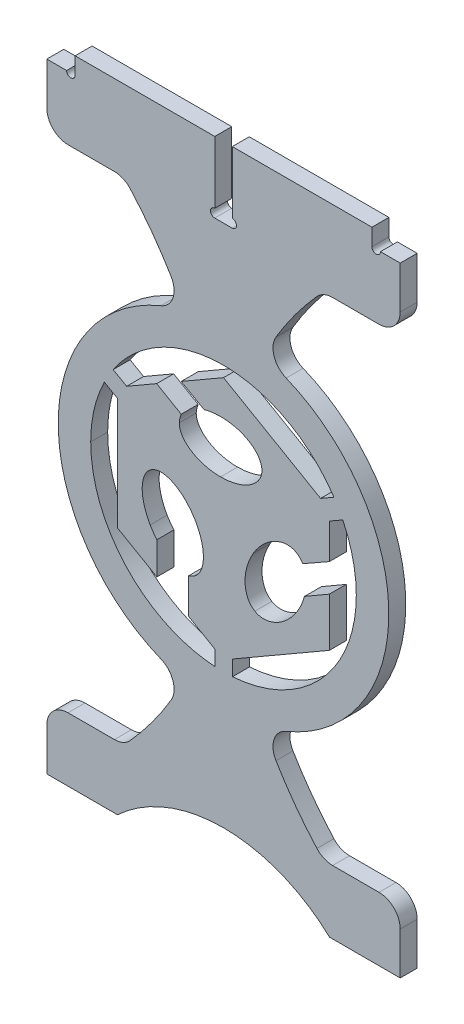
ISO-10303-21;
HEADER;
FILE_DESCRIPTION(('STEP AP214'),'2;1');
FILE_NAME('part.step','',(''),(''),'','','');
FILE_SCHEMA(('AUTOMOTIVE_DESIGN { 1 0 10303 214 1 1 1 1 }'));
ENDSEC;
DATA;
#1=APPLICATION_CONTEXT('core data for automotive mechanical design processes');
#2=APPLICATION_PROTOCOL_DEFINITION('international standard','automotive_design',2000,#1);
#3=PRODUCT_CONTEXT('',#1,'mechanical');
#4=PRODUCT('Part','Part','',(#3));
#5=PRODUCT_RELATED_PRODUCT_CATEGORY('part','',(#4));
#6=PRODUCT_DEFINITION_FORMATION('','',#4);
#7=PRODUCT_DEFINITION_CONTEXT('part definition',#1,'design');
#8=PRODUCT_DEFINITION('design','',#6,#7);
#9=PRODUCT_DEFINITION_SHAPE('','',#8);
#10=(LENGTH_UNIT() NAMED_UNIT(*) SI_UNIT(.MILLI.,.METRE.));
#11=(NAMED_UNIT(*) PLANE_ANGLE_UNIT() SI_UNIT($,.RADIAN.));
#12=(NAMED_UNIT(*) SI_UNIT($,.STERADIAN.) SOLID_ANGLE_UNIT());
#13=UNCERTAINTY_MEASURE_WITH_UNIT(LENGTH_MEASURE(1.E-05),#10,'distance_accuracy_value','');
#14=(GEOMETRIC_REPRESENTATION_CONTEXT(3) GLOBAL_UNCERTAINTY_ASSIGNED_CONTEXT((#13)) GLOBAL_UNIT_ASSIGNED_CONTEXT((#10,
#11,#12)) REPRESENTATION_CONTEXT('',''));
#15=CARTESIAN_POINT('',(0.,0.,0.));
#16=DIRECTION('',(0.,0.,1.));
#17=DIRECTION('',(1.,0.,0.));
#18=AXIS2_PLACEMENT_3D('',#15,#16,#17);
#19=CARTESIAN_POINT('',(0.,-299.467384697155,12.));
#20=DIRECTION('',(0.,0.,1.));
#21=DIRECTION('',(1.,0.,0.));
#22=AXIS2_PLACEMENT_3D('',#19,#20,#21);
#23=PLANE('',#22);
#24=CARTESIAN_POINT('',(56.203317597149,0.450356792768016,12.));
#25=CARTESIAN_POINT('',(56.0000669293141,0.687582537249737,12.));
#26=CARTESIAN_POINT('',(55.5921589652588,1.16362986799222,12.));
#27=CARTESIAN_POINT('',(55.0893071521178,1.75070982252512,12.));
#28=CARTESIAN_POINT('',(54.724387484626,2.17632758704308,12.));
#29=CARTESIAN_POINT('',(54.5359064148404,2.39679699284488,12.));
#30=CARTESIAN_POINT('',(54.2924498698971,2.6727493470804,12.));
#31=CARTESIAN_POINT('',(53.7208657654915,3.27589380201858,12.));
#32=CARTESIAN_POINT('',(52.790785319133,4.09099143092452,12.));
#33=CARTESIAN_POINT('',(51.9642146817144,4.64863053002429,12.));
#34=CARTESIAN_POINT('',(51.535453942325,4.89808295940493,12.));
#35=B_SPLINE_CURVE_WITH_KNOTS('',3,(#24,#25,#26,#27,#28,#29,#30,#31,#32,#33,#34),.UNSPECIFIED.,
.F.,.F.,(4,1,1,1,1,1,1,1,4),(-0.491558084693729,-0.305145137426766,-0.118732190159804,
-0.0255257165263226,0.021077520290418,0.0676807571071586,0.254093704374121,0.626919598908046,
0.99974549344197),.UNSPECIFIED.);
#36=CARTESIAN_POINT('',(56.203317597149,0.450356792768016,12.));
#37=VERTEX_POINT('',#36);
#38=CARTESIAN_POINT('',(51.5354539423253,4.89808295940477,12.));
#39=VERTEX_POINT('',#38);
#40=EDGE_CURVE('E987',#37,#39,#35,.T.);
#41=ORIENTED_EDGE('',*,*,#40,.F.);
#42=DIRECTION('',(-0.869932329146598,-0.493171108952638,0.));
#43=VECTOR('',#42,1.);
#44=CARTESIAN_POINT('',(74.8558467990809,11.0246143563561,12.));
#45=LINE('',#44,#43);
#46=CARTESIAN_POINT('',(74.8558467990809,11.0246143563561,12.));
#47=VERTEX_POINT('',#46);
#48=EDGE_CURVE('E1004',#47,#37,#45,.T.);
#49=ORIENTED_EDGE('',*,*,#48,.F.);
#50=DIRECTION('',(0.,-1.,0.));
#51=VECTOR('',#50,1.);
#52=CARTESIAN_POINT('',(74.8558467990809,35.8564945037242,12.));
#53=LINE('',#52,#51);
#54=CARTESIAN_POINT('',(74.8558467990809,35.8564945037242,12.));
#55=VERTEX_POINT('',#54);
#56=EDGE_CURVE('E2265',#55,#47,#53,.T.);
#57=ORIENTED_EDGE('',*,*,#56,.F.);
#58=DIRECTION('',(-0.866017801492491,-0.500013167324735,0.));
#59=VECTOR('',#58,1.);
#60=CARTESIAN_POINT('',(84.350873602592,41.3386432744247,12.));
#61=LINE('',#60,#59);
#62=CARTESIAN_POINT('',(84.350873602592,41.3386432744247,12.));
#63=VERTEX_POINT('',#62);
#64=EDGE_CURVE('E2259',#63,#55,#61,.T.);
#65=ORIENTED_EDGE('',*,*,#64,.F.);
#66=CARTESIAN_POINT('',(93.936438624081,-0.0178653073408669,12.));
#67=CARTESIAN_POINT('',(93.936438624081,1.82624899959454,12.));
#68=CARTESIAN_POINT('',(93.8283634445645,5.53230343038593,12.));
#69=CARTESIAN_POINT('',(93.1922160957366,12.7831592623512,12.));
#70=CARTESIAN_POINT('',(91.6340835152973,21.6239998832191,12.));
#71=CARTESIAN_POINT('',(88.6109963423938,31.7910275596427,12.));
#72=CARTESIAN_POINT('',(85.8891877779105,38.2068793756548,12.));
#73=CARTESIAN_POINT('',(84.350873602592,41.3386432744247,12.));
#74=B_SPLINE_CURVE_WITH_KNOTS('',3,(#66,#67,#68,#69,#70,#71,#72,#73),.UNSPECIFIED.,.F.,.F.,(4,1,
1,1,1,4),(0.,0.116327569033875,0.232655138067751,0.465310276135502,0.697965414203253,
0.930620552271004),.UNSPECIFIED.);
#75=CARTESIAN_POINT('',(93.936438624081,-0.0178653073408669,12.));
#76=VERTEX_POINT('',#75);
#77=EDGE_CURVE('E2251',#76,#63,#74,.T.);
#78=ORIENTED_EDGE('',*,*,#77,.F.);
#79=CARTESIAN_POINT('',(6.38340309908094,-93.7186285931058,12.));
#80=CARTESIAN_POINT('',(7.90438854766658,-93.6165835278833,12.));
#81=CARTESIAN_POINT('',(10.952047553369,-93.3376856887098,12.));
#82=CARTESIAN_POINT('',(16.9319774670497,-92.4965020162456,12.));
#83=CARTESIAN_POINT('',(24.2388654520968,-90.9226726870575,12.));
#84=CARTESIAN_POINT('',(32.6794130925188,-88.2410320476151,12.));
#85=CARTESIAN_POINT('',(43.4491220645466,-83.6626051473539,12.));
#86=CARTESIAN_POINT('',(55.8971748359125,-76.1621788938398,12.));
#87=CARTESIAN_POINT('',(68.878610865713,-64.649268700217,12.));
#88=CARTESIAN_POINT('',(79.5665477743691,-50.9590634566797,12.));
#89=CARTESIAN_POINT('',(86.2832556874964,-38.0167411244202,12.));
#90=CARTESIAN_POINT('',(90.177266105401,-26.9080362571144,12.));
#91=CARTESIAN_POINT('',(92.3168967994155,-18.2411531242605,12.));
#92=CARTESIAN_POINT('',(93.4146956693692,-10.767683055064,12.));
#93=CARTESIAN_POINT('',(93.8608879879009,-4.66914223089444,12.));
#94=CARTESIAN_POINT('',(93.936438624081,-1.5640973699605,12.));
#95=CARTESIAN_POINT('',(93.936438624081,-0.0178653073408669,12.));
#96=B_SPLINE_CURVE_WITH_KNOTS('',3,(#79,#80,#81,#82,#83,#84,#85,#86,#87,#88,#89,#90,#91,#92,#93,
#94,#95),.UNSPECIFIED.,.F.,.F.,(4,1,1,1,1,1,1,1,1,1,1,1,1,1,4),(0.0206187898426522,
0.0512244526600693,0.0818301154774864,0.143041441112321,0.204252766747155,0.265464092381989,
0.387886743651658,0.510309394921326,0.632732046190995,0.755154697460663,0.816366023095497,
0.877577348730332,0.938788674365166,0.969394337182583,1.),.UNSPECIFIED.);
#97=CARTESIAN_POINT('',(6.38340309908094,-93.7186285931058,12.));
#98=VERTEX_POINT('',#97);
#99=EDGE_CURVE('E2246',#98,#76,#96,.T.);
#100=ORIENTED_EDGE('',*,*,#99,.F.);
#101=DIRECTION('',(0.,-1.,0.));
#102=VECTOR('',#101,1.);
#103=CARTESIAN_POINT('',(6.38340309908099,-82.8804784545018,12.));
#104=LINE('',#103,#102);
#105=CARTESIAN_POINT('',(6.38340309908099,-82.8804784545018,12.));
#106=VERTEX_POINT('',#105);
#107=EDGE_CURVE('E2243',#106,#98,#104,.T.);
#108=ORIENTED_EDGE('',*,*,#107,.F.);
#109=DIRECTION('',(-0.866045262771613,-0.499965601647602,0.));
#110=VECTOR('',#109,1.);
#111=CARTESIAN_POINT('',(74.8558467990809,-43.3515208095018,12.));
#112=LINE('',#111,#110);
#113=CARTESIAN_POINT('',(74.8558467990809,-43.3515208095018,12.));
#114=VERTEX_POINT('',#113);
#115=EDGE_CURVE('E2240',#114,#106,#112,.T.);
#116=ORIENTED_EDGE('',*,*,#115,.F.);
#117=DIRECTION('',(0.,-1.,0.));
#118=VECTOR('',#117,1.);
#119=CARTESIAN_POINT('',(74.8558467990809,-8.89103093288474,12.));
#120=LINE('',#119,#118);
#121=CARTESIAN_POINT('',(74.8558467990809,-8.89103093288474,12.));
#122=VERTEX_POINT('',#121);
#123=EDGE_CURVE('E2237',#122,#114,#120,.T.);
#124=ORIENTED_EDGE('',*,*,#123,.F.);
#125=DIRECTION('',(0.865487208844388,0.500931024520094,0.));
#126=VECTOR('',#125,1.);
#127=CARTESIAN_POINT('',(57.2918754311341,-19.0567943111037,12.));
#128=LINE('',#127,#126);
#129=CARTESIAN_POINT('',(57.2918754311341,-19.0567943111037,12.));
#130=VERTEX_POINT('',#129);
#131=EDGE_CURVE('E2231',#130,#122,#128,.T.);
#132=ORIENTED_EDGE('',*,*,#131,.F.);
#133=CARTESIAN_POINT('',(52.8362860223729,-29.6652356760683,12.));
#134=CARTESIAN_POINT('',(53.3352077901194,-28.807205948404,12.));
#135=CARTESIAN_POINT('',(54.2861961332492,-27.0406133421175,12.));
#136=CARTESIAN_POINT('',(55.4863061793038,-24.4097753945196,12.));
#137=CARTESIAN_POINT('',(56.3250942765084,-22.1906036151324,12.));
#138=CARTESIAN_POINT('',(56.8116344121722,-20.6817940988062,12.));
#139=CARTESIAN_POINT('',(57.0813329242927,-19.7656117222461,12.));
#140=CARTESIAN_POINT('',(57.2221957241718,-19.2917528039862,12.));
#141=CARTESIAN_POINT('',(57.2918754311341,-19.0567943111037,12.));
#142=B_SPLINE_CURVE_WITH_KNOTS('',3,(#133,#134,#135,#136,#137,#138,#139,#140,#141),
.UNSPECIFIED.,.F.,.F.,(4,1,1,1,1,1,4),(-6.11231757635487E-05,0.278209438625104,
0.556480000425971,0.834750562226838,0.973885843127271,1.04345348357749,1.1130211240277),.UNSPECIFIED.);
#143=CARTESIAN_POINT('',(52.8362860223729,-29.6652356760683,12.));
#144=VERTEX_POINT('',#143);
#145=EDGE_CURVE('E2223',#144,#130,#142,.T.);
#146=ORIENTED_EDGE('',*,*,#145,.F.);
#147=CARTESIAN_POINT('',(22.1661070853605,-45.6591868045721,12.));
#148=CARTESIAN_POINT('',(24.2036014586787,-46.8410411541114,12.));
#149=CARTESIAN_POINT('',(27.651179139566,-47.6302041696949,12.));
#150=CARTESIAN_POINT('',(32.9907645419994,-46.7926936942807,12.));
#151=CARTESIAN_POINT('',(37.2109650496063,-45.1834647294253,12.));
#152=CARTESIAN_POINT('',(41.4804697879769,-42.6214460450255,12.));
#153=CARTESIAN_POINT('',(45.6278613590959,-39.1579960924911,12.));
#154=CARTESIAN_POINT('',(48.8531097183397,-35.5678940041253,12.));
#155=CARTESIAN_POINT('',(51.2109514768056,-32.3229688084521,12.));
#156=CARTESIAN_POINT('',(52.3182377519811,-30.557123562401,12.));
#157=CARTESIAN_POINT('',(52.8362860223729,-29.6652356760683,12.));
#158=B_SPLINE_CURVE_WITH_KNOTS('',3,(#147,#148,#149,#150,#151,#152,#153,#154,#155,#156,#157),
.UNSPECIFIED.,.F.,.F.,(4,1,1,1,1,1,1,1,4),(5.44512921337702E-05,0.250044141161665,
0.375038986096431,0.500033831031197,0.625028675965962,0.750023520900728,0.875018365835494,
0.937515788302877,1.00001321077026),.UNSPECIFIED.);
#159=CARTESIAN_POINT('',(22.1661070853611,-45.6591868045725,12.));
#160=VERTEX_POINT('',#159);
#161=EDGE_CURVE('E2215',#160,#144,#158,.T.);
#162=ORIENTED_EDGE('',*,*,#161,.F.);
#163=CARTESIAN_POINT('',(20.8646114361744,-11.0891517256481,12.));
#164=CARTESIAN_POINT('',(20.3465638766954,-11.9814364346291,12.));
#165=CARTESIAN_POINT('',(19.3613179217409,-13.8189710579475,12.));
#166=CARTESIAN_POINT('',(17.7107934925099,-17.4760890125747,12.));
#167=CARTESIAN_POINT('',(16.1901247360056,-22.0574979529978,12.));
#168=CARTESIAN_POINT('',(15.2362332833,-27.3767107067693,12.));
#169=CARTESIAN_POINT('',(15.1258092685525,-32.3548739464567,12.));
#170=CARTESIAN_POINT('',(15.8185907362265,-36.8178516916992,12.));
#171=CARTESIAN_POINT('',(17.7361404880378,-41.8705886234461,12.));
#172=CARTESIAN_POINT('',(20.130026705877,-44.4746339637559,12.));
#173=CARTESIAN_POINT('',(22.1661070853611,-45.6591868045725,12.));
#174=B_SPLINE_CURVE_WITH_KNOTS('',3,(#163,#164,#165,#166,#167,#168,#169,#170,#171,#172,#173),
.UNSPECIFIED.,.F.,.F.,(4,1,1,1,1,1,1,1,4),(1.08903554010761E-05,0.0625068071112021,
0.125002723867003,0.249994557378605,0.374986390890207,0.499978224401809,0.624970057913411,
0.749961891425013,0.999945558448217),.UNSPECIFIED.);
#175=CARTESIAN_POINT('',(20.8646114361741,-11.0891517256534,12.));
#176=VERTEX_POINT('',#175);
#177=EDGE_CURVE('E2207',#176,#160,#174,.T.);
#178=ORIENTED_EDGE('',*,*,#177,.F.);
#179=CARTESIAN_POINT('',(51.5354539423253,4.89808295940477,12.));
#180=CARTESIAN_POINT('',(49.4982856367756,6.08096303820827,12.));
#181=CARTESIAN_POINT('',(46.0500805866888,6.87155778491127,12.));
#182=CARTESIAN_POINT('',(40.7107752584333,6.0345988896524,12.));
#183=CARTESIAN_POINT('',(36.4904719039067,4.42558748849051,12.));
#184=CARTESIAN_POINT('',(32.220828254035,1.86370759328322,12.));
#185=CARTESIAN_POINT('',(28.0732619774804,-1.59938179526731,12.));
#186=CARTESIAN_POINT('',(24.8478992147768,-5.18869063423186,12.));
#187=CARTESIAN_POINT('',(22.4899608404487,-8.43260893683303,12.));
#188=CARTESIAN_POINT('',(21.3826776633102,-10.1976313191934,12.));
#189=CARTESIAN_POINT('',(20.8646114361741,-11.0891517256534,12.));
#190=B_SPLINE_CURVE_WITH_KNOTS('',3,(#179,#180,#181,#182,#183,#184,#185,#186,#187,#188,#189),
.UNSPECIFIED.,.F.,.F.,(4,1,1,1,1,1,1,1,4),(3.61411756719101E-05,0.250024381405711,
0.37501850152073,0.50001262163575,0.62500674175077,0.750000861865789,0.874994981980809,
0.937492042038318,0.999989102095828),.UNSPECIFIED.);
#191=EDGE_CURVE('E2199',#39,#176,#190,.T.);
#192=ORIENTED_EDGE('',*,*,#191,.F.);
#193=EDGE_LOOP('',(#41,#49,#57,#65,#78,#100,#108,#116,#124,#132,#146,#162,#178,#192));
#194=FACE_BOUND('',#193,.T.);
#195=DIRECTION('',(-0.866070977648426,0.499921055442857,0.));
#196=VECTOR('',#195,1.);
#197=CARTESIAN_POINT('',(-47.139069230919,-59.3585238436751,12.));
#198=LINE('',#197,#196);
#199=CARTESIAN_POINT('',(-47.139069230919,-59.3585238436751,12.));
#200=VERTEX_POINT('',#199);
#201=CARTESIAN_POINT('',(-74.869670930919,-43.3516236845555,12.));
#202=VERTEX_POINT('',#201);
#203=EDGE_CURVE('E1053',#200,#202,#198,.T.);
#204=ORIENTED_EDGE('',*,*,#203,.F.);
#205=DIRECTION('',(0.,-1.,0.));
#206=VECTOR('',#205,1.);
#207=CARTESIAN_POINT('',(-47.139069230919,-36.5488970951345,12.));
#208=LINE('',#207,#206);
#209=CARTESIAN_POINT('',(-47.139069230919,-36.5488970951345,12.));
#210=VERTEX_POINT('',#209);
#211=EDGE_CURVE('E1124',#210,#200,#208,.T.);
#212=ORIENTED_EDGE('',*,*,#211,.F.);
#213=CARTESIAN_POINT('',(-51.881335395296,-29.8545658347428,12.));
#214=CARTESIAN_POINT('',(-51.5302130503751,-30.4570313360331,12.));
#215=CARTESIAN_POINT('',(-50.7949802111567,-31.6544761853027,12.));
#216=CARTESIAN_POINT('',(-49.645108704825,-33.34904440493,12.));
#217=CARTESIAN_POINT('',(-48.6303050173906,-34.710178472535,12.));
#218=CARTESIAN_POINT('',(-47.8208358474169,-35.7182852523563,12.));
#219=CARTESIAN_POINT('',(-47.3617996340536,-36.2765435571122,12.));
#220=CARTESIAN_POINT('',(-47.139069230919,-36.5488970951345,12.));
#221=B_SPLINE_CURVE_WITH_KNOTS('',3,(#213,#214,#215,#216,#217,#218,#219,#220),.UNSPECIFIED.,.F.,
.F.,(4,1,1,1,1,4),(0.000325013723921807,0.28652780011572,0.572730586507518,0.858933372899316,
1.00203476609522,1.14513615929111),.UNSPECIFIED.);
#222=CARTESIAN_POINT('',(-51.881335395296,-29.8545658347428,12.));
#223=VERTEX_POINT('',#222);
#224=EDGE_CURVE('E1116',#223,#210,#221,.T.);
#225=ORIENTED_EDGE('',*,*,#224,.F.);
#226=CARTESIAN_POINT('',(-50.5799393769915,4.70843137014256,12.));
#227=CARTESIAN_POINT('',(-52.6159299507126,3.52740990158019,12.));
#228=CARTESIAN_POINT('',(-55.0103091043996,0.92741782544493,12.));
#229=CARTESIAN_POINT('',(-56.9280463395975,-4.12285245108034,12.));
#230=CARTESIAN_POINT('',(-57.6209206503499,-8.58550099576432,12.));
#231=CARTESIAN_POINT('',(-57.5103304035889,-13.5642898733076,12.));
#232=CARTESIAN_POINT('',(-56.5561261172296,-18.8846020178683,12.));
#233=CARTESIAN_POINT('',(-55.0352146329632,-23.4669112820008,12.));
#234=CARTESIAN_POINT('',(-53.3845863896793,-27.1245669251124,12.));
#235=CARTESIAN_POINT('',(-52.3993784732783,-28.9622073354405,12.));
#236=CARTESIAN_POINT('',(-51.881335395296,-29.8545658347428,12.));
#237=B_SPLINE_CURVE_WITH_KNOTS('',3,(#226,#227,#228,#229,#230,#231,#232,#233,#234,#235,#236),
.UNSPECIFIED.,.F.,.F.,(4,1,1,1,1,1,1,1,4),(-1.98188032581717E-05,0.249973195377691,
0.374969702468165,0.499966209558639,0.624962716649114,0.749959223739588,0.874955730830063,
0.9374539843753,0.999952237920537),.UNSPECIFIED.);
#238=CARTESIAN_POINT('',(-50.5799393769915,4.70843137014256,12.));
#239=VERTEX_POINT('',#238);
#240=EDGE_CURVE('E1108',#239,#223,#237,.T.);
#241=ORIENTED_EDGE('',*,*,#240,.F.);
#242=CARTESIAN_POINT('',(-19.9074742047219,-11.2778610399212,12.));
#243=CARTESIAN_POINT('',(-20.4255607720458,-10.3863056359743,12.));
#244=CARTESIAN_POINT('',(-21.5329059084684,-8.62122244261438,12.));
#245=CARTESIAN_POINT('',(-23.8910206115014,-5.37724800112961,12.));
#246=CARTESIAN_POINT('',(-27.1166922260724,-1.78795868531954,12.));
#247=CARTESIAN_POINT('',(-31.2647009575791,1.67500379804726,12.));
#248=CARTESIAN_POINT('',(-35.534798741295,4.23669496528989,12.));
#249=CARTESIAN_POINT('',(-39.7554779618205,5.84548562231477,12.));
#250=CARTESIAN_POINT('',(-45.0951595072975,6.68214702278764,12.));
#251=CARTESIAN_POINT('',(-48.5429134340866,5.8913340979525,12.));
#252=CARTESIAN_POINT('',(-50.5799393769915,4.70843137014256,12.));
#253=B_SPLINE_CURVE_WITH_KNOTS('',3,(#242,#243,#244,#245,#246,#247,#248,#249,#250,#251,#252),
.UNSPECIFIED.,.F.,.F.,(4,1,1,1,1,1,1,1,4),(1.08977365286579E-05,0.0625114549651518,
0.125012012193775,0.250013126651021,0.375014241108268,0.500015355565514,0.62501647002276,
0.750017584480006,1.0000198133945),.UNSPECIFIED.);
#254=CARTESIAN_POINT('',(-19.9074742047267,-11.277861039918,12.));
#255=VERTEX_POINT('',#254);
#256=EDGE_CURVE('E1100',#255,#239,#253,.T.);
#257=ORIENTED_EDGE('',*,*,#256,.F.);
#258=CARTESIAN_POINT('',(-21.2288889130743,-45.8508922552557,12.));
#259=CARTESIAN_POINT('',(-19.1903301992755,-44.6654965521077,12.));
#260=CARTESIAN_POINT('',(-16.7868181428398,-42.0627060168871,12.));
#261=CARTESIAN_POINT('',(-14.8660613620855,-37.0113380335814,12.));
#262=CARTESIAN_POINT('',(-14.1704121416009,-32.5488176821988,12.));
#263=CARTESIAN_POINT('',(-14.2790253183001,-27.5703978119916,12.));
#264=CARTESIAN_POINT('',(-15.2318996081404,-22.2502144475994,12.));
#265=CARTESIAN_POINT('',(-16.7525412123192,-17.6674195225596,12.));
#266=CARTESIAN_POINT('',(-18.4035203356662,-14.0089205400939,12.));
#267=CARTESIAN_POINT('',(-19.3892015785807,-12.1705333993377,12.));
#268=CARTESIAN_POINT('',(-19.9074742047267,-11.277861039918,12.));
#269=B_SPLINE_CURVE_WITH_KNOTS('',3,(#258,#259,#260,#261,#262,#263,#264,#265,#266,#267,#268),
.UNSPECIFIED.,.F.,.F.,(4,1,1,1,1,1,1,1,4),(-0.000401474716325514,0.24969617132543,
0.374744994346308,0.499793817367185,0.624842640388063,0.749891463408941,0.874940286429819,
0.937464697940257,0.999989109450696),.UNSPECIFIED.);
#270=CARTESIAN_POINT('',(-21.2288889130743,-45.8508922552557,12.));
#271=VERTEX_POINT('',#270);
#272=EDGE_CURVE('E1092',#271,#255,#269,.T.);
#273=ORIENTED_EDGE('',*,*,#272,.F.);
#274=CARTESIAN_POINT('',(-24.648805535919,-47.3849023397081,12.));
#275=CARTESIAN_POINT('',(-24.3266921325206,-47.251075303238,12.));
#276=CARTESIAN_POINT('',(-23.6907937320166,-46.9856119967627,12.));
#277=CARTESIAN_POINT('',(-22.6869756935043,-46.5742724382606,12.));
#278=CARTESIAN_POINT('',(-21.9175923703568,-46.2327645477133,12.));
#279=CARTESIAN_POINT('',(-21.4572100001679,-45.9865867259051,12.));
#280=CARTESIAN_POINT('',(-21.2288889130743,-45.8508922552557,12.));
#281=B_SPLINE_CURVE_WITH_KNOTS('',3,(#274,#275,#276,#277,#278,#279,#280),.UNSPECIFIED.,.F.,.F.,
(4,1,1,1,4),(-0.923007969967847,-0.440614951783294,0.0417780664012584,0.524171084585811,
1.00656410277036),.UNSPECIFIED.);
#282=CARTESIAN_POINT('',(-24.648805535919,-47.3849023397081,12.));
#283=VERTEX_POINT('',#282);
#284=EDGE_CURVE('E1087',#283,#271,#281,.T.);
#285=ORIENTED_EDGE('',*,*,#284,.F.);
#286=DIRECTION('',(0.,1.,0.));
#287=VECTOR('',#286,1.);
#288=CARTESIAN_POINT('',(-24.648805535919,-72.3404932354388,12.));
#289=LINE('',#288,#287);
#290=CARTESIAN_POINT('',(-24.648805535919,-72.3404932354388,12.));
#291=VERTEX_POINT('',#290);
#292=EDGE_CURVE('E1084',#291,#283,#289,.T.);
#293=ORIENTED_EDGE('',*,*,#292,.F.);
#294=DIRECTION('',(-0.866125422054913,0.499826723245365,0.));
#295=VECTOR('',#294,1.);
#296=CARTESIAN_POINT('',(-6.06819753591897,-83.0630562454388,12.));
#297=LINE('',#296,#295);
#298=CARTESIAN_POINT('',(-6.06819753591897,-83.0630562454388,12.));
#299=VERTEX_POINT('',#298);
#300=EDGE_CURVE('E1081',#299,#291,#297,.T.);
#301=ORIENTED_EDGE('',*,*,#300,.F.);
#302=DIRECTION('',(0.,1.,0.));
#303=VECTOR('',#302,1.);
#304=CARTESIAN_POINT('',(-6.06819753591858,-93.7416304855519,12.));
#305=LINE('',#304,#303);
#306=CARTESIAN_POINT('',(-6.06819753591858,-93.7416304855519,12.));
#307=VERTEX_POINT('',#306);
#308=EDGE_CURVE('E1075',#307,#299,#305,.T.);
#309=ORIENTED_EDGE('',*,*,#308,.F.);
#310=CARTESIAN_POINT('',(-93.950268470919,-0.0178653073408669,12.));
#311=CARTESIAN_POINT('',(-93.950268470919,-1.56764543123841,12.));
#312=CARTESIAN_POINT('',(-93.874378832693,-4.67986445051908,12.));
#313=CARTESIAN_POINT('',(-93.4262013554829,-10.7920568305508,12.));
#314=CARTESIAN_POINT('',(-92.3235607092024,-18.2816713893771,12.));
#315=CARTESIAN_POINT('',(-90.1746272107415,-26.966111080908,12.));
#316=CARTESIAN_POINT('',(-86.2639277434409,-38.0955724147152,12.));
#317=CARTESIAN_POINT('',(-79.5190140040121,-51.0583076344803,12.));
#318=CARTESIAN_POINT('',(-68.7876933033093,-64.7623845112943,12.));
#319=CARTESIAN_POINT('',(-55.7555725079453,-76.276729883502,12.));
#320=CARTESIAN_POINT('',(-43.261064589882,-83.7664936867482,12.));
#321=CARTESIAN_POINT('',(-32.4527439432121,-88.3283821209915,12.));
#322=CARTESIAN_POINT('',(-23.9827922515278,-90.9933915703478,12.));
#323=CARTESIAN_POINT('',(-16.6511922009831,-92.5496355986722,12.));
#324=CARTESIAN_POINT('',(-10.6516140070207,-93.374419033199,12.));
#325=CARTESIAN_POINT('',(-7.5939891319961,-93.6442785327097,12.));
#326=CARTESIAN_POINT('',(-6.06819753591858,-93.7416304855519,12.));
#327=B_SPLINE_CURVE_WITH_KNOTS('',3,(#310,#311,#312,#313,#314,#315,#316,#317,#318,#319,#320,
#321,#322,#323,#324,#325,#326),.UNSPECIFIED.,.F.,.F.,(4,1,1,1,1,1,1,1,1,1,1,1,1,1,4),(0.,
0.0306095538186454,0.0612191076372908,0.122438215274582,0.183657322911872,0.244876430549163,
0.367314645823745,0.489752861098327,0.612191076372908,0.73462929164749,0.795848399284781,
0.857067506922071,0.918286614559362,0.948896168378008,0.979505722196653),.UNSPECIFIED.);
#328=CARTESIAN_POINT('',(-93.950268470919,-0.0178653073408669,12.));
#329=VERTEX_POINT('',#328);
#330=EDGE_CURVE('E1067',#329,#307,#327,.T.);
#331=ORIENTED_EDGE('',*,*,#330,.F.);
#332=CARTESIAN_POINT('',(-84.3062411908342,41.4623289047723,12.));
#333=CARTESIAN_POINT('',(-85.8545011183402,38.323343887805,12.));
#334=CARTESIAN_POINT('',(-88.5935467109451,31.8910579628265,12.));
#335=CARTESIAN_POINT('',(-91.6348224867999,21.6947099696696,12.));
#336=CARTESIAN_POINT('',(-93.2019106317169,12.8259447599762,12.));
#337=CARTESIAN_POINT('',(-93.8416072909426,5.5511850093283,12.));
#338=CARTESIAN_POINT('',(-93.950268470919,1.83249152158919,12.));
#339=CARTESIAN_POINT('',(-93.950268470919,-0.0178653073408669,12.));
#340=B_SPLINE_CURVE_WITH_KNOTS('',3,(#332,#333,#334,#335,#336,#337,#338,#339),.UNSPECIFIED.,.F.,
.F.,(4,1,1,1,1,4),(0.0690651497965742,0.301798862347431,0.534532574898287,0.767266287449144,
0.883633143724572,1.),.UNSPECIFIED.);
#341=CARTESIAN_POINT('',(-84.3062411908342,41.4623289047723,12.));
#342=VERTEX_POINT('',#341);
#343=EDGE_CURVE('E1062',#342,#329,#340,.T.);
#344=ORIENTED_EDGE('',*,*,#343,.F.);
#345=DIRECTION('',(-0.866039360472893,0.499975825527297,0.));
#346=VECTOR('',#345,1.);
#347=CARTESIAN_POINT('',(-74.869670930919,36.014473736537,12.));
#348=LINE('',#347,#346);
#349=CARTESIAN_POINT('',(-74.869670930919,36.014473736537,12.));
#350=VERTEX_POINT('',#349);
#351=EDGE_CURVE('E1059',#350,#342,#348,.T.);
#352=ORIENTED_EDGE('',*,*,#351,.F.);
#353=DIRECTION('',(0.,1.,0.));
#354=VECTOR('',#353,1.);
#355=CARTESIAN_POINT('',(-74.869670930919,-43.3516236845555,12.));
#356=LINE('',#355,#354);
#357=EDGE_CURVE('E1055',#202,#350,#356,.T.);
#358=ORIENTED_EDGE('',*,*,#357,.F.);
#359=EDGE_LOOP('',(#204,#212,#225,#241,#257,#273,#285,#293,#301,#309,#331,#344,#352,#358));
#360=FACE_BOUND('',#359,.T.);
#361=CARTESIAN_POINT('',(78.1296920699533,52.1235262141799,12.));
#362=CARTESIAN_POINT('',(76.0286620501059,55.2659864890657,12.));
#363=CARTESIAN_POINT('',(71.4388659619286,61.3083165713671,12.));
#364=CARTESIAN_POINT('',(63.5494638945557,69.4522329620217,12.));
#365=CARTESIAN_POINT('',(54.7321959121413,76.607645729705,12.));
#366=CARTESIAN_POINT('',(45.0863150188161,82.6732143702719,12.));
#367=CARTESIAN_POINT('',(34.7037851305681,87.5571274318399,12.));
#368=CARTESIAN_POINT('',(23.6804992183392,91.1657932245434,12.));
#369=CARTESIAN_POINT('',(14.0276919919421,93.0329415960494,12.));
#370=CARTESIAN_POINT('',(6.0890758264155,93.7956961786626,12.));
#371=CARTESIAN_POINT('',(2.02228158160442,93.9254910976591,12.));
#372=CARTESIAN_POINT('',(-0.000459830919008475,93.9254910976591,12.));
#373=B_SPLINE_CURVE_WITH_KNOTS('',3,(#361,#362,#363,#364,#365,#366,#367,#368,#369,#370,#371,
#372),.UNSPECIFIED.,.F.,.F.,(4,1,1,1,1,1,1,1,1,4),(0.0329456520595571,0.153827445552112,
0.274709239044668,0.395591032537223,0.516472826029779,0.637354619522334,0.758236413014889,
0.879118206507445,0.939559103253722,1.),.UNSPECIFIED.);
#374=CARTESIAN_POINT('',(78.1296920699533,52.1235262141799,12.));
#375=VERTEX_POINT('',#374);
#376=CARTESIAN_POINT('',(-0.000459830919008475,93.9254910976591,12.));
#377=VERTEX_POINT('',#376);
#378=EDGE_CURVE('E1133',#375,#377,#373,.T.);
#379=ORIENTED_EDGE('',*,*,#378,.F.);
#380=CARTESIAN_POINT('',(68.6730355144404,46.6609725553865,12.));
#381=CARTESIAN_POINT('',(69.518098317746,47.1491684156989,12.));
#382=CARTESIAN_POINT('',(71.2339309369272,48.1402350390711,12.));
#383=CARTESIAN_POINT('',(73.6539765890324,49.537852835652,12.));
#384=CARTESIAN_POINT('',(75.5811253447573,50.6509245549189,12.));
#385=CARTESIAN_POINT('',(77.062590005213,51.5068213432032,12.));
#386=CARTESIAN_POINT('',(77.7713410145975,51.9164017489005,12.));
#387=CARTESIAN_POINT('',(78.1296920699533,52.1235262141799,12.));
#388=B_SPLINE_CURVE_WITH_KNOTS('',3,(#380,#381,#382,#383,#384,#385,#386,#387),.UNSPECIFIED.,.F.,
.F.,(4,1,1,1,1,4),(0.0969424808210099,0.265789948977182,0.434637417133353,0.603484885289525,
0.68790861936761,0.772332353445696),.UNSPECIFIED.);
#389=CARTESIAN_POINT('',(68.6730355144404,46.6609725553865,12.));
#390=VERTEX_POINT('',#389);
#391=EDGE_CURVE('E699',#390,#375,#388,.T.);
#392=ORIENTED_EDGE('',*,*,#391,.F.);
#393=DIRECTION('',(0.866029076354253,-0.499993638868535,0.));
#394=VECTOR('',#393,1.);
#395=CARTESIAN_POINT('',(-6.25616661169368E-05,86.3087316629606,12.));
#396=LINE('',#395,#394);
#397=CARTESIAN_POINT('',(-6.25616661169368E-05,86.3087316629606,12.));
#398=VERTEX_POINT('',#397);
#399=EDGE_CURVE('E1308',#398,#390,#396,.T.);
#400=ORIENTED_EDGE('',*,*,#399,.F.);
#401=DIRECTION('',(0.866143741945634,0.499794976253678,0.));
#402=VECTOR('',#401,1.);
#403=CARTESIAN_POINT('',(-29.9166704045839,69.045811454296,12.));
#404=LINE('',#403,#402);
#405=CARTESIAN_POINT('',(-29.9166704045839,69.045811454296,12.));
#406=VERTEX_POINT('',#405);
#407=EDGE_CURVE('E1301',#406,#398,#404,.T.);
#408=ORIENTED_EDGE('',*,*,#407,.F.);
#409=DIRECTION('',(-0.869446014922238,0.494027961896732,0.));
#410=VECTOR('',#409,1.);
#411=CARTESIAN_POINT('',(-13.7963987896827,59.8861111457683,12.));
#412=LINE('',#411,#410);
#413=CARTESIAN_POINT('',(-13.7963987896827,59.8861111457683,12.));
#414=VERTEX_POINT('',#413);
#415=EDGE_CURVE('E1309',#414,#406,#412,.T.);
#416=ORIENTED_EDGE('',*,*,#415,.F.);
#417=CARTESIAN_POINT('',(-2.06658663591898,61.4416882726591,12.));
#418=CARTESIAN_POINT('',(-3.08801201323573,61.4416882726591,12.));
#419=CARTESIAN_POINT('',(-5.15168069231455,61.3721169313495,12.));
#420=CARTESIAN_POINT('',(-8.1120468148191,61.0719653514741,12.));
#421=CARTESIAN_POINT('',(-10.5160601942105,60.6619622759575,12.));
#422=CARTESIAN_POINT('',(-12.1105707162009,60.3069706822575,12.));
#423=CARTESIAN_POINT('',(-13.0586310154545,60.0693190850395,12.));
#424=CARTESIAN_POINT('',(-13.5520957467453,59.9468792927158,12.));
#425=CARTESIAN_POINT('',(-13.7963987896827,59.8861111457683,12.));
#426=B_SPLINE_CURVE_WITH_KNOTS('',3,(#417,#418,#419,#420,#421,#422,#423,#424,#425),
.UNSPECIFIED.,.F.,.F.,(4,1,1,1,1,1,4),(0.,0.277541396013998,0.555082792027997,0.832624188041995,
0.971394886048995,1.04078023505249,1.11016558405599),.UNSPECIFIED.);
#427=CARTESIAN_POINT('',(-2.06658663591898,61.4416882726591,12.));
#428=VERTEX_POINT('',#427);
#429=EDGE_CURVE('E1316',#428,#414,#426,.T.);
#430=ORIENTED_EDGE('',*,*,#429,.F.);
#431=CARTESIAN_POINT('',(27.165607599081,42.9578602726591,12.));
#432=CARTESIAN_POINT('',(27.165607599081,45.3130793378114,12.));
#433=CARTESIAN_POINT('',(26.1178218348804,48.6915972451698,12.));
#434=CARTESIAN_POINT('',(22.7127952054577,52.886795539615,12.));
#435=CARTESIAN_POINT('',(19.201770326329,55.7269867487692,12.));
#436=CARTESIAN_POINT('',(14.8416187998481,58.1311568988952,12.));
#437=CARTESIAN_POINT('',(9.76306846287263,59.9770668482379,12.));
#438=CARTESIAN_POINT('',(5.03830467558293,60.9622952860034,12.));
#439=CARTESIAN_POINT('',(1.04787972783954,61.3711230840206,12.));
#440=CARTESIAN_POINT('',(-1.03516770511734,61.4416882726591,12.));
#441=CARTESIAN_POINT('',(-2.06658663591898,61.4416882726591,12.));
#442=B_SPLINE_CURVE_WITH_KNOTS('',3,(#431,#432,#433,#434,#435,#436,#437,#438,#439,#440,#441),
.UNSPECIFIED.,.F.,.F.,(4,1,1,1,1,1,1,1,4),(0.,0.25,0.375,0.5,0.625,0.75,0.875,0.9375,1.),.UNSPECIFIED.);
#443=CARTESIAN_POINT('',(27.165607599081,42.9578602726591,12.));
#444=VERTEX_POINT('',#443);
#445=EDGE_CURVE('E1321',#444,#428,#442,.T.);
#446=ORIENTED_EDGE('',*,*,#445,.F.);
#447=CARTESIAN_POINT('',(-2.06658663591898,24.4724149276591,12.));
#448=CARTESIAN_POINT('',(-1.03520921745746,24.4724149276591,12.));
#449=CARTESIAN_POINT('',(1.04774774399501,24.5430243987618,12.));
#450=CARTESIAN_POINT('',(5.03803388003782,24.9520881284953,12.));
#451=CARTESIAN_POINT('',(9.76268160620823,25.9378348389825,12.));
#452=CARTESIAN_POINT('',(14.841210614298,27.7845503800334,12.));
#453=CARTESIAN_POINT('',(19.2014576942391,30.1895708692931,12.));
#454=CARTESIAN_POINT('',(22.7126605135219,33.0304211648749,12.));
#455=CARTESIAN_POINT('',(26.1179408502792,37.2263859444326,12.));
#456=CARTESIAN_POINT('',(27.165607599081,40.6032235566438,12.));
#457=CARTESIAN_POINT('',(27.165607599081,42.9578602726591,12.));
#458=B_SPLINE_CURVE_WITH_KNOTS('',3,(#447,#448,#449,#450,#451,#452,#453,#454,#455,#456,#457),
.UNSPECIFIED.,.F.,.F.,(4,1,1,1,1,1,1,1,4),(0.,0.0625,0.125,0.25,0.375,0.5,0.625,0.75,1.),.UNSPECIFIED.);
#459=CARTESIAN_POINT('',(-2.06658663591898,24.4724149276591,12.));
#460=VERTEX_POINT('',#459);
#461=EDGE_CURVE('E1329',#460,#444,#458,.T.);
#462=ORIENTED_EDGE('',*,*,#461,.F.);
#463=CARTESIAN_POINT('',(-31.3003925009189,42.9578602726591,12.));
#464=CARTESIAN_POINT('',(-31.3003925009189,40.6031930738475,12.));
#465=CARTESIAN_POINT('',(-30.2529982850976,37.2260325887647,12.));
#466=CARTESIAN_POINT('',(-26.8484856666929,33.0302762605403,12.));
#467=CARTESIAN_POINT('',(-23.337824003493,30.1895231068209,12.));
#468=CARTESIAN_POINT('',(-18.9778339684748,27.7845674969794,12.));
#469=CARTESIAN_POINT('',(-13.8990464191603,25.9378648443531,12.));
#470=CARTESIAN_POINT('',(-9.17353830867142,24.9521039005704,12.));
#471=CARTESIAN_POINT('',(-5.18212799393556,24.5430276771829,12.));
#472=CARTESIAN_POINT('',(-3.09834414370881,24.4724149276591,12.));
#473=CARTESIAN_POINT('',(-2.06658663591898,24.4724149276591,12.));
#474=B_SPLINE_CURVE_WITH_KNOTS('',3,(#463,#464,#465,#466,#467,#468,#469,#470,#471,#472,#473),
.UNSPECIFIED.,.F.,.F.,(4,1,1,1,1,1,1,1,4),(0.,0.25,0.375,0.5,0.625,0.75,0.875,0.9375,1.),.UNSPECIFIED.);
#475=CARTESIAN_POINT('',(-31.3003925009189,42.9578602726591,12.));
#476=VERTEX_POINT('',#475);
#477=EDGE_CURVE('E1337',#476,#460,#474,.T.);
#478=ORIENTED_EDGE('',*,*,#477,.F.);
#479=CARTESIAN_POINT('',(-29.9326256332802,48.9631520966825,12.));
#480=CARTESIAN_POINT('',(-30.0258635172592,48.6800762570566,12.));
#481=CARTESIAN_POINT('',(-30.2120398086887,48.1147057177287,12.));
#482=CARTESIAN_POINT('',(-30.4462575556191,47.4040868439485,12.));
#483=CARTESIAN_POINT('',(-30.6074585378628,46.9138303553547,12.));
#484=CARTESIAN_POINT('',(-30.7038409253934,46.622552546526,12.));
#485=CARTESIAN_POINT('',(-30.8077711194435,46.2982208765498,12.));
#486=CARTESIAN_POINT('',(-31.0250110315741,45.5280832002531,12.));
#487=CARTESIAN_POINT('',(-31.239330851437,44.3846447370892,12.));
#488=CARTESIAN_POINT('',(-31.3003925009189,43.431150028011,12.));
#489=CARTESIAN_POINT('',(-31.3003925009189,42.9578602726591,12.));
#490=B_SPLINE_CURVE_WITH_KNOTS('',3,(#479,#480,#481,#482,#483,#484,#485,#486,#487,#488,#489),
.UNSPECIFIED.,.F.,.F.,(4,1,1,1,1,1,1,1,4),(-0.516261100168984,-0.326728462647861,
-0.137195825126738,-0.0424295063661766,0.00495365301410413,0.0523368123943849,0.241869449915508,
0.620934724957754,1.),.UNSPECIFIED.);
#491=CARTESIAN_POINT('',(-29.9326256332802,48.9631520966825,12.));
#492=VERTEX_POINT('',#491);
#493=EDGE_CURVE('E1345',#492,#476,#490,.T.);
#494=ORIENTED_EDGE('',*,*,#493,.F.);
#495=DIRECTION('',(0.865233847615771,-0.501368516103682,0.));
#496=VECTOR('',#495,1.);
#497=CARTESIAN_POINT('',(-47.2828925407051,59.0169399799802,12.));
#498=LINE('',#497,#496);
#499=CARTESIAN_POINT('',(-47.2828925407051,59.0169399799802,12.));
#500=VERTEX_POINT('',#499);
#501=EDGE_CURVE('E1353',#500,#492,#498,.T.);
#502=ORIENTED_EDGE('',*,*,#501,.F.);
#503=DIRECTION('',(0.866088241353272,0.499891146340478,0.));
#504=VECTOR('',#503,1.);
#505=CARTESIAN_POINT('',(-68.5485864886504,46.7427494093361,12.));
#506=LINE('',#505,#504);
#507=CARTESIAN_POINT('',(-68.5485864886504,46.7427494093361,12.));
#508=VERTEX_POINT('',#507);
#509=EDGE_CURVE('E1359',#508,#500,#506,.T.);
#510=ORIENTED_EDGE('',*,*,#509,.F.);
#511=CARTESIAN_POINT('',(-78.0651727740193,52.2359778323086,12.));
#512=CARTESIAN_POINT('',(-77.6993558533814,52.024619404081,12.));
#513=CARTESIAN_POINT('',(-76.9745899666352,51.6059724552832,12.));
#514=CARTESIAN_POINT('',(-75.4696166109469,50.7369812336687,12.));
#515=CARTESIAN_POINT('',(-73.5234337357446,49.613702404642,12.));
#516=CARTESIAN_POINT('',(-71.0957014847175,48.212786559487,12.));
#517=CARTESIAN_POINT('',(-69.3903575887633,47.2286279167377,12.));
#518=CARTESIAN_POINT('',(-68.5485864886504,46.7427494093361,12.));
#519=B_SPLINE_CURVE_WITH_KNOTS('',3,(#511,#512,#513,#514,#515,#516,#517,#518),.UNSPECIFIED.,.F.,
.F.,(4,1,1,1,1,4),(0.222315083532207,0.307236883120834,0.392158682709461,0.562002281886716,
0.731845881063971,0.901689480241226),.UNSPECIFIED.);
#520=CARTESIAN_POINT('',(-78.0651727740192,52.2359778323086,12.));
#521=VERTEX_POINT('',#520);
#522=EDGE_CURVE('E1362',#521,#508,#519,.T.);
#523=ORIENTED_EDGE('',*,*,#522,.F.);
#524=CARTESIAN_POINT('',(-0.000459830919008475,93.9254910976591,12.));
#525=CARTESIAN_POINT('',(-2.02040930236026,93.9254910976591,12.));
#526=CARTESIAN_POINT('',(-6.08154518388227,93.7960763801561,12.));
#527=CARTESIAN_POINT('',(-14.0095493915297,93.0355349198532,12.));
#528=CARTESIAN_POINT('',(-23.6500705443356,91.1737514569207,12.));
#529=CARTESIAN_POINT('',(-34.6606326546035,87.5752894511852,12.));
#530=CARTESIAN_POINT('',(-45.0327479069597,82.7049647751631,12.));
#531=CARTESIAN_POINT('',(-54.6708771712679,76.65597571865,12.));
#532=CARTESIAN_POINT('',(-63.4833785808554,69.5197834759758,12.));
#533=CARTESIAN_POINT('',(-71.3714221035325,61.3972047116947,12.));
#534=CARTESIAN_POINT('',(-75.9626271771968,55.3705871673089,12.));
#535=CARTESIAN_POINT('',(-78.0651727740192,52.2359778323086,12.));
#536=B_SPLINE_CURVE_WITH_KNOTS('',3,(#524,#525,#526,#527,#528,#529,#530,#531,#532,#533,#534,
#535),.UNSPECIFIED.,.F.,.F.,(4,1,1,1,1,1,1,1,1,4),(0.,0.0604347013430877,0.120869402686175,
0.241738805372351,0.362608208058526,0.483477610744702,0.604347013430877,0.725216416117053,
0.846085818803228,0.966955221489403),.UNSPECIFIED.);
#537=EDGE_CURVE('E1366',#377,#521,#536,.T.);
#538=ORIENTED_EDGE('',*,*,#537,.F.);
#539=EDGE_LOOP('',(#379,#392,#400,#408,#416,#430,#446,#462,#478,#494,#502,#510,#523,#538));
#540=FACE_BOUND('',#539,.T.);
#541=CARTESIAN_POINT('',(0.,0.,12.));
#542=DIRECTION('',(0.,0.,-1.));
#543=DIRECTION('',(1.,0.,0.));
#544=AXIS2_PLACEMENT_3D('',#541,#542,#543);
#545=CIRCLE('',#544,116.933185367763);
#546=CARTESIAN_POINT('',(-44.3006316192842,-108.216560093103,12.));
#547=VERTEX_POINT('',#546);
#548=CARTESIAN_POINT('',(-44.3006316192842,108.216560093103,12.));
#549=VERTEX_POINT('',#548);
#550=EDGE_CURVE('E750',#547,#549,#545,.T.);
#551=ORIENTED_EDGE('',*,*,#550,.F.);
#552=CARTESIAN_POINT('',(-49.9834450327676,-122.098405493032,12.));
#553=DIRECTION('',(0.,0.,-1.));
#554=DIRECTION('',(1.,0.,0.));
#555=AXIS2_PLACEMENT_3D('',#552,#553,#554);
#556=CIRCLE('',#555,15.);
#557=CARTESIAN_POINT('',(-37.1066758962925,-129.791832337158,12.));
#558=VERTEX_POINT('',#557);
#559=EDGE_CURVE('E567',#547,#558,#556,.T.);
#560=ORIENTED_EDGE('',*,*,#559,.T.);
#561=CARTESIAN_POINT('',(-254.344,0.,12.));
#562=DIRECTION('',(0.,0.,-1.));
#563=DIRECTION('',(1.,0.,0.));
#564=AXIS2_PLACEMENT_3D('',#561,#562,#563);
#565=CIRCLE('',#564,253.057255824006);
#566=CARTESIAN_POINT('',(-66.0670231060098,-169.085051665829,12.));
#567=VERTEX_POINT('',#566);
#568=EDGE_CURVE('E821',#558,#567,#565,.T.);
#569=ORIENTED_EDGE('',*,*,#568,.T.);
#570=CARTESIAN_POINT('',(-77.1707041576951,-159.,12.));
#571=DIRECTION('',(0.,0.,-1.));
#572=DIRECTION('',(1.,0.,0.));
#573=AXIS2_PLACEMENT_3D('',#570,#571,#572);
#574=CIRCLE('',#573,15.);
#575=CARTESIAN_POINT('',(-77.1707041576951,-174.,12.));
#576=VERTEX_POINT('',#575);
#577=EDGE_CURVE('E815',#567,#576,#574,.T.);
#578=ORIENTED_EDGE('',*,*,#577,.T.);
#579=DIRECTION('',(-1.,0.,0.));
#580=VECTOR('',#579,1.);
#581=CARTESIAN_POINT('',(-110.,-174.,12.));
#582=LINE('',#581,#580);
#583=CARTESIAN_POINT('',(-110.,-174.,12.));
#584=VERTEX_POINT('',#583);
#585=EDGE_CURVE('E813',#576,#584,#582,.T.);
#586=ORIENTED_EDGE('',*,*,#585,.T.);
#587=CARTESIAN_POINT('',(-110.,-189.,12.));
#588=DIRECTION('',(0.,0.,1.));
#589=DIRECTION('',(1.,0.,0.));
#590=AXIS2_PLACEMENT_3D('',#587,#588,#589);
#591=CIRCLE('',#590,15.);
#592=CARTESIAN_POINT('',(-125.,-189.,12.));
#593=VERTEX_POINT('',#592);
#594=EDGE_CURVE('E810',#584,#593,#591,.T.);
#595=ORIENTED_EDGE('',*,*,#594,.T.);
#596=DIRECTION('',(0.,-1.,0.));
#597=VECTOR('',#596,1.);
#598=CARTESIAN_POINT('',(-125.,219.,12.));
#599=LINE('',#598,#597);
#600=CARTESIAN_POINT('',(-125.,-219.,12.));
#601=VERTEX_POINT('',#600);
#602=EDGE_CURVE('E575',#593,#601,#599,.T.);
#603=ORIENTED_EDGE('',*,*,#602,.T.);
#604=DIRECTION('',(1.,0.,0.));
#605=VECTOR('',#604,1.);
#606=CARTESIAN_POINT('',(-125.,-219.,12.));
#607=LINE('',#606,#605);
#608=CARTESIAN_POINT('',(-74.9999999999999,-219.,12.));
#609=VERTEX_POINT('',#608);
#610=EDGE_CURVE('E597',#601,#609,#607,.T.);
#611=ORIENTED_EDGE('',*,*,#610,.T.);
#612=CARTESIAN_POINT('',(0.,-299.467384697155,12.));
#613=DIRECTION('',(0.,0.,-1.));
#614=DIRECTION('',(1.,0.,0.));
#615=AXIS2_PLACEMENT_3D('',#612,#613,#614);
#616=CIRCLE('',#615,110.);
#617=CARTESIAN_POINT('',(75.0000000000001,-219.,12.));
#618=VERTEX_POINT('',#617);
#619=EDGE_CURVE('E592',#609,#618,#616,.T.);
#620=ORIENTED_EDGE('',*,*,#619,.T.);
#621=DIRECTION('',(1.,0.,0.));
#622=VECTOR('',#621,1.);
#623=CARTESIAN_POINT('',(75.0000000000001,-219.,12.));
#624=LINE('',#623,#622);
#625=CARTESIAN_POINT('',(125.,-219.,12.));
#626=VERTEX_POINT('',#625);
#627=EDGE_CURVE('E731',#618,#626,#624,.T.);
#628=ORIENTED_EDGE('',*,*,#627,.T.);
#629=DIRECTION('',(0.,1.,0.));
#630=VECTOR('',#629,1.);
#631=CARTESIAN_POINT('',(125.,219.,12.));
#632=LINE('',#631,#630);
#633=CARTESIAN_POINT('',(125.,-189.,12.));
#634=VERTEX_POINT('',#633);
#635=EDGE_CURVE('E632',#626,#634,#632,.T.);
#636=ORIENTED_EDGE('',*,*,#635,.T.);
#637=CARTESIAN_POINT('',(110.,-189.,12.));
#638=DIRECTION('',(0.,0.,-1.));
#639=DIRECTION('',(-1.,0.,0.));
#640=AXIS2_PLACEMENT_3D('',#637,#638,#639);
#641=CIRCLE('',#640,15.);
#642=CARTESIAN_POINT('',(110.,-174.,12.));
#643=VERTEX_POINT('',#642);
#644=EDGE_CURVE('E840',#643,#634,#641,.T.);
#645=ORIENTED_EDGE('',*,*,#644,.F.);
#646=DIRECTION('',(1.,0.,0.));
#647=VECTOR('',#646,1.);
#648=CARTESIAN_POINT('',(110.,-174.,12.));
#649=LINE('',#648,#647);
#650=CARTESIAN_POINT('',(77.1707041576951,-174.,12.));
#651=VERTEX_POINT('',#650);
#652=EDGE_CURVE('E858',#651,#643,#649,.T.);
#653=ORIENTED_EDGE('',*,*,#652,.F.);
#654=CARTESIAN_POINT('',(77.1707041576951,-159.,12.));
#655=DIRECTION('',(0.,0.,1.));
#656=DIRECTION('',(-1.,0.,0.));
#657=AXIS2_PLACEMENT_3D('',#654,#655,#656);
#658=CIRCLE('',#657,15.);
#659=CARTESIAN_POINT('',(66.0670231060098,-169.085051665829,12.));
#660=VERTEX_POINT('',#659);
#661=EDGE_CURVE('E855',#660,#651,#658,.T.);
#662=ORIENTED_EDGE('',*,*,#661,.F.);
#663=CARTESIAN_POINT('',(254.344,0.,12.));
#664=DIRECTION('',(0.,0.,1.));
#665=DIRECTION('',(-1.,0.,0.));
#666=AXIS2_PLACEMENT_3D('',#663,#664,#665);
#667=CIRCLE('',#666,253.057255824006);
#668=CARTESIAN_POINT('',(37.1066758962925,-129.791832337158,12.));
#669=VERTEX_POINT('',#668);
#670=EDGE_CURVE('E852',#669,#660,#667,.T.);
#671=ORIENTED_EDGE('',*,*,#670,.F.);
#672=CARTESIAN_POINT('',(49.9834450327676,-122.098405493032,12.));
#673=DIRECTION('',(0.,0.,1.));
#674=DIRECTION('',(-1.,0.,0.));
#675=AXIS2_PLACEMENT_3D('',#672,#673,#674);
#676=CIRCLE('',#675,15.);
#677=CARTESIAN_POINT('',(44.3006316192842,-108.216560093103,12.));
#678=VERTEX_POINT('',#677);
#679=EDGE_CURVE('E828',#678,#669,#676,.T.);
#680=ORIENTED_EDGE('',*,*,#679,.F.);
#681=CARTESIAN_POINT('',(0.,0.,12.));
#682=DIRECTION('',(0.,0.,1.));
#683=DIRECTION('',(-1.,0.,0.));
#684=AXIS2_PLACEMENT_3D('',#681,#682,#683);
#685=CIRCLE('',#684,116.933185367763);
#686=CARTESIAN_POINT('',(44.3006316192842,108.216560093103,12.));
#687=VERTEX_POINT('',#686);
#688=EDGE_CURVE('E905',#678,#687,#685,.T.);
#689=ORIENTED_EDGE('',*,*,#688,.T.);
#690=CARTESIAN_POINT('',(49.9834450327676,122.098405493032,12.));
#691=DIRECTION('',(0.,0.,-1.));
#692=DIRECTION('',(-1.,0.,0.));
#693=AXIS2_PLACEMENT_3D('',#690,#691,#692);
#694=CIRCLE('',#693,15.);
#695=CARTESIAN_POINT('',(37.1066758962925,129.791832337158,12.));
#696=VERTEX_POINT('',#695);
#697=EDGE_CURVE('E918',#687,#696,#694,.T.);
#698=ORIENTED_EDGE('',*,*,#697,.T.);
#699=CARTESIAN_POINT('',(254.344,0.,12.));
#700=DIRECTION('',(0.,0.,-1.));
#701=DIRECTION('',(-1.,0.,0.));
#702=AXIS2_PLACEMENT_3D('',#699,#700,#701);
#703=CIRCLE('',#702,253.057255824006);
#704=CARTESIAN_POINT('',(66.0670231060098,169.085051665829,12.));
#705=VERTEX_POINT('',#704);
#706=EDGE_CURVE('E940',#696,#705,#703,.T.);
#707=ORIENTED_EDGE('',*,*,#706,.T.);
#708=CARTESIAN_POINT('',(77.1707041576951,159.,12.));
#709=DIRECTION('',(0.,0.,-1.));
#710=DIRECTION('',(-1.,0.,0.));
#711=AXIS2_PLACEMENT_3D('',#708,#709,#710);
#712=CIRCLE('',#711,15.);
#713=CARTESIAN_POINT('',(77.1707041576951,174.,12.));
#714=VERTEX_POINT('',#713);
#715=EDGE_CURVE('E937',#705,#714,#712,.T.);
#716=ORIENTED_EDGE('',*,*,#715,.T.);
#717=DIRECTION('',(1.,0.,0.));
#718=VECTOR('',#717,1.);
#719=CARTESIAN_POINT('',(110.,174.,12.));
#720=LINE('',#719,#718);
#721=CARTESIAN_POINT('',(110.,174.,12.));
#722=VERTEX_POINT('',#721);
#723=EDGE_CURVE('E934',#714,#722,#720,.T.);
#724=ORIENTED_EDGE('',*,*,#723,.T.);
#725=CARTESIAN_POINT('',(110.,189.,12.));
#726=DIRECTION('',(0.,0.,1.));
#727=DIRECTION('',(-1.,0.,0.));
#728=AXIS2_PLACEMENT_3D('',#725,#726,#727);
#729=CIRCLE('',#728,15.);
#730=CARTESIAN_POINT('',(125.,189.,12.));
#731=VERTEX_POINT('',#730);
#732=EDGE_CURVE('E931',#722,#731,#729,.T.);
#733=ORIENTED_EDGE('',*,*,#732,.T.);
#734=CARTESIAN_POINT('',(125.,219.,12.));
#735=VERTEX_POINT('',#734);
#736=EDGE_CURVE('E733',#731,#735,#632,.T.);
#737=ORIENTED_EDGE('',*,*,#736,.T.);
#738=DIRECTION('',(-1.,0.,0.));
#739=VECTOR('',#738,1.);
#740=CARTESIAN_POINT('',(125.,219.,12.));
#741=LINE('',#740,#739);
#742=CARTESIAN_POINT('',(111.,219.,12.));
#743=VERTEX_POINT('',#742);
#744=EDGE_CURVE('E735',#735,#743,#741,.T.);
#745=ORIENTED_EDGE('',*,*,#744,.T.);
#746=CARTESIAN_POINT('',(108.,219.,12.));
#747=DIRECTION('',(0.,0.,-1.));
#748=DIRECTION('',(1.,0.,0.));
#749=AXIS2_PLACEMENT_3D('',#746,#747,#748);
#750=CIRCLE('',#749,3.00000000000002);
#751=CARTESIAN_POINT('',(105.,219.,12.));
#752=VERTEX_POINT('',#751);
#753=EDGE_CURVE('E737',#743,#752,#750,.T.);
#754=ORIENTED_EDGE('',*,*,#753,.T.);
#755=DIRECTION('',(0.,1.,0.));
#756=VECTOR('',#755,1.);
#757=CARTESIAN_POINT('',(105.,231.,12.));
#758=LINE('',#757,#756);
#759=CARTESIAN_POINT('',(105.,231.,12.));
#760=VERTEX_POINT('',#759);
#761=EDGE_CURVE('E739',#752,#760,#758,.T.);
#762=ORIENTED_EDGE('',*,*,#761,.T.);
#763=DIRECTION('',(-1.,0.,0.));
#764=VECTOR('',#763,1.);
#765=CARTESIAN_POINT('',(-105.,231.,12.));
#766=LINE('',#765,#764);
#767=CARTESIAN_POINT('',(6.20000000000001,231.,12.));
#768=VERTEX_POINT('',#767);
#769=EDGE_CURVE('E742',#760,#768,#766,.T.);
#770=ORIENTED_EDGE('',*,*,#769,.T.);
#771=DIRECTION('',(0.,1.,0.));
#772=VECTOR('',#771,1.);
#773=CARTESIAN_POINT('',(6.20000000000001,231.,12.));
#774=LINE('',#773,#772);
#775=CARTESIAN_POINT('',(6.2,187.,12.));
#776=VERTEX_POINT('',#775);
#777=EDGE_CURVE('E50',#776,#768,#774,.T.);
#778=ORIENTED_EDGE('',*,*,#777,.F.);
#779=CARTESIAN_POINT('',(6.2,184.,12.));
#780=DIRECTION('',(0.,0.,1.));
#781=DIRECTION('',(1.,0.,0.));
#782=AXIS2_PLACEMENT_3D('',#779,#780,#781);
#783=CIRCLE('',#782,3.);
#784=CARTESIAN_POINT('',(6.2,181.,12.));
#785=VERTEX_POINT('',#784);
#786=EDGE_CURVE('E899',#785,#776,#783,.T.);
#787=ORIENTED_EDGE('',*,*,#786,.F.);
#788=DIRECTION('',(1.,0.,0.));
#789=VECTOR('',#788,1.);
#790=CARTESIAN_POINT('',(-6.19999999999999,181.,12.));
#791=LINE('',#790,#789);
#792=CARTESIAN_POINT('',(-6.19999999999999,181.,12.));
#793=VERTEX_POINT('',#792);
#794=EDGE_CURVE('E896',#793,#785,#791,.T.);
#795=ORIENTED_EDGE('',*,*,#794,.F.);
#796=CARTESIAN_POINT('',(-6.19999999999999,184.,12.));
#797=DIRECTION('',(0.,0.,1.));
#798=DIRECTION('',(1.,0.,0.));
#799=AXIS2_PLACEMENT_3D('',#796,#797,#798);
#800=CIRCLE('',#799,3.);
#801=CARTESIAN_POINT('',(-6.19999999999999,187.,12.));
#802=VERTEX_POINT('',#801);
#803=EDGE_CURVE('E893',#802,#793,#800,.T.);
#804=ORIENTED_EDGE('',*,*,#803,.F.);
#805=DIRECTION('',(0.,-1.,0.));
#806=VECTOR('',#805,1.);
#807=CARTESIAN_POINT('',(-6.20000000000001,231.,12.));
#808=LINE('',#807,#806);
#809=CARTESIAN_POINT('',(-6.20000000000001,231.,12.));
#810=VERTEX_POINT('',#809);
#811=EDGE_CURVE('E864',#810,#802,#808,.T.);
#812=ORIENTED_EDGE('',*,*,#811,.F.);
#813=CARTESIAN_POINT('',(-105.,231.,12.));
#814=VERTEX_POINT('',#813);
#815=EDGE_CURVE('E741',#810,#814,#766,.T.);
#816=ORIENTED_EDGE('',*,*,#815,.T.);
#817=DIRECTION('',(0.,-1.,0.));
#818=VECTOR('',#817,1.);
#819=CARTESIAN_POINT('',(-105.,231.,12.));
#820=LINE('',#819,#818);
#821=CARTESIAN_POINT('',(-105.,219.,12.));
#822=VERTEX_POINT('',#821);
#823=EDGE_CURVE('E745',#814,#822,#820,.T.);
#824=ORIENTED_EDGE('',*,*,#823,.T.);
#825=CARTESIAN_POINT('',(-108.,219.,12.));
#826=DIRECTION('',(0.,0.,-1.));
#827=DIRECTION('',(1.,0.,0.));
#828=AXIS2_PLACEMENT_3D('',#825,#826,#827);
#829=CIRCLE('',#828,3.00000000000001);
#830=CARTESIAN_POINT('',(-111.,219.,12.));
#831=VERTEX_POINT('',#830);
#832=EDGE_CURVE('E746',#822,#831,#829,.T.);
#833=ORIENTED_EDGE('',*,*,#832,.T.);
#834=DIRECTION('',(-1.,0.,0.));
#835=VECTOR('',#834,1.);
#836=CARTESIAN_POINT('',(-125.,219.,12.));
#837=LINE('',#836,#835);
#838=CARTESIAN_POINT('',(-125.,219.,12.));
#839=VERTEX_POINT('',#838);
#840=EDGE_CURVE('E667',#831,#839,#837,.T.);
#841=ORIENTED_EDGE('',*,*,#840,.T.);
#842=CARTESIAN_POINT('',(-125.,189.,12.));
#843=VERTEX_POINT('',#842);
#844=EDGE_CURVE('E679',#839,#843,#599,.T.);
#845=ORIENTED_EDGE('',*,*,#844,.T.);
#846=CARTESIAN_POINT('',(-110.,189.,12.));
#847=DIRECTION('',(0.,0.,-1.));
#848=DIRECTION('',(1.,0.,0.));
#849=AXIS2_PLACEMENT_3D('',#846,#847,#848);
#850=CIRCLE('',#849,15.);
#851=CARTESIAN_POINT('',(-110.,174.,12.));
#852=VERTEX_POINT('',#851);
#853=EDGE_CURVE('E961',#852,#843,#850,.T.);
#854=ORIENTED_EDGE('',*,*,#853,.F.);
#855=DIRECTION('',(-1.,0.,0.));
#856=VECTOR('',#855,1.);
#857=CARTESIAN_POINT('',(-110.,174.,12.));
#858=LINE('',#857,#856);
#859=CARTESIAN_POINT('',(-77.1707041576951,174.,12.));
#860=VERTEX_POINT('',#859);
#861=EDGE_CURVE('E982',#860,#852,#858,.T.);
#862=ORIENTED_EDGE('',*,*,#861,.F.);
#863=CARTESIAN_POINT('',(-77.1707041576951,159.,12.));
#864=DIRECTION('',(0.,0.,1.));
#865=DIRECTION('',(1.,0.,0.));
#866=AXIS2_PLACEMENT_3D('',#863,#864,#865);
#867=CIRCLE('',#866,15.);
#868=CARTESIAN_POINT('',(-66.0670231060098,169.085051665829,12.));
#869=VERTEX_POINT('',#868);
#870=EDGE_CURVE('E979',#869,#860,#867,.T.);
#871=ORIENTED_EDGE('',*,*,#870,.F.);
#872=CARTESIAN_POINT('',(-254.344,0.,12.));
#873=DIRECTION('',(0.,0.,1.));
#874=DIRECTION('',(1.,0.,0.));
#875=AXIS2_PLACEMENT_3D('',#872,#873,#874);
#876=CIRCLE('',#875,253.057255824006);
#877=CARTESIAN_POINT('',(-37.1066758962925,129.791832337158,12.));
#878=VERTEX_POINT('',#877);
#879=EDGE_CURVE('E976',#878,#869,#876,.T.);
#880=ORIENTED_EDGE('',*,*,#879,.F.);
#881=CARTESIAN_POINT('',(-49.9834450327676,122.098405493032,12.));
#882=DIRECTION('',(0.,0.,1.));
#883=DIRECTION('',(1.,0.,0.));
#884=AXIS2_PLACEMENT_3D('',#881,#882,#883);
#885=CIRCLE('',#884,15.);
#886=EDGE_CURVE('E973',#549,#878,#885,.T.);
#887=ORIENTED_EDGE('',*,*,#886,.F.);
#888=EDGE_LOOP('',(#551,#560,#569,#578,#586,#595,#603,#611,#620,#628,#636,#645,#653,#662,#671,
#680,#689,#698,#707,#716,#724,#733,#737,#745,#754,#762,#770,#778,#787,#795,#804,#812,#816,#824,
#833,#841,#845,#854,#862,#871,#880,#887));
#889=FACE_BOUND('',#888,.T.);
#890=ADVANCED_FACE('F35',(#194,#360,#540,#889),#23,.T.);
#891=CARTESIAN_POINT('',(0.,-299.467384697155,0.));
#892=DIRECTION('',(0.,0.,1.));
#893=DIRECTION('',(1.,0.,0.));
#894=AXIS2_PLACEMENT_3D('',#891,#892,#893);
#895=PLANE('',#894);
#896=DIRECTION('',(-0.869932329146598,-0.493171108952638,0.));
#897=VECTOR('',#896,1.);
#898=CARTESIAN_POINT('',(74.8558467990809,11.0246143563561,0.));
#899=LINE('',#898,#897);
#900=CARTESIAN_POINT('',(74.8558467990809,11.0246143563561,0.));
#901=VERTEX_POINT('',#900);
#902=CARTESIAN_POINT('',(56.203317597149,0.450356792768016,0.));
#903=VERTEX_POINT('',#902);
#904=EDGE_CURVE('E2192',#901,#903,#899,.T.);
#905=ORIENTED_EDGE('',*,*,#904,.T.);
#906=CARTESIAN_POINT('',(56.203317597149,0.450356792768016,0.));
#907=CARTESIAN_POINT('',(56.0000669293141,0.687582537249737,0.));
#908=CARTESIAN_POINT('',(55.5921589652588,1.16362986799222,0.));
#909=CARTESIAN_POINT('',(55.0893071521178,1.75070982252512,0.));
#910=CARTESIAN_POINT('',(54.724387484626,2.17632758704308,0.));
#911=CARTESIAN_POINT('',(54.5359064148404,2.39679699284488,0.));
#912=CARTESIAN_POINT('',(54.2924498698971,2.6727493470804,0.));
#913=CARTESIAN_POINT('',(53.7208657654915,3.27589380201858,0.));
#914=CARTESIAN_POINT('',(52.790785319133,4.09099143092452,0.));
#915=CARTESIAN_POINT('',(51.9642146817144,4.64863053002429,0.));
#916=CARTESIAN_POINT('',(51.535453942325,4.89808295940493,0.));
#917=B_SPLINE_CURVE_WITH_KNOTS('',3,(#906,#907,#908,#909,#910,#911,#912,#913,#914,#915,#916),
.UNSPECIFIED.,.F.,.F.,(4,1,1,1,1,1,1,1,4),(-0.491558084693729,-0.305145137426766,
-0.118732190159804,-0.0255257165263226,0.021077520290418,0.0676807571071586,0.254093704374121,
0.626919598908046,0.99974549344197),.UNSPECIFIED.);
#918=CARTESIAN_POINT('',(51.5354539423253,4.89808295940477,0.));
#919=VERTEX_POINT('',#918);
#920=EDGE_CURVE('E997',#903,#919,#917,.T.);
#921=ORIENTED_EDGE('',*,*,#920,.T.);
#922=CARTESIAN_POINT('',(51.5354539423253,4.89808295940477,0.));
#923=CARTESIAN_POINT('',(49.4982856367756,6.08096303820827,0.));
#924=CARTESIAN_POINT('',(46.0500805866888,6.87155778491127,0.));
#925=CARTESIAN_POINT('',(40.7107752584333,6.0345988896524,0.));
#926=CARTESIAN_POINT('',(36.4904719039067,4.42558748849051,0.));
#927=CARTESIAN_POINT('',(32.220828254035,1.86370759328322,0.));
#928=CARTESIAN_POINT('',(28.0732619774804,-1.59938179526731,0.));
#929=CARTESIAN_POINT('',(24.8478992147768,-5.18869063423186,0.));
#930=CARTESIAN_POINT('',(22.4899608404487,-8.43260893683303,0.));
#931=CARTESIAN_POINT('',(21.3826776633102,-10.1976313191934,0.));
#932=CARTESIAN_POINT('',(20.8646114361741,-11.0891517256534,0.));
#933=B_SPLINE_CURVE_WITH_KNOTS('',3,(#922,#923,#924,#925,#926,#927,#928,#929,#930,#931,#932),
.UNSPECIFIED.,.F.,.F.,(4,1,1,1,1,1,1,1,4),(3.61411756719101E-05,0.250024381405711,
0.37501850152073,0.50001262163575,0.62500674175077,0.750000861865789,0.874994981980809,
0.937492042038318,0.999989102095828),.UNSPECIFIED.);
#934=CARTESIAN_POINT('',(20.8646114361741,-11.0891517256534,0.));
#935=VERTEX_POINT('',#934);
#936=EDGE_CURVE('E1003',#919,#935,#933,.T.);
#937=ORIENTED_EDGE('',*,*,#936,.T.);
#938=CARTESIAN_POINT('',(20.8646114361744,-11.0891517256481,0.));
#939=CARTESIAN_POINT('',(20.3465638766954,-11.9814364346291,0.));
#940=CARTESIAN_POINT('',(19.3613179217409,-13.8189710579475,0.));
#941=CARTESIAN_POINT('',(17.7107934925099,-17.4760890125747,0.));
#942=CARTESIAN_POINT('',(16.1901247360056,-22.0574979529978,0.));
#943=CARTESIAN_POINT('',(15.2362332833,-27.3767107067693,0.));
#944=CARTESIAN_POINT('',(15.1258092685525,-32.3548739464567,0.));
#945=CARTESIAN_POINT('',(15.8185907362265,-36.8178516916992,0.));
#946=CARTESIAN_POINT('',(17.7361404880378,-41.8705886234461,0.));
#947=CARTESIAN_POINT('',(20.130026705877,-44.4746339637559,0.));
#948=CARTESIAN_POINT('',(22.1661070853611,-45.6591868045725,0.));
#949=B_SPLINE_CURVE_WITH_KNOTS('',3,(#938,#939,#940,#941,#942,#943,#944,#945,#946,#947,#948),
.UNSPECIFIED.,.F.,.F.,(4,1,1,1,1,1,1,1,4),(1.08903554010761E-05,0.0625068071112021,
0.125002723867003,0.249994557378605,0.374986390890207,0.499978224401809,0.624970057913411,
0.749961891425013,0.999945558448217),.UNSPECIFIED.);
#950=CARTESIAN_POINT('',(22.1661070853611,-45.6591868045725,0.));
#951=VERTEX_POINT('',#950);
#952=EDGE_CURVE('E2398',#935,#951,#949,.T.);
#953=ORIENTED_EDGE('',*,*,#952,.T.);
#954=CARTESIAN_POINT('',(22.1661070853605,-45.6591868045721,0.));
#955=CARTESIAN_POINT('',(24.2036014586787,-46.8410411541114,0.));
#956=CARTESIAN_POINT('',(27.651179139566,-47.6302041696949,0.));
#957=CARTESIAN_POINT('',(32.9907645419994,-46.7926936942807,0.));
#958=CARTESIAN_POINT('',(37.2109650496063,-45.1834647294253,0.));
#959=CARTESIAN_POINT('',(41.4804697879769,-42.6214460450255,0.));
#960=CARTESIAN_POINT('',(45.6278613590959,-39.1579960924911,0.));
#961=CARTESIAN_POINT('',(48.8531097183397,-35.5678940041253,0.));
#962=CARTESIAN_POINT('',(51.2109514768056,-32.3229688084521,0.));
#963=CARTESIAN_POINT('',(52.3182377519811,-30.557123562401,0.));
#964=CARTESIAN_POINT('',(52.8362860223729,-29.6652356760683,0.));
#965=B_SPLINE_CURVE_WITH_KNOTS('',3,(#954,#955,#956,#957,#958,#959,#960,#961,#962,#963,#964),
.UNSPECIFIED.,.F.,.F.,(4,1,1,1,1,1,1,1,4),(5.44512921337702E-05,0.250044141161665,
0.375038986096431,0.500033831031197,0.625028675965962,0.750023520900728,0.875018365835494,
0.937515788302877,1.00001321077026),.UNSPECIFIED.);
#966=CARTESIAN_POINT('',(52.8362860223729,-29.6652356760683,0.));
#967=VERTEX_POINT('',#966);
#968=EDGE_CURVE('E2400',#951,#967,#965,.T.);
#969=ORIENTED_EDGE('',*,*,#968,.T.);
#970=CARTESIAN_POINT('',(52.8362860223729,-29.6652356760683,0.));
#971=CARTESIAN_POINT('',(53.3352077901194,-28.807205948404,0.));
#972=CARTESIAN_POINT('',(54.2861961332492,-27.0406133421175,0.));
#973=CARTESIAN_POINT('',(55.4863061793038,-24.4097753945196,0.));
#974=CARTESIAN_POINT('',(56.3250942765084,-22.1906036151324,0.));
#975=CARTESIAN_POINT('',(56.8116344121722,-20.6817940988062,0.));
#976=CARTESIAN_POINT('',(57.0813329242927,-19.7656117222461,0.));
#977=CARTESIAN_POINT('',(57.2221957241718,-19.2917528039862,0.));
#978=CARTESIAN_POINT('',(57.2918754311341,-19.0567943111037,0.));
#979=B_SPLINE_CURVE_WITH_KNOTS('',3,(#970,#971,#972,#973,#974,#975,#976,#977,#978),
.UNSPECIFIED.,.F.,.F.,(4,1,1,1,1,1,4),(-6.11231757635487E-05,0.278209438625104,
0.556480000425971,0.834750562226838,0.973885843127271,1.04345348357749,1.1130211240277),.UNSPECIFIED.);
#980=CARTESIAN_POINT('',(57.2918754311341,-19.0567943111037,0.));
#981=VERTEX_POINT('',#980);
#982=EDGE_CURVE('E2401',#967,#981,#979,.T.);
#983=ORIENTED_EDGE('',*,*,#982,.T.);
#984=DIRECTION('',(0.865487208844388,0.500931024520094,0.));
#985=VECTOR('',#984,1.);
#986=CARTESIAN_POINT('',(57.2918754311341,-19.0567943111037,0.));
#987=LINE('',#986,#985);
#988=CARTESIAN_POINT('',(74.8558467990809,-8.89103093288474,0.));
#989=VERTEX_POINT('',#988);
#990=EDGE_CURVE('E2418',#981,#989,#987,.T.);
#991=ORIENTED_EDGE('',*,*,#990,.T.);
#992=DIRECTION('',(0.,-1.,0.));
#993=VECTOR('',#992,1.);
#994=CARTESIAN_POINT('',(74.8558467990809,-8.89103093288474,0.));
#995=LINE('',#994,#993);
#996=CARTESIAN_POINT('',(74.8558467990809,-43.3515208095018,0.));
#997=VERTEX_POINT('',#996);
#998=EDGE_CURVE('E2424',#989,#997,#995,.T.);
#999=ORIENTED_EDGE('',*,*,#998,.T.);
#1000=DIRECTION('',(-0.866045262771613,-0.499965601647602,0.));
#1001=VECTOR('',#1000,1.);
#1002=CARTESIAN_POINT('',(74.8558467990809,-43.3515208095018,0.));
#1003=LINE('',#1002,#1001);
#1004=CARTESIAN_POINT('',(6.38340309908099,-82.8804784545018,0.));
#1005=VERTEX_POINT('',#1004);
#1006=EDGE_CURVE('E2427',#997,#1005,#1003,.T.);
#1007=ORIENTED_EDGE('',*,*,#1006,.T.);
#1008=DIRECTION('',(0.,-1.,0.));
#1009=VECTOR('',#1008,1.);
#1010=CARTESIAN_POINT('',(6.38340309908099,-82.8804784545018,0.));
#1011=LINE('',#1010,#1009);
#1012=CARTESIAN_POINT('',(6.38340309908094,-93.7186285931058,0.));
#1013=VERTEX_POINT('',#1012);
#1014=EDGE_CURVE('E2429',#1005,#1013,#1011,.T.);
#1015=ORIENTED_EDGE('',*,*,#1014,.T.);
#1016=CARTESIAN_POINT('',(6.38340309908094,-93.7186285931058,0.));
#1017=CARTESIAN_POINT('',(7.90438854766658,-93.6165835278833,0.));
#1018=CARTESIAN_POINT('',(10.952047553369,-93.3376856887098,0.));
#1019=CARTESIAN_POINT('',(16.9319774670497,-92.4965020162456,0.));
#1020=CARTESIAN_POINT('',(24.2388654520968,-90.9226726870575,0.));
#1021=CARTESIAN_POINT('',(32.6794130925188,-88.2410320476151,0.));
#1022=CARTESIAN_POINT('',(43.4491220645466,-83.6626051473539,0.));
#1023=CARTESIAN_POINT('',(55.8971748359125,-76.1621788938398,0.));
#1024=CARTESIAN_POINT('',(68.878610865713,-64.649268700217,0.));
#1025=CARTESIAN_POINT('',(79.5665477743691,-50.9590634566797,0.));
#1026=CARTESIAN_POINT('',(86.2832556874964,-38.0167411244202,0.));
#1027=CARTESIAN_POINT('',(90.177266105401,-26.9080362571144,0.));
#1028=CARTESIAN_POINT('',(92.3168967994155,-18.2411531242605,0.));
#1029=CARTESIAN_POINT('',(93.4146956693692,-10.767683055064,0.));
#1030=CARTESIAN_POINT('',(93.8608879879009,-4.66914223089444,0.));
#1031=CARTESIAN_POINT('',(93.936438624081,-1.5640973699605,0.));
#1032=CARTESIAN_POINT('',(93.936438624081,-0.0178653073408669,0.));
#1033=B_SPLINE_CURVE_WITH_KNOTS('',3,(#1016,#1017,#1018,#1019,#1020,#1021,#1022,#1023,#1024,
#1025,#1026,#1027,#1028,#1029,#1030,#1031,#1032),.UNSPECIFIED.,.F.,.F.,(4,1,1,1,1,1,1,1,1,1,1,1,
1,1,4),(0.0206187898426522,0.0512244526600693,0.0818301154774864,0.143041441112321,
0.204252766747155,0.265464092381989,0.387886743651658,0.510309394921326,0.632732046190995,
0.755154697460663,0.816366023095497,0.877577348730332,0.938788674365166,0.969394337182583,1.),.UNSPECIFIED.);
#1034=CARTESIAN_POINT('',(93.936438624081,-0.0178653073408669,0.));
#1035=VERTEX_POINT('',#1034);
#1036=EDGE_CURVE('E2179',#1013,#1035,#1033,.T.);
#1037=ORIENTED_EDGE('',*,*,#1036,.T.);
#1038=CARTESIAN_POINT('',(93.936438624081,-0.0178653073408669,0.));
#1039=CARTESIAN_POINT('',(93.936438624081,1.82624899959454,0.));
#1040=CARTESIAN_POINT('',(93.8283634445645,5.53230343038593,0.));
#1041=CARTESIAN_POINT('',(93.1922160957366,12.7831592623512,0.));
#1042=CARTESIAN_POINT('',(91.6340835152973,21.6239998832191,0.));
#1043=CARTESIAN_POINT('',(88.6109963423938,31.7910275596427,0.));
#1044=CARTESIAN_POINT('',(85.8891877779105,38.2068793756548,0.));
#1045=CARTESIAN_POINT('',(84.350873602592,41.3386432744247,0.));
#1046=B_SPLINE_CURVE_WITH_KNOTS('',3,(#1038,#1039,#1040,#1041,#1042,#1043,#1044,#1045),
.UNSPECIFIED.,.F.,.F.,(4,1,1,1,1,4),(0.,0.116327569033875,0.232655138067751,0.465310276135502,
0.697965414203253,0.930620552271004),.UNSPECIFIED.);
#1047=CARTESIAN_POINT('',(84.350873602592,41.3386432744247,0.));
#1048=VERTEX_POINT('',#1047);
#1049=EDGE_CURVE('E2172',#1035,#1048,#1046,.T.);
#1050=ORIENTED_EDGE('',*,*,#1049,.T.);
#1051=DIRECTION('',(-0.866017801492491,-0.500013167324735,0.));
#1052=VECTOR('',#1051,1.);
#1053=CARTESIAN_POINT('',(84.350873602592,41.3386432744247,0.));
#1054=LINE('',#1053,#1052);
#1055=CARTESIAN_POINT('',(74.8558467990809,35.8564945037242,0.));
#1056=VERTEX_POINT('',#1055);
#1057=EDGE_CURVE('E2178',#1048,#1056,#1054,.T.);
#1058=ORIENTED_EDGE('',*,*,#1057,.T.);
#1059=DIRECTION('',(0.,-1.,0.));
#1060=VECTOR('',#1059,1.);
#1061=CARTESIAN_POINT('',(74.8558467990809,35.8564945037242,0.));
#1062=LINE('',#1061,#1060);
#1063=EDGE_CURVE('E2189',#1056,#901,#1062,.T.);
#1064=ORIENTED_EDGE('',*,*,#1063,.T.);
#1065=EDGE_LOOP('',(#905,#921,#937,#953,#969,#983,#991,#999,#1007,#1015,#1037,#1050,#1058,#1064));
#1066=FACE_BOUND('',#1065,.T.);
#1067=DIRECTION('',(0.,-1.,0.));
#1068=VECTOR('',#1067,1.);
#1069=CARTESIAN_POINT('',(-47.139069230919,-36.5488970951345,0.));
#1070=LINE('',#1069,#1068);
#1071=CARTESIAN_POINT('',(-47.139069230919,-36.5488970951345,0.));
#1072=VERTEX_POINT('',#1071);
#1073=CARTESIAN_POINT('',(-47.139069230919,-59.3585238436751,0.));
#1074=VERTEX_POINT('',#1073);
#1075=EDGE_CURVE('E1041',#1072,#1074,#1070,.T.);
#1076=ORIENTED_EDGE('',*,*,#1075,.T.);
#1077=DIRECTION('',(-0.866070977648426,0.499921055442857,0.));
#1078=VECTOR('',#1077,1.);
#1079=CARTESIAN_POINT('',(-47.139069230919,-59.3585238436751,0.));
#1080=LINE('',#1079,#1078);
#1081=CARTESIAN_POINT('',(-74.869670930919,-43.3516236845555,0.));
#1082=VERTEX_POINT('',#1081);
#1083=EDGE_CURVE('E1130',#1074,#1082,#1080,.T.);
#1084=ORIENTED_EDGE('',*,*,#1083,.T.);
#1085=DIRECTION('',(0.,1.,0.));
#1086=VECTOR('',#1085,1.);
#1087=CARTESIAN_POINT('',(-74.869670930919,-43.3516236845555,0.));
#1088=LINE('',#1087,#1086);
#1089=CARTESIAN_POINT('',(-74.869670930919,36.014473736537,0.));
#1090=VERTEX_POINT('',#1089);
#1091=EDGE_CURVE('E2299',#1082,#1090,#1088,.T.);
#1092=ORIENTED_EDGE('',*,*,#1091,.T.);
#1093=DIRECTION('',(-0.866039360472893,0.499975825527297,0.));
#1094=VECTOR('',#1093,1.);
#1095=CARTESIAN_POINT('',(-74.869670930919,36.014473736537,0.));
#1096=LINE('',#1095,#1094);
#1097=CARTESIAN_POINT('',(-84.3062411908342,41.4623289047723,0.));
#1098=VERTEX_POINT('',#1097);
#1099=EDGE_CURVE('E2302',#1090,#1098,#1096,.T.);
#1100=ORIENTED_EDGE('',*,*,#1099,.T.);
#1101=CARTESIAN_POINT('',(-84.3062411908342,41.4623289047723,0.));
#1102=CARTESIAN_POINT('',(-85.8545011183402,38.323343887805,0.));
#1103=CARTESIAN_POINT('',(-88.5935467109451,31.8910579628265,0.));
#1104=CARTESIAN_POINT('',(-91.6348224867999,21.6947099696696,0.));
#1105=CARTESIAN_POINT('',(-93.2019106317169,12.8259447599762,0.));
#1106=CARTESIAN_POINT('',(-93.8416072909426,5.5511850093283,0.));
#1107=CARTESIAN_POINT('',(-93.950268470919,1.83249152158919,0.));
#1108=CARTESIAN_POINT('',(-93.950268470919,-0.0178653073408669,0.));
#1109=B_SPLINE_CURVE_WITH_KNOTS('',3,(#1101,#1102,#1103,#1104,#1105,#1106,#1107,#1108),
.UNSPECIFIED.,.F.,.F.,(4,1,1,1,1,4),(0.0690651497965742,0.301798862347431,0.534532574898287,
0.767266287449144,0.883633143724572,1.),.UNSPECIFIED.);
#1110=CARTESIAN_POINT('',(-93.950268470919,-0.0178653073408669,0.));
#1111=VERTEX_POINT('',#1110);
#1112=EDGE_CURVE('E2305',#1098,#1111,#1109,.T.);
#1113=ORIENTED_EDGE('',*,*,#1112,.T.);
#1114=CARTESIAN_POINT('',(-93.950268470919,-0.0178653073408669,0.));
#1115=CARTESIAN_POINT('',(-93.950268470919,-1.56764543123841,0.));
#1116=CARTESIAN_POINT('',(-93.874378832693,-4.67986445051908,0.));
#1117=CARTESIAN_POINT('',(-93.4262013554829,-10.7920568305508,0.));
#1118=CARTESIAN_POINT('',(-92.3235607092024,-18.2816713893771,0.));
#1119=CARTESIAN_POINT('',(-90.1746272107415,-26.966111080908,0.));
#1120=CARTESIAN_POINT('',(-86.2639277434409,-38.0955724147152,0.));
#1121=CARTESIAN_POINT('',(-79.5190140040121,-51.0583076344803,0.));
#1122=CARTESIAN_POINT('',(-68.7876933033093,-64.7623845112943,0.));
#1123=CARTESIAN_POINT('',(-55.7555725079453,-76.276729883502,0.));
#1124=CARTESIAN_POINT('',(-43.261064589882,-83.7664936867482,0.));
#1125=CARTESIAN_POINT('',(-32.4527439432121,-88.3283821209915,0.));
#1126=CARTESIAN_POINT('',(-23.9827922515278,-90.9933915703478,0.));
#1127=CARTESIAN_POINT('',(-16.6511922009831,-92.5496355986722,0.));
#1128=CARTESIAN_POINT('',(-10.6516140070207,-93.374419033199,0.));
#1129=CARTESIAN_POINT('',(-7.5939891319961,-93.6442785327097,0.));
#1130=CARTESIAN_POINT('',(-6.06819753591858,-93.7416304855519,0.));
#1131=B_SPLINE_CURVE_WITH_KNOTS('',3,(#1114,#1115,#1116,#1117,#1118,#1119,#1120,#1121,#1122,
#1123,#1124,#1125,#1126,#1127,#1128,#1129,#1130),.UNSPECIFIED.,.F.,.F.,(4,1,1,1,1,1,1,1,1,1,1,1,
1,1,4),(0.,0.0306095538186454,0.0612191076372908,0.122438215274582,0.183657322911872,
0.244876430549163,0.367314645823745,0.489752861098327,0.612191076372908,0.73462929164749,
0.795848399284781,0.857067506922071,0.918286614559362,0.948896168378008,0.979505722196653),.UNSPECIFIED.);
#1132=CARTESIAN_POINT('',(-6.06819753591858,-93.7416304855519,0.));
#1133=VERTEX_POINT('',#1132);
#1134=EDGE_CURVE('E2311',#1111,#1133,#1131,.T.);
#1135=ORIENTED_EDGE('',*,*,#1134,.T.);
#1136=DIRECTION('',(0.,1.,0.));
#1137=VECTOR('',#1136,1.);
#1138=CARTESIAN_POINT('',(-6.06819753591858,-93.7416304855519,0.));
#1139=LINE('',#1138,#1137);
#1140=CARTESIAN_POINT('',(-6.06819753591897,-83.0630562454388,0.));
#1141=VERTEX_POINT('',#1140);
#1142=EDGE_CURVE('E2370',#1133,#1141,#1139,.T.);
#1143=ORIENTED_EDGE('',*,*,#1142,.T.);
#1144=DIRECTION('',(-0.866125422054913,0.499826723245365,0.));
#1145=VECTOR('',#1144,1.);
#1146=CARTESIAN_POINT('',(-6.06819753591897,-83.0630562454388,0.));
#1147=LINE('',#1146,#1145);
#1148=CARTESIAN_POINT('',(-24.648805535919,-72.3404932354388,0.));
#1149=VERTEX_POINT('',#1148);
#1150=EDGE_CURVE('E2371',#1141,#1149,#1147,.T.);
#1151=ORIENTED_EDGE('',*,*,#1150,.T.);
#1152=DIRECTION('',(0.,1.,0.));
#1153=VECTOR('',#1152,1.);
#1154=CARTESIAN_POINT('',(-24.648805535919,-72.3404932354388,0.));
#1155=LINE('',#1154,#1153);
#1156=CARTESIAN_POINT('',(-24.648805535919,-47.3849023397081,0.));
#1157=VERTEX_POINT('',#1156);
#1158=EDGE_CURVE('E2328',#1149,#1157,#1155,.T.);
#1159=ORIENTED_EDGE('',*,*,#1158,.T.);
#1160=CARTESIAN_POINT('',(-24.648805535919,-47.3849023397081,0.));
#1161=CARTESIAN_POINT('',(-24.3266921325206,-47.251075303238,0.));
#1162=CARTESIAN_POINT('',(-23.6907937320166,-46.9856119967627,0.));
#1163=CARTESIAN_POINT('',(-22.6869756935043,-46.5742724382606,0.));
#1164=CARTESIAN_POINT('',(-21.9175923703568,-46.2327645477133,0.));
#1165=CARTESIAN_POINT('',(-21.4572100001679,-45.9865867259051,0.));
#1166=CARTESIAN_POINT('',(-21.2288889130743,-45.8508922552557,0.));
#1167=B_SPLINE_CURVE_WITH_KNOTS('',3,(#1160,#1161,#1162,#1163,#1164,#1165,#1166),.UNSPECIFIED.,
.F.,.F.,(4,1,1,1,4),(-0.923007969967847,-0.440614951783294,0.0417780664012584,0.524171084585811,
1.00656410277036),.UNSPECIFIED.);
#1168=CARTESIAN_POINT('',(-21.2288889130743,-45.8508922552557,0.));
#1169=VERTEX_POINT('',#1168);
#1170=EDGE_CURVE('E2321',#1157,#1169,#1167,.T.);
#1171=ORIENTED_EDGE('',*,*,#1170,.T.);
#1172=CARTESIAN_POINT('',(-21.2288889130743,-45.8508922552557,0.));
#1173=CARTESIAN_POINT('',(-19.1903301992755,-44.6654965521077,0.));
#1174=CARTESIAN_POINT('',(-16.7868181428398,-42.0627060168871,0.));
#1175=CARTESIAN_POINT('',(-14.8660613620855,-37.0113380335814,0.));
#1176=CARTESIAN_POINT('',(-14.1704121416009,-32.5488176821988,0.));
#1177=CARTESIAN_POINT('',(-14.2790253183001,-27.5703978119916,0.));
#1178=CARTESIAN_POINT('',(-15.2318996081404,-22.2502144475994,0.));
#1179=CARTESIAN_POINT('',(-16.7525412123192,-17.6674195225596,0.));
#1180=CARTESIAN_POINT('',(-18.4035203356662,-14.0089205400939,0.));
#1181=CARTESIAN_POINT('',(-19.3892015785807,-12.1705333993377,0.));
#1182=CARTESIAN_POINT('',(-19.9074742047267,-11.277861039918,0.));
#1183=B_SPLINE_CURVE_WITH_KNOTS('',3,(#1172,#1173,#1174,#1175,#1176,#1177,#1178,#1179,#1180,
#1181,#1182),.UNSPECIFIED.,.F.,.F.,(4,1,1,1,1,1,1,1,4),(-0.000401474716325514,0.24969617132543,
0.374744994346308,0.499793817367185,0.624842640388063,0.749891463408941,0.874940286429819,
0.937464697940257,0.999989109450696),.UNSPECIFIED.);
#1184=CARTESIAN_POINT('',(-19.9074742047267,-11.277861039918,0.));
#1185=VERTEX_POINT('',#1184);
#1186=EDGE_CURVE('E2327',#1169,#1185,#1183,.T.);
#1187=ORIENTED_EDGE('',*,*,#1186,.T.);
#1188=CARTESIAN_POINT('',(-19.9074742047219,-11.2778610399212,0.));
#1189=CARTESIAN_POINT('',(-20.4255607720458,-10.3863056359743,0.));
#1190=CARTESIAN_POINT('',(-21.5329059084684,-8.62122244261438,0.));
#1191=CARTESIAN_POINT('',(-23.8910206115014,-5.37724800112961,0.));
#1192=CARTESIAN_POINT('',(-27.1166922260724,-1.78795868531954,0.));
#1193=CARTESIAN_POINT('',(-31.2647009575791,1.67500379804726,0.));
#1194=CARTESIAN_POINT('',(-35.534798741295,4.23669496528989,0.));
#1195=CARTESIAN_POINT('',(-39.7554779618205,5.84548562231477,0.));
#1196=CARTESIAN_POINT('',(-45.0951595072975,6.68214702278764,0.));
#1197=CARTESIAN_POINT('',(-48.5429134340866,5.8913340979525,0.));
#1198=CARTESIAN_POINT('',(-50.5799393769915,4.70843137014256,0.));
#1199=B_SPLINE_CURVE_WITH_KNOTS('',3,(#1188,#1189,#1190,#1191,#1192,#1193,#1194,#1195,#1196,
#1197,#1198),.UNSPECIFIED.,.F.,.F.,(4,1,1,1,1,1,1,1,4),(1.08977365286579E-05,0.0625114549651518,
0.125012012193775,0.250013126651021,0.375014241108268,0.500015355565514,0.62501647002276,
0.750017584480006,1.0000198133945),.UNSPECIFIED.);
#1200=CARTESIAN_POINT('',(-50.5799393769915,4.70843137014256,0.));
#1201=VERTEX_POINT('',#1200);
#1202=EDGE_CURVE('E2337',#1185,#1201,#1199,.T.);
#1203=ORIENTED_EDGE('',*,*,#1202,.T.);
#1204=CARTESIAN_POINT('',(-50.5799393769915,4.70843137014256,0.));
#1205=CARTESIAN_POINT('',(-52.6159299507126,3.52740990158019,0.));
#1206=CARTESIAN_POINT('',(-55.0103091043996,0.92741782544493,0.));
#1207=CARTESIAN_POINT('',(-56.9280463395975,-4.12285245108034,0.));
#1208=CARTESIAN_POINT('',(-57.6209206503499,-8.58550099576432,0.));
#1209=CARTESIAN_POINT('',(-57.5103304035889,-13.5642898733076,0.));
#1210=CARTESIAN_POINT('',(-56.5561261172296,-18.8846020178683,0.));
#1211=CARTESIAN_POINT('',(-55.0352146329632,-23.4669112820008,0.));
#1212=CARTESIAN_POINT('',(-53.3845863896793,-27.1245669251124,0.));
#1213=CARTESIAN_POINT('',(-52.3993784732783,-28.9622073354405,0.));
#1214=CARTESIAN_POINT('',(-51.881335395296,-29.8545658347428,0.));
#1215=B_SPLINE_CURVE_WITH_KNOTS('',3,(#1204,#1205,#1206,#1207,#1208,#1209,#1210,#1211,#1212,
#1213,#1214),.UNSPECIFIED.,.F.,.F.,(4,1,1,1,1,1,1,1,4),(-1.98188032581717E-05,0.249973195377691,
0.374969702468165,0.499966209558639,0.624962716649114,0.749959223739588,0.874955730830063,
0.9374539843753,0.999952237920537),.UNSPECIFIED.);
#1216=CARTESIAN_POINT('',(-51.881335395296,-29.8545658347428,0.));
#1217=VERTEX_POINT('',#1216);
#1218=EDGE_CURVE('E1042',#1201,#1217,#1215,.T.);
#1219=ORIENTED_EDGE('',*,*,#1218,.T.);
#1220=CARTESIAN_POINT('',(-51.881335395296,-29.8545658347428,0.));
#1221=CARTESIAN_POINT('',(-51.5302130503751,-30.4570313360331,0.));
#1222=CARTESIAN_POINT('',(-50.7949802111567,-31.6544761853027,0.));
#1223=CARTESIAN_POINT('',(-49.645108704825,-33.34904440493,0.));
#1224=CARTESIAN_POINT('',(-48.6303050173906,-34.710178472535,0.));
#1225=CARTESIAN_POINT('',(-47.8208358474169,-35.7182852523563,0.));
#1226=CARTESIAN_POINT('',(-47.3617996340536,-36.2765435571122,0.));
#1227=CARTESIAN_POINT('',(-47.139069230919,-36.5488970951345,0.));
#1228=B_SPLINE_CURVE_WITH_KNOTS('',3,(#1220,#1221,#1222,#1223,#1224,#1225,#1226,#1227),
.UNSPECIFIED.,.F.,.F.,(4,1,1,1,1,4),(0.000325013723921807,0.28652780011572,0.572730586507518,
0.858933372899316,1.00203476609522,1.14513615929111),.UNSPECIFIED.);
#1229=EDGE_CURVE('E1035',#1217,#1072,#1228,.T.);
#1230=ORIENTED_EDGE('',*,*,#1229,.T.);
#1231=EDGE_LOOP('',(#1076,#1084,#1092,#1100,#1113,#1135,#1143,#1151,#1159,#1171,#1187,#1203,
#1219,#1230));
#1232=FACE_BOUND('',#1231,.T.);
#1233=CARTESIAN_POINT('',(68.6730355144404,46.6609725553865,0.));
#1234=CARTESIAN_POINT('',(69.518098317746,47.1491684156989,0.));
#1235=CARTESIAN_POINT('',(71.2339309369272,48.1402350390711,0.));
#1236=CARTESIAN_POINT('',(73.6539765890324,49.537852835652,0.));
#1237=CARTESIAN_POINT('',(75.5811253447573,50.6509245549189,0.));
#1238=CARTESIAN_POINT('',(77.062590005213,51.5068213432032,0.));
#1239=CARTESIAN_POINT('',(77.7713410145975,51.9164017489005,0.));
#1240=CARTESIAN_POINT('',(78.1296920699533,52.1235262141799,0.));
#1241=B_SPLINE_CURVE_WITH_KNOTS('',3,(#1233,#1234,#1235,#1236,#1237,#1238,#1239,#1240),
.UNSPECIFIED.,.F.,.F.,(4,1,1,1,1,4),(0.0969424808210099,0.265789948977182,0.434637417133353,
0.603484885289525,0.68790861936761,0.772332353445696),.UNSPECIFIED.);
#1242=CARTESIAN_POINT('',(68.6730355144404,46.6609725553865,0.));
#1243=VERTEX_POINT('',#1242);
#1244=CARTESIAN_POINT('',(78.1296920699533,52.1235262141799,0.));
#1245=VERTEX_POINT('',#1244);
#1246=EDGE_CURVE('E728',#1243,#1245,#1241,.T.);
#1247=ORIENTED_EDGE('',*,*,#1246,.T.);
#1248=CARTESIAN_POINT('',(78.1296920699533,52.1235262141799,0.));
#1249=CARTESIAN_POINT('',(76.0286620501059,55.2659864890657,0.));
#1250=CARTESIAN_POINT('',(71.4388659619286,61.3083165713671,0.));
#1251=CARTESIAN_POINT('',(63.5494638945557,69.4522329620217,0.));
#1252=CARTESIAN_POINT('',(54.7321959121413,76.607645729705,0.));
#1253=CARTESIAN_POINT('',(45.0863150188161,82.6732143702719,0.));
#1254=CARTESIAN_POINT('',(34.7037851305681,87.5571274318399,0.));
#1255=CARTESIAN_POINT('',(23.6804992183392,91.1657932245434,0.));
#1256=CARTESIAN_POINT('',(14.0276919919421,93.0329415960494,0.));
#1257=CARTESIAN_POINT('',(6.0890758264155,93.7956961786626,0.));
#1258=CARTESIAN_POINT('',(2.02228158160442,93.9254910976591,0.));
#1259=CARTESIAN_POINT('',(-0.000459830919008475,93.9254910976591,0.));
#1260=B_SPLINE_CURVE_WITH_KNOTS('',3,(#1248,#1249,#1250,#1251,#1252,#1253,#1254,#1255,#1256,
#1257,#1258,#1259),.UNSPECIFIED.,.F.,.F.,(4,1,1,1,1,1,1,1,1,4),(0.0329456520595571,
0.153827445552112,0.274709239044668,0.395591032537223,0.516472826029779,0.637354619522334,
0.758236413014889,0.879118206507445,0.939559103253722,1.),.UNSPECIFIED.);
#1261=CARTESIAN_POINT('',(-0.000459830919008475,93.9254910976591,0.));
#1262=VERTEX_POINT('',#1261);
#1263=EDGE_CURVE('E1159',#1245,#1262,#1260,.T.);
#1264=ORIENTED_EDGE('',*,*,#1263,.T.);
#1265=CARTESIAN_POINT('',(-0.000459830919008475,93.9254910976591,0.));
#1266=CARTESIAN_POINT('',(-2.02040930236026,93.9254910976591,0.));
#1267=CARTESIAN_POINT('',(-6.08154518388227,93.7960763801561,0.));
#1268=CARTESIAN_POINT('',(-14.0095493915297,93.0355349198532,0.));
#1269=CARTESIAN_POINT('',(-23.6500705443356,91.1737514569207,0.));
#1270=CARTESIAN_POINT('',(-34.6606326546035,87.5752894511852,0.));
#1271=CARTESIAN_POINT('',(-45.0327479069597,82.7049647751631,0.));
#1272=CARTESIAN_POINT('',(-54.6708771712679,76.65597571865,0.));
#1273=CARTESIAN_POINT('',(-63.4833785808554,69.5197834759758,0.));
#1274=CARTESIAN_POINT('',(-71.3714221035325,61.3972047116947,0.));
#1275=CARTESIAN_POINT('',(-75.9626271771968,55.3705871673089,0.));
#1276=CARTESIAN_POINT('',(-78.0651727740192,52.2359778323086,0.));
#1277=B_SPLINE_CURVE_WITH_KNOTS('',3,(#1265,#1266,#1267,#1268,#1269,#1270,#1271,#1272,#1273,
#1274,#1275,#1276),.UNSPECIFIED.,.F.,.F.,(4,1,1,1,1,1,1,1,1,4),(0.,0.0604347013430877,
0.120869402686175,0.241738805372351,0.362608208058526,0.483477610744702,0.604347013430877,
0.725216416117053,0.846085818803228,0.966955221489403),.UNSPECIFIED.);
#1278=CARTESIAN_POINT('',(-78.0651727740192,52.2359778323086,0.));
#1279=VERTEX_POINT('',#1278);
#1280=EDGE_CURVE('E1165',#1262,#1279,#1277,.T.);
#1281=ORIENTED_EDGE('',*,*,#1280,.T.);
#1282=CARTESIAN_POINT('',(-78.0651727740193,52.2359778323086,0.));
#1283=CARTESIAN_POINT('',(-77.6993558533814,52.024619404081,0.));
#1284=CARTESIAN_POINT('',(-76.9745899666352,51.6059724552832,0.));
#1285=CARTESIAN_POINT('',(-75.4696166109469,50.7369812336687,0.));
#1286=CARTESIAN_POINT('',(-73.5234337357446,49.613702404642,0.));
#1287=CARTESIAN_POINT('',(-71.0957014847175,48.212786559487,0.));
#1288=CARTESIAN_POINT('',(-69.3903575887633,47.2286279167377,0.));
#1289=CARTESIAN_POINT('',(-68.5485864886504,46.7427494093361,0.));
#1290=B_SPLINE_CURVE_WITH_KNOTS('',3,(#1282,#1283,#1284,#1285,#1286,#1287,#1288,#1289),
.UNSPECIFIED.,.F.,.F.,(4,1,1,1,1,4),(0.222315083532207,0.307236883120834,0.392158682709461,
0.562002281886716,0.731845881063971,0.901689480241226),.UNSPECIFIED.);
#1291=CARTESIAN_POINT('',(-68.5485864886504,46.7427494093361,0.));
#1292=VERTEX_POINT('',#1291);
#1293=EDGE_CURVE('E1174',#1279,#1292,#1290,.T.);
#1294=ORIENTED_EDGE('',*,*,#1293,.T.);
#1295=DIRECTION('',(0.866088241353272,0.499891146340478,0.));
#1296=VECTOR('',#1295,1.);
#1297=CARTESIAN_POINT('',(-68.5485864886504,46.7427494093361,0.));
#1298=LINE('',#1297,#1296);
#1299=CARTESIAN_POINT('',(-47.2828925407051,59.0169399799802,0.));
#1300=VERTEX_POINT('',#1299);
#1301=EDGE_CURVE('E1402',#1292,#1300,#1298,.T.);
#1302=ORIENTED_EDGE('',*,*,#1301,.T.);
#1303=DIRECTION('',(0.865233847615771,-0.501368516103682,0.));
#1304=VECTOR('',#1303,1.);
#1305=CARTESIAN_POINT('',(-47.2828925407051,59.0169399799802,0.));
#1306=LINE('',#1305,#1304);
#1307=CARTESIAN_POINT('',(-29.9326256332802,48.9631520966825,0.));
#1308=VERTEX_POINT('',#1307);
#1309=EDGE_CURVE('E1213',#1300,#1308,#1306,.T.);
#1310=ORIENTED_EDGE('',*,*,#1309,.T.);
#1311=CARTESIAN_POINT('',(-29.9326256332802,48.9631520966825,0.));
#1312=CARTESIAN_POINT('',(-30.0258635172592,48.6800762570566,0.));
#1313=CARTESIAN_POINT('',(-30.2120398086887,48.1147057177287,0.));
#1314=CARTESIAN_POINT('',(-30.4462575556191,47.4040868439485,0.));
#1315=CARTESIAN_POINT('',(-30.6074585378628,46.9138303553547,0.));
#1316=CARTESIAN_POINT('',(-30.7038409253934,46.622552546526,0.));
#1317=CARTESIAN_POINT('',(-30.8077711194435,46.2982208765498,0.));
#1318=CARTESIAN_POINT('',(-31.0250110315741,45.5280832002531,0.));
#1319=CARTESIAN_POINT('',(-31.239330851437,44.3846447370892,0.));
#1320=CARTESIAN_POINT('',(-31.3003925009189,43.431150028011,0.));
#1321=CARTESIAN_POINT('',(-31.3003925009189,42.9578602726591,0.));
#1322=B_SPLINE_CURVE_WITH_KNOTS('',3,(#1311,#1312,#1313,#1314,#1315,#1316,#1317,#1318,#1319,
#1320,#1321),.UNSPECIFIED.,.F.,.F.,(4,1,1,1,1,1,1,1,4),(-0.516261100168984,-0.326728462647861,
-0.137195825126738,-0.0424295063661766,0.00495365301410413,0.0523368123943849,0.241869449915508,
0.620934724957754,1.),.UNSPECIFIED.);
#1323=CARTESIAN_POINT('',(-31.3003925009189,42.9578602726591,0.));
#1324=VERTEX_POINT('',#1323);
#1325=EDGE_CURVE('E1206',#1308,#1324,#1322,.T.);
#1326=ORIENTED_EDGE('',*,*,#1325,.T.);
#1327=CARTESIAN_POINT('',(-31.3003925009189,42.9578602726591,0.));
#1328=CARTESIAN_POINT('',(-31.3003925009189,40.6031930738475,0.));
#1329=CARTESIAN_POINT('',(-30.2529982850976,37.2260325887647,0.));
#1330=CARTESIAN_POINT('',(-26.8484856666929,33.0302762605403,0.));
#1331=CARTESIAN_POINT('',(-23.337824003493,30.1895231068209,0.));
#1332=CARTESIAN_POINT('',(-18.9778339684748,27.7845674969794,0.));
#1333=CARTESIAN_POINT('',(-13.8990464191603,25.9378648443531,0.));
#1334=CARTESIAN_POINT('',(-9.17353830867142,24.9521039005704,0.));
#1335=CARTESIAN_POINT('',(-5.18212799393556,24.5430276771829,0.));
#1336=CARTESIAN_POINT('',(-3.09834414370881,24.4724149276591,0.));
#1337=CARTESIAN_POINT('',(-2.06658663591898,24.4724149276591,0.));
#1338=B_SPLINE_CURVE_WITH_KNOTS('',3,(#1327,#1328,#1329,#1330,#1331,#1332,#1333,#1334,#1335,
#1336,#1337),.UNSPECIFIED.,.F.,.F.,(4,1,1,1,1,1,1,1,4),(0.,0.25,0.375,0.5,0.625,0.75,0.875,
0.9375,1.),.UNSPECIFIED.);
#1339=CARTESIAN_POINT('',(-2.06658663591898,24.4724149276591,0.));
#1340=VERTEX_POINT('',#1339);
#1341=EDGE_CURVE('E1212',#1324,#1340,#1338,.T.);
#1342=ORIENTED_EDGE('',*,*,#1341,.T.);
#1343=CARTESIAN_POINT('',(-2.06658663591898,24.4724149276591,0.));
#1344=CARTESIAN_POINT('',(-1.03520921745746,24.4724149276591,0.));
#1345=CARTESIAN_POINT('',(1.04774774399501,24.5430243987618,0.));
#1346=CARTESIAN_POINT('',(5.03803388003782,24.9520881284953,0.));
#1347=CARTESIAN_POINT('',(9.76268160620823,25.9378348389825,0.));
#1348=CARTESIAN_POINT('',(14.841210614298,27.7845503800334,0.));
#1349=CARTESIAN_POINT('',(19.2014576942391,30.1895708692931,0.));
#1350=CARTESIAN_POINT('',(22.7126605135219,33.0304211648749,0.));
#1351=CARTESIAN_POINT('',(26.1179408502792,37.2263859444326,0.));
#1352=CARTESIAN_POINT('',(27.165607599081,40.6032235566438,0.));
#1353=CARTESIAN_POINT('',(27.165607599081,42.9578602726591,0.));
#1354=B_SPLINE_CURVE_WITH_KNOTS('',3,(#1343,#1344,#1345,#1346,#1347,#1348,#1349,#1350,#1351,
#1352,#1353),.UNSPECIFIED.,.F.,.F.,(4,1,1,1,1,1,1,1,4),(0.,0.0625,0.125,0.25,0.375,0.5,0.625,
0.75,1.),.UNSPECIFIED.);
#1355=CARTESIAN_POINT('',(27.165607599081,42.9578602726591,0.));
#1356=VERTEX_POINT('',#1355);
#1357=EDGE_CURVE('E1222',#1340,#1356,#1354,.T.);
#1358=ORIENTED_EDGE('',*,*,#1357,.T.);
#1359=CARTESIAN_POINT('',(27.165607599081,42.9578602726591,0.));
#1360=CARTESIAN_POINT('',(27.165607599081,45.3130793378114,0.));
#1361=CARTESIAN_POINT('',(26.1178218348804,48.6915972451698,0.));
#1362=CARTESIAN_POINT('',(22.7127952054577,52.886795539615,0.));
#1363=CARTESIAN_POINT('',(19.201770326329,55.7269867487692,0.));
#1364=CARTESIAN_POINT('',(14.8416187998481,58.1311568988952,0.));
#1365=CARTESIAN_POINT('',(9.76306846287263,59.9770668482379,0.));
#1366=CARTESIAN_POINT('',(5.03830467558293,60.9622952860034,0.));
#1367=CARTESIAN_POINT('',(1.04787972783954,61.3711230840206,0.));
#1368=CARTESIAN_POINT('',(-1.03516770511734,61.4416882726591,0.));
#1369=CARTESIAN_POINT('',(-2.06658663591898,61.4416882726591,0.));
#1370=B_SPLINE_CURVE_WITH_KNOTS('',3,(#1359,#1360,#1361,#1362,#1363,#1364,#1365,#1366,#1367,
#1368,#1369),.UNSPECIFIED.,.F.,.F.,(4,1,1,1,1,1,1,1,4),(0.,0.25,0.375,0.5,0.625,0.75,0.875,
0.9375,1.),.UNSPECIFIED.);
#1371=CARTESIAN_POINT('',(-2.06658663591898,61.4416882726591,0.));
#1372=VERTEX_POINT('',#1371);
#1373=EDGE_CURVE('E1231',#1356,#1372,#1370,.T.);
#1374=ORIENTED_EDGE('',*,*,#1373,.T.);
#1375=CARTESIAN_POINT('',(-2.06658663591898,61.4416882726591,0.));
#1376=CARTESIAN_POINT('',(-3.08801201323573,61.4416882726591,0.));
#1377=CARTESIAN_POINT('',(-5.15168069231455,61.3721169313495,0.));
#1378=CARTESIAN_POINT('',(-8.1120468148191,61.0719653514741,0.));
#1379=CARTESIAN_POINT('',(-10.5160601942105,60.6619622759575,0.));
#1380=CARTESIAN_POINT('',(-12.1105707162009,60.3069706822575,0.));
#1381=CARTESIAN_POINT('',(-13.0586310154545,60.0693190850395,0.));
#1382=CARTESIAN_POINT('',(-13.5520957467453,59.9468792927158,0.));
#1383=CARTESIAN_POINT('',(-13.7963987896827,59.8861111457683,0.));
#1384=B_SPLINE_CURVE_WITH_KNOTS('',3,(#1375,#1376,#1377,#1378,#1379,#1380,#1381,#1382,#1383),
.UNSPECIFIED.,.F.,.F.,(4,1,1,1,1,1,4),(0.,0.277541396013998,0.555082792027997,0.832624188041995,
0.971394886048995,1.04078023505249,1.11016558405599),.UNSPECIFIED.);
#1385=CARTESIAN_POINT('',(-13.7963987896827,59.8861111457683,0.));
#1386=VERTEX_POINT('',#1385);
#1387=EDGE_CURVE('E1253',#1372,#1386,#1384,.T.);
#1388=ORIENTED_EDGE('',*,*,#1387,.T.);
#1389=DIRECTION('',(-0.869446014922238,0.494027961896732,0.));
#1390=VECTOR('',#1389,1.);
#1391=CARTESIAN_POINT('',(-13.7963987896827,59.8861111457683,0.));
#1392=LINE('',#1391,#1390);
#1393=CARTESIAN_POINT('',(-29.9166704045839,69.045811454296,0.));
#1394=VERTEX_POINT('',#1393);
#1395=EDGE_CURVE('E1259',#1386,#1394,#1392,.T.);
#1396=ORIENTED_EDGE('',*,*,#1395,.T.);
#1397=DIRECTION('',(0.866143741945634,0.499794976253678,0.));
#1398=VECTOR('',#1397,1.);
#1399=CARTESIAN_POINT('',(-29.9166704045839,69.045811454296,0.));
#1400=LINE('',#1399,#1398);
#1401=CARTESIAN_POINT('',(-6.25616661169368E-05,86.3087316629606,0.));
#1402=VERTEX_POINT('',#1401);
#1403=EDGE_CURVE('E1265',#1394,#1402,#1400,.T.);
#1404=ORIENTED_EDGE('',*,*,#1403,.T.);
#1405=DIRECTION('',(0.866029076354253,-0.499993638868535,0.));
#1406=VECTOR('',#1405,1.);
#1407=CARTESIAN_POINT('',(-6.25616661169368E-05,86.3087316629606,0.));
#1408=LINE('',#1407,#1406);
#1409=EDGE_CURVE('E1268',#1402,#1243,#1408,.T.);
#1410=ORIENTED_EDGE('',*,*,#1409,.T.);
#1411=EDGE_LOOP('',(#1247,#1264,#1281,#1294,#1302,#1310,#1326,#1342,#1358,#1374,#1388,#1396,
#1404,#1410));
#1412=FACE_BOUND('',#1411,.T.);
#1413=CARTESIAN_POINT('',(-49.9834450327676,-122.098405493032,0.));
#1414=DIRECTION('',(0.,0.,-1.));
#1415=DIRECTION('',(1.,0.,0.));
#1416=AXIS2_PLACEMENT_3D('',#1413,#1414,#1415);
#1417=CIRCLE('',#1416,15.);
#1418=CARTESIAN_POINT('',(-44.3006316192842,-108.216560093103,0.));
#1419=VERTEX_POINT('',#1418);
#1420=CARTESIAN_POINT('',(-37.1066758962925,-129.791832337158,0.));
#1421=VERTEX_POINT('',#1420);
#1422=EDGE_CURVE('E576',#1419,#1421,#1417,.T.);
#1423=ORIENTED_EDGE('',*,*,#1422,.F.);
#1424=CARTESIAN_POINT('',(0.,0.,0.));
#1425=DIRECTION('',(0.,0.,-1.));
#1426=DIRECTION('',(1.,0.,0.));
#1427=AXIS2_PLACEMENT_3D('',#1424,#1425,#1426);
#1428=CIRCLE('',#1427,116.933185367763);
#1429=CARTESIAN_POINT('',(-44.3006316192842,108.216560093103,0.));
#1430=VERTEX_POINT('',#1429);
#1431=EDGE_CURVE('E957',#1419,#1430,#1428,.T.);
#1432=ORIENTED_EDGE('',*,*,#1431,.T.);
#1433=CARTESIAN_POINT('',(-49.9834450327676,122.098405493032,0.));
#1434=DIRECTION('',(0.,0.,1.));
#1435=DIRECTION('',(1.,0.,0.));
#1436=AXIS2_PLACEMENT_3D('',#1433,#1434,#1435);
#1437=CIRCLE('',#1436,15.);
#1438=CARTESIAN_POINT('',(-37.1066758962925,129.791832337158,0.));
#1439=VERTEX_POINT('',#1438);
#1440=EDGE_CURVE('E960',#1430,#1439,#1437,.T.);
#1441=ORIENTED_EDGE('',*,*,#1440,.T.);
#1442=CARTESIAN_POINT('',(-254.344,0.,0.));
#1443=DIRECTION('',(0.,0.,1.));
#1444=DIRECTION('',(1.,0.,0.));
#1445=AXIS2_PLACEMENT_3D('',#1442,#1443,#1444);
#1446=CIRCLE('',#1445,253.057255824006);
#1447=CARTESIAN_POINT('',(-66.0670231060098,169.085051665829,0.));
#1448=VERTEX_POINT('',#1447);
#1449=EDGE_CURVE('E58',#1439,#1448,#1446,.T.);
#1450=ORIENTED_EDGE('',*,*,#1449,.T.);
#1451=CARTESIAN_POINT('',(-77.1707041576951,159.,0.));
#1452=DIRECTION('',(0.,0.,1.));
#1453=DIRECTION('',(1.,0.,0.));
#1454=AXIS2_PLACEMENT_3D('',#1451,#1452,#1453);
#1455=CIRCLE('',#1454,15.);
#1456=CARTESIAN_POINT('',(-77.1707041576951,174.,0.));
#1457=VERTEX_POINT('',#1456);
#1458=EDGE_CURVE('E965',#1448,#1457,#1455,.T.);
#1459=ORIENTED_EDGE('',*,*,#1458,.T.);
#1460=DIRECTION('',(-1.,0.,0.));
#1461=VECTOR('',#1460,1.);
#1462=CARTESIAN_POINT('',(-110.,174.,0.));
#1463=LINE('',#1462,#1461);
#1464=CARTESIAN_POINT('',(-110.,174.,0.));
#1465=VERTEX_POINT('',#1464);
#1466=EDGE_CURVE('E968',#1457,#1465,#1463,.T.);
#1467=ORIENTED_EDGE('',*,*,#1466,.T.);
#1468=CARTESIAN_POINT('',(-110.,189.,0.));
#1469=DIRECTION('',(0.,0.,-1.));
#1470=DIRECTION('',(1.,0.,0.));
#1471=AXIS2_PLACEMENT_3D('',#1468,#1469,#1470);
#1472=CIRCLE('',#1471,15.);
#1473=CARTESIAN_POINT('',(-125.,189.,0.));
#1474=VERTEX_POINT('',#1473);
#1475=EDGE_CURVE('E672',#1465,#1474,#1472,.T.);
#1476=ORIENTED_EDGE('',*,*,#1475,.T.);
#1477=DIRECTION('',(0.,-1.,0.));
#1478=VECTOR('',#1477,1.);
#1479=CARTESIAN_POINT('',(-125.,219.,0.));
#1480=LINE('',#1479,#1478);
#1481=CARTESIAN_POINT('',(-125.,219.,0.));
#1482=VERTEX_POINT('',#1481);
#1483=EDGE_CURVE('E583',#1482,#1474,#1480,.T.);
#1484=ORIENTED_EDGE('',*,*,#1483,.F.);
#1485=DIRECTION('',(-1.,0.,0.));
#1486=VECTOR('',#1485,1.);
#1487=CARTESIAN_POINT('',(-125.,219.,0.));
#1488=LINE('',#1487,#1486);
#1489=CARTESIAN_POINT('',(-111.,219.,0.));
#1490=VERTEX_POINT('',#1489);
#1491=EDGE_CURVE('E584',#1490,#1482,#1488,.T.);
#1492=ORIENTED_EDGE('',*,*,#1491,.F.);
#1493=CARTESIAN_POINT('',(-108.,219.,0.));
#1494=DIRECTION('',(0.,0.,-1.));
#1495=DIRECTION('',(1.,0.,0.));
#1496=AXIS2_PLACEMENT_3D('',#1493,#1494,#1495);
#1497=CIRCLE('',#1496,3.00000000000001);
#1498=CARTESIAN_POINT('',(-105.,219.,0.));
#1499=VERTEX_POINT('',#1498);
#1500=EDGE_CURVE('E587',#1499,#1490,#1497,.T.);
#1501=ORIENTED_EDGE('',*,*,#1500,.F.);
#1502=DIRECTION('',(0.,-1.,0.));
#1503=VECTOR('',#1502,1.);
#1504=CARTESIAN_POINT('',(-105.,231.,0.));
#1505=LINE('',#1504,#1503);
#1506=CARTESIAN_POINT('',(-105.,231.,0.));
#1507=VERTEX_POINT('',#1506);
#1508=EDGE_CURVE('E654',#1507,#1499,#1505,.T.);
#1509=ORIENTED_EDGE('',*,*,#1508,.F.);
#1510=DIRECTION('',(-1.,0.,0.));
#1511=VECTOR('',#1510,1.);
#1512=CARTESIAN_POINT('',(-105.,231.,0.));
#1513=LINE('',#1512,#1511);
#1514=CARTESIAN_POINT('',(-6.20000000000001,231.,0.));
#1515=VERTEX_POINT('',#1514);
#1516=EDGE_CURVE('E650',#1515,#1507,#1513,.T.);
#1517=ORIENTED_EDGE('',*,*,#1516,.F.);
#1518=DIRECTION('',(0.,-1.,0.));
#1519=VECTOR('',#1518,1.);
#1520=CARTESIAN_POINT('',(-6.20000000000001,231.,0.));
#1521=LINE('',#1520,#1519);
#1522=CARTESIAN_POINT('',(-6.19999999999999,187.,0.));
#1523=VERTEX_POINT('',#1522);
#1524=EDGE_CURVE('E875',#1515,#1523,#1521,.T.);
#1525=ORIENTED_EDGE('',*,*,#1524,.T.);
#1526=CARTESIAN_POINT('',(-6.19999999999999,184.,0.));
#1527=DIRECTION('',(0.,0.,1.));
#1528=DIRECTION('',(1.,0.,0.));
#1529=AXIS2_PLACEMENT_3D('',#1526,#1527,#1528);
#1530=CIRCLE('',#1529,3.);
#1531=CARTESIAN_POINT('',(-6.19999999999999,181.,0.));
#1532=VERTEX_POINT('',#1531);
#1533=EDGE_CURVE('E878',#1523,#1532,#1530,.T.);
#1534=ORIENTED_EDGE('',*,*,#1533,.T.);
#1535=DIRECTION('',(1.,0.,0.));
#1536=VECTOR('',#1535,1.);
#1537=CARTESIAN_POINT('',(-6.19999999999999,181.,0.));
#1538=LINE('',#1537,#1536);
#1539=CARTESIAN_POINT('',(6.2,181.,0.));
#1540=VERTEX_POINT('',#1539);
#1541=EDGE_CURVE('E881',#1532,#1540,#1538,.T.);
#1542=ORIENTED_EDGE('',*,*,#1541,.T.);
#1543=CARTESIAN_POINT('',(6.2,184.,0.));
#1544=DIRECTION('',(0.,0.,1.));
#1545=DIRECTION('',(1.,0.,0.));
#1546=AXIS2_PLACEMENT_3D('',#1543,#1544,#1545);
#1547=CIRCLE('',#1546,3.);
#1548=CARTESIAN_POINT('',(6.2,187.,0.));
#1549=VERTEX_POINT('',#1548);
#1550=EDGE_CURVE('E884',#1540,#1549,#1547,.T.);
#1551=ORIENTED_EDGE('',*,*,#1550,.T.);
#1552=DIRECTION('',(0.,1.,0.));
#1553=VECTOR('',#1552,1.);
#1554=CARTESIAN_POINT('',(6.20000000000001,231.,0.));
#1555=LINE('',#1554,#1553);
#1556=CARTESIAN_POINT('',(6.20000000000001,231.,0.));
#1557=VERTEX_POINT('',#1556);
#1558=EDGE_CURVE('E887',#1549,#1557,#1555,.T.);
#1559=ORIENTED_EDGE('',*,*,#1558,.T.);
#1560=CARTESIAN_POINT('',(105.,231.,0.));
#1561=VERTEX_POINT('',#1560);
#1562=EDGE_CURVE('E651',#1561,#1557,#1513,.T.);
#1563=ORIENTED_EDGE('',*,*,#1562,.F.);
#1564=DIRECTION('',(0.,1.,0.));
#1565=VECTOR('',#1564,1.);
#1566=CARTESIAN_POINT('',(105.,231.,0.));
#1567=LINE('',#1566,#1565);
#1568=CARTESIAN_POINT('',(105.,219.,0.));
#1569=VERTEX_POINT('',#1568);
#1570=EDGE_CURVE('E648',#1569,#1561,#1567,.T.);
#1571=ORIENTED_EDGE('',*,*,#1570,.F.);
#1572=CARTESIAN_POINT('',(108.,219.,0.));
#1573=DIRECTION('',(0.,0.,-1.));
#1574=DIRECTION('',(1.,0.,0.));
#1575=AXIS2_PLACEMENT_3D('',#1572,#1573,#1574);
#1576=CIRCLE('',#1575,3.00000000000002);
#1577=CARTESIAN_POINT('',(111.,219.,0.));
#1578=VERTEX_POINT('',#1577);
#1579=EDGE_CURVE('E642',#1578,#1569,#1576,.T.);
#1580=ORIENTED_EDGE('',*,*,#1579,.F.);
#1581=DIRECTION('',(-1.,0.,0.));
#1582=VECTOR('',#1581,1.);
#1583=CARTESIAN_POINT('',(125.,219.,0.));
#1584=LINE('',#1583,#1582);
#1585=CARTESIAN_POINT('',(125.,219.,0.));
#1586=VERTEX_POINT('',#1585);
#1587=EDGE_CURVE('E639',#1586,#1578,#1584,.T.);
#1588=ORIENTED_EDGE('',*,*,#1587,.F.);
#1589=DIRECTION('',(0.,1.,0.));
#1590=VECTOR('',#1589,1.);
#1591=CARTESIAN_POINT('',(125.,219.,0.));
#1592=LINE('',#1591,#1590);
#1593=CARTESIAN_POINT('',(125.,189.,0.));
#1594=VERTEX_POINT('',#1593);
#1595=EDGE_CURVE('E640',#1594,#1586,#1592,.T.);
#1596=ORIENTED_EDGE('',*,*,#1595,.F.);
#1597=CARTESIAN_POINT('',(110.,189.,0.));
#1598=DIRECTION('',(0.,0.,1.));
#1599=DIRECTION('',(-1.,0.,0.));
#1600=AXIS2_PLACEMENT_3D('',#1597,#1598,#1599);
#1601=CIRCLE('',#1600,15.);
#1602=CARTESIAN_POINT('',(110.,174.,0.));
#1603=VERTEX_POINT('',#1602);
#1604=EDGE_CURVE('E917',#1603,#1594,#1601,.T.);
#1605=ORIENTED_EDGE('',*,*,#1604,.F.);
#1606=DIRECTION('',(1.,0.,0.));
#1607=VECTOR('',#1606,1.);
#1608=CARTESIAN_POINT('',(110.,174.,0.));
#1609=LINE('',#1608,#1607);
#1610=CARTESIAN_POINT('',(77.1707041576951,174.,0.));
#1611=VERTEX_POINT('',#1610);
#1612=EDGE_CURVE('E920',#1611,#1603,#1609,.T.);
#1613=ORIENTED_EDGE('',*,*,#1612,.F.);
#1614=CARTESIAN_POINT('',(77.1707041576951,159.,0.));
#1615=DIRECTION('',(0.,0.,-1.));
#1616=DIRECTION('',(-1.,0.,0.));
#1617=AXIS2_PLACEMENT_3D('',#1614,#1615,#1616);
#1618=CIRCLE('',#1617,15.);
#1619=CARTESIAN_POINT('',(66.0670231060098,169.085051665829,0.));
#1620=VERTEX_POINT('',#1619);
#1621=EDGE_CURVE('E922',#1620,#1611,#1618,.T.);
#1622=ORIENTED_EDGE('',*,*,#1621,.F.);
#1623=CARTESIAN_POINT('',(254.344,0.,0.));
#1624=DIRECTION('',(0.,0.,-1.));
#1625=DIRECTION('',(-1.,0.,0.));
#1626=AXIS2_PLACEMENT_3D('',#1623,#1624,#1625);
#1627=CIRCLE('',#1626,253.057255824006);
#1628=CARTESIAN_POINT('',(37.1066758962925,129.791832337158,0.));
#1629=VERTEX_POINT('',#1628);
#1630=EDGE_CURVE('E924',#1629,#1620,#1627,.T.);
#1631=ORIENTED_EDGE('',*,*,#1630,.F.);
#1632=CARTESIAN_POINT('',(49.9834450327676,122.098405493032,0.));
#1633=DIRECTION('',(0.,0.,-1.));
#1634=DIRECTION('',(-1.,0.,0.));
#1635=AXIS2_PLACEMENT_3D('',#1632,#1633,#1634);
#1636=CIRCLE('',#1635,15.);
#1637=CARTESIAN_POINT('',(44.3006316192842,108.216560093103,0.));
#1638=VERTEX_POINT('',#1637);
#1639=EDGE_CURVE('E926',#1638,#1629,#1636,.T.);
#1640=ORIENTED_EDGE('',*,*,#1639,.F.);
#1641=CARTESIAN_POINT('',(0.,0.,0.));
#1642=DIRECTION('',(0.,0.,1.));
#1643=DIRECTION('',(-1.,0.,0.));
#1644=AXIS2_PLACEMENT_3D('',#1641,#1642,#1643);
#1645=CIRCLE('',#1644,116.933185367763);
#1646=CARTESIAN_POINT('',(44.3006316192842,-108.216560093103,0.));
#1647=VERTEX_POINT('',#1646);
#1648=EDGE_CURVE('E915',#1647,#1638,#1645,.T.);
#1649=ORIENTED_EDGE('',*,*,#1648,.F.);
#1650=CARTESIAN_POINT('',(49.9834450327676,-122.098405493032,0.));
#1651=DIRECTION('',(0.,0.,1.));
#1652=DIRECTION('',(-1.,0.,0.));
#1653=AXIS2_PLACEMENT_3D('',#1650,#1651,#1652);
#1654=CIRCLE('',#1653,15.);
#1655=CARTESIAN_POINT('',(37.1066758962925,-129.791832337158,0.));
#1656=VERTEX_POINT('',#1655);
#1657=EDGE_CURVE('E836',#1647,#1656,#1654,.T.);
#1658=ORIENTED_EDGE('',*,*,#1657,.T.);
#1659=CARTESIAN_POINT('',(254.344,0.,0.));
#1660=DIRECTION('',(0.,0.,1.));
#1661=DIRECTION('',(-1.,0.,0.));
#1662=AXIS2_PLACEMENT_3D('',#1659,#1660,#1661);
#1663=CIRCLE('',#1662,253.057255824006);
#1664=CARTESIAN_POINT('',(66.0670231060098,-169.085051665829,0.));
#1665=VERTEX_POINT('',#1664);
#1666=EDGE_CURVE('E839',#1656,#1665,#1663,.T.);
#1667=ORIENTED_EDGE('',*,*,#1666,.T.);
#1668=CARTESIAN_POINT('',(77.1707041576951,-159.,0.));
#1669=DIRECTION('',(0.,0.,1.));
#1670=DIRECTION('',(-1.,0.,0.));
#1671=AXIS2_PLACEMENT_3D('',#1668,#1669,#1670);
#1672=CIRCLE('',#1671,15.);
#1673=CARTESIAN_POINT('',(77.1707041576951,-174.,0.));
#1674=VERTEX_POINT('',#1673);
#1675=EDGE_CURVE('E843',#1665,#1674,#1672,.T.);
#1676=ORIENTED_EDGE('',*,*,#1675,.T.);
#1677=DIRECTION('',(1.,0.,0.));
#1678=VECTOR('',#1677,1.);
#1679=CARTESIAN_POINT('',(110.,-174.,0.));
#1680=LINE('',#1679,#1678);
#1681=CARTESIAN_POINT('',(110.,-174.,0.));
#1682=VERTEX_POINT('',#1681);
#1683=EDGE_CURVE('E846',#1674,#1682,#1680,.T.);
#1684=ORIENTED_EDGE('',*,*,#1683,.T.);
#1685=CARTESIAN_POINT('',(110.,-189.,0.));
#1686=DIRECTION('',(0.,0.,-1.));
#1687=DIRECTION('',(-1.,0.,0.));
#1688=AXIS2_PLACEMENT_3D('',#1685,#1686,#1687);
#1689=CIRCLE('',#1688,15.);
#1690=CARTESIAN_POINT('',(125.,-189.,0.));
#1691=VERTEX_POINT('',#1690);
#1692=EDGE_CURVE('E638',#1682,#1691,#1689,.T.);
#1693=ORIENTED_EDGE('',*,*,#1692,.T.);
#1694=CARTESIAN_POINT('',(125.,-219.,0.));
#1695=VERTEX_POINT('',#1694);
#1696=EDGE_CURVE('E630',#1695,#1691,#1592,.T.);
#1697=ORIENTED_EDGE('',*,*,#1696,.F.);
#1698=DIRECTION('',(1.,0.,0.));
#1699=VECTOR('',#1698,1.);
#1700=CARTESIAN_POINT('',(75.0000000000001,-219.,0.));
#1701=LINE('',#1700,#1699);
#1702=CARTESIAN_POINT('',(75.0000000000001,-219.,0.));
#1703=VERTEX_POINT('',#1702);
#1704=EDGE_CURVE('E635',#1703,#1695,#1701,.T.);
#1705=ORIENTED_EDGE('',*,*,#1704,.F.);
#1706=CARTESIAN_POINT('',(0.,-299.467384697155,0.));
#1707=DIRECTION('',(0.,0.,-1.));
#1708=DIRECTION('',(1.,0.,0.));
#1709=AXIS2_PLACEMENT_3D('',#1706,#1707,#1708);
#1710=CIRCLE('',#1709,110.);
#1711=CARTESIAN_POINT('',(-74.9999999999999,-219.,0.));
#1712=VERTEX_POINT('',#1711);
#1713=EDGE_CURVE('E686',#1712,#1703,#1710,.T.);
#1714=ORIENTED_EDGE('',*,*,#1713,.F.);
#1715=DIRECTION('',(1.,0.,0.));
#1716=VECTOR('',#1715,1.);
#1717=CARTESIAN_POINT('',(-125.,-219.,0.));
#1718=LINE('',#1717,#1716);
#1719=CARTESIAN_POINT('',(-125.,-219.,0.));
#1720=VERTEX_POINT('',#1719);
#1721=EDGE_CURVE('E582',#1720,#1712,#1718,.T.);
#1722=ORIENTED_EDGE('',*,*,#1721,.F.);
#1723=CARTESIAN_POINT('',(-125.,-189.,0.));
#1724=VERTEX_POINT('',#1723);
#1725=EDGE_CURVE('E573',#1724,#1720,#1480,.T.);
#1726=ORIENTED_EDGE('',*,*,#1725,.F.);
#1727=CARTESIAN_POINT('',(-110.,-189.,0.));
#1728=DIRECTION('',(0.,0.,1.));
#1729=DIRECTION('',(1.,0.,0.));
#1730=AXIS2_PLACEMENT_3D('',#1727,#1728,#1729);
#1731=CIRCLE('',#1730,15.);
#1732=CARTESIAN_POINT('',(-110.,-174.,0.));
#1733=VERTEX_POINT('',#1732);
#1734=EDGE_CURVE('E556',#1733,#1724,#1731,.T.);
#1735=ORIENTED_EDGE('',*,*,#1734,.F.);
#1736=DIRECTION('',(-1.,0.,0.));
#1737=VECTOR('',#1736,1.);
#1738=CARTESIAN_POINT('',(-110.,-174.,0.));
#1739=LINE('',#1738,#1737);
#1740=CARTESIAN_POINT('',(-77.1707041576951,-174.,0.));
#1741=VERTEX_POINT('',#1740);
#1742=EDGE_CURVE('E566',#1741,#1733,#1739,.T.);
#1743=ORIENTED_EDGE('',*,*,#1742,.F.);
#1744=CARTESIAN_POINT('',(-77.1707041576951,-159.,0.));
#1745=DIRECTION('',(0.,0.,-1.));
#1746=DIRECTION('',(1.,0.,0.));
#1747=AXIS2_PLACEMENT_3D('',#1744,#1745,#1746);
#1748=CIRCLE('',#1747,15.);
#1749=CARTESIAN_POINT('',(-66.0670231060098,-169.085051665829,0.));
#1750=VERTEX_POINT('',#1749);
#1751=EDGE_CURVE('E2461',#1750,#1741,#1748,.T.);
#1752=ORIENTED_EDGE('',*,*,#1751,.F.);
#1753=CARTESIAN_POINT('',(-254.344,0.,0.));
#1754=DIRECTION('',(0.,0.,-1.));
#1755=DIRECTION('',(1.,0.,0.));
#1756=AXIS2_PLACEMENT_3D('',#1753,#1754,#1755);
#1757=CIRCLE('',#1756,253.057255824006);
#1758=EDGE_CURVE('E2463',#1421,#1750,#1757,.T.);
#1759=ORIENTED_EDGE('',*,*,#1758,.F.);
#1760=EDGE_LOOP('',(#1423,#1432,#1441,#1450,#1459,#1467,#1476,#1484,#1492,#1501,#1509,#1517,
#1525,#1534,#1542,#1551,#1559,#1563,#1571,#1580,#1588,#1596,#1605,#1613,#1622,#1631,#1640,#1649,
#1658,#1667,#1676,#1684,#1693,#1697,#1705,#1714,#1722,#1726,#1735,#1743,#1752,#1759));
#1761=FACE_BOUND('',#1760,.T.);
#1762=ADVANCED_FACE('F580',(#1066,#1232,#1412,#1761),#895,.F.);
#1763=CARTESIAN_POINT('',(-125.,219.,12.));
#1764=DIRECTION('',(1.,0.,0.));
#1765=DIRECTION('',(0.,1.,0.));
#1766=AXIS2_PLACEMENT_3D('',#1763,#1764,#1765);
#1767=PLANE('',#1766);
#1768=DIRECTION('',(0.,0.,1.));
#1769=VECTOR('',#1768,1.);
#1770=CARTESIAN_POINT('',(-125.,-189.,0.));
#1771=LINE('',#1770,#1769);
#1772=EDGE_CURVE('E560',#1724,#593,#1771,.T.);
#1773=ORIENTED_EDGE('',*,*,#1772,.F.);
#1774=ORIENTED_EDGE('',*,*,#1725,.T.);
#1775=DIRECTION('',(0.,0.,-1.));
#1776=VECTOR('',#1775,1.);
#1777=CARTESIAN_POINT('',(-125.,-219.,12.));
#1778=LINE('',#1777,#1776);
#1779=EDGE_CURVE('E596',#601,#1720,#1778,.T.);
#1780=ORIENTED_EDGE('',*,*,#1779,.F.);
#1781=ORIENTED_EDGE('',*,*,#602,.F.);
#1782=EDGE_LOOP('',(#1773,#1774,#1780,#1781));
#1783=FACE_BOUND('',#1782,.T.);
#1784=ADVANCED_FACE('F571',(#1783),#1767,.F.);
#1785=CARTESIAN_POINT('',(125.,219.,12.));
#1786=DIRECTION('',(-1.,0.,0.));
#1787=DIRECTION('',(0.,-1.,0.));
#1788=AXIS2_PLACEMENT_3D('',#1785,#1786,#1787);
#1789=PLANE('',#1788);
#1790=DIRECTION('',(0.,0.,1.));
#1791=VECTOR('',#1790,1.);
#1792=CARTESIAN_POINT('',(125.,-189.,0.));
#1793=LINE('',#1792,#1791);
#1794=EDGE_CURVE('E862',#1691,#634,#1793,.T.);
#1795=ORIENTED_EDGE('',*,*,#1794,.T.);
#1796=ORIENTED_EDGE('',*,*,#635,.F.);
#1797=DIRECTION('',(0.,0.,-1.));
#1798=VECTOR('',#1797,1.);
#1799=CARTESIAN_POINT('',(125.,-219.,12.));
#1800=LINE('',#1799,#1798);
#1801=EDGE_CURVE('E43',#626,#1695,#1800,.T.);
#1802=ORIENTED_EDGE('',*,*,#1801,.T.);
#1803=ORIENTED_EDGE('',*,*,#1696,.T.);
#1804=EDGE_LOOP('',(#1795,#1796,#1802,#1803));
#1805=FACE_BOUND('',#1804,.T.);
#1806=ADVANCED_FACE('F629',(#1805),#1789,.F.);
#1807=CARTESIAN_POINT('',(-105.,231.,12.));
#1808=DIRECTION('',(0.,-1.,0.));
#1809=DIRECTION('',(1.,0.,0.));
#1810=AXIS2_PLACEMENT_3D('',#1807,#1808,#1809);
#1811=PLANE('',#1810);
#1812=ORIENTED_EDGE('',*,*,#815,.F.);
#1813=DIRECTION('',(0.,0.,1.));
#1814=VECTOR('',#1813,1.);
#1815=CARTESIAN_POINT('',(-6.20000000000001,231.,0.));
#1816=LINE('',#1815,#1814);
#1817=EDGE_CURVE('E903',#1515,#810,#1816,.T.);
#1818=ORIENTED_EDGE('',*,*,#1817,.F.);
#1819=ORIENTED_EDGE('',*,*,#1516,.T.);
#1820=DIRECTION('',(0.,0.,-1.));
#1821=VECTOR('',#1820,1.);
#1822=CARTESIAN_POINT('',(-105.,231.,12.));
#1823=LINE('',#1822,#1821);
#1824=EDGE_CURVE('E608',#814,#1507,#1823,.T.);
#1825=ORIENTED_EDGE('',*,*,#1824,.F.);
#1826=EDGE_LOOP('',(#1812,#1818,#1819,#1825));
#1827=FACE_BOUND('',#1826,.T.);
#1828=ADVANCED_FACE('F786',(#1827),#1811,.F.);
#1829=DIRECTION('',(0.,0.,1.));
#1830=VECTOR('',#1829,1.);
#1831=CARTESIAN_POINT('',(125.,189.,0.));
#1832=LINE('',#1831,#1830);
#1833=EDGE_CURVE('E928',#1594,#731,#1832,.T.);
#1834=ORIENTED_EDGE('',*,*,#1833,.F.);
#1835=ORIENTED_EDGE('',*,*,#1595,.T.);
#1836=DIRECTION('',(0.,0.,-1.));
#1837=VECTOR('',#1836,1.);
#1838=CARTESIAN_POINT('',(125.,219.,12.));
#1839=LINE('',#1838,#1837);
#1840=EDGE_CURVE('E620',#735,#1586,#1839,.T.);
#1841=ORIENTED_EDGE('',*,*,#1840,.F.);
#1842=ORIENTED_EDGE('',*,*,#736,.F.);
#1843=EDGE_LOOP('',(#1834,#1835,#1841,#1842));
#1844=FACE_BOUND('',#1843,.T.);
#1845=ADVANCED_FACE('F799',(#1844),#1789,.F.);
#1846=DIRECTION('',(0.,0.,1.));
#1847=VECTOR('',#1846,1.);
#1848=CARTESIAN_POINT('',(-125.,189.,0.));
#1849=LINE('',#1848,#1847);
#1850=EDGE_CURVE('E677',#1474,#843,#1849,.T.);
#1851=ORIENTED_EDGE('',*,*,#1850,.T.);
#1852=ORIENTED_EDGE('',*,*,#844,.F.);
#1853=DIRECTION('',(0.,0.,-1.));
#1854=VECTOR('',#1853,1.);
#1855=CARTESIAN_POINT('',(-125.,219.,12.));
#1856=LINE('',#1855,#1854);
#1857=EDGE_CURVE('E599',#839,#1482,#1856,.T.);
#1858=ORIENTED_EDGE('',*,*,#1857,.T.);
#1859=ORIENTED_EDGE('',*,*,#1483,.T.);
#1860=EDGE_LOOP('',(#1851,#1852,#1858,#1859));
#1861=FACE_BOUND('',#1860,.T.);
#1862=ADVANCED_FACE('F675',(#1861),#1767,.F.);
#1863=CARTESIAN_POINT('',(0.,-299.467384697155,12.));
#1864=DIRECTION('',(0.,0.,-1.));
#1865=DIRECTION('',(-1.,0.,0.));
#1866=AXIS2_PLACEMENT_3D('',#1863,#1864,#1865);
#1867=CYLINDRICAL_SURFACE('',#1866,110.);
#1868=ORIENTED_EDGE('',*,*,#1713,.T.);
#1869=DIRECTION('',(0.,0.,-1.));
#1870=VECTOR('',#1869,1.);
#1871=CARTESIAN_POINT('',(75.0000000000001,-219.,12.));
#1872=LINE('',#1871,#1870);
#1873=EDGE_CURVE('E11',#618,#1703,#1872,.T.);
#1874=ORIENTED_EDGE('',*,*,#1873,.F.);
#1875=ORIENTED_EDGE('',*,*,#619,.F.);
#1876=DIRECTION('',(0.,0.,-1.));
#1877=VECTOR('',#1876,1.);
#1878=CARTESIAN_POINT('',(-74.9999999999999,-219.,12.));
#1879=LINE('',#1878,#1877);
#1880=EDGE_CURVE('E593',#609,#1712,#1879,.T.);
#1881=ORIENTED_EDGE('',*,*,#1880,.T.);
#1882=EDGE_LOOP('',(#1868,#1874,#1875,#1881));
#1883=FACE_BOUND('',#1882,.T.);
#1884=ADVANCED_FACE('F37',(#1883),#1867,.F.);
#1885=CARTESIAN_POINT('',(75.0000000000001,-219.,12.));
#1886=DIRECTION('',(0.,1.,0.));
#1887=DIRECTION('',(0.,0.,1.));
#1888=AXIS2_PLACEMENT_3D('',#1885,#1886,#1887);
#1889=PLANE('',#1888);
#1890=ORIENTED_EDGE('',*,*,#1704,.T.);
#1891=ORIENTED_EDGE('',*,*,#1801,.F.);
#1892=ORIENTED_EDGE('',*,*,#627,.F.);
#1893=ORIENTED_EDGE('',*,*,#1873,.T.);
#1894=EDGE_LOOP('',(#1890,#1891,#1892,#1893));
#1895=FACE_BOUND('',#1894,.T.);
#1896=ADVANCED_FACE('F797',(#1895),#1889,.F.);
#1897=CARTESIAN_POINT('',(125.,219.,12.));
#1898=DIRECTION('',(0.,-1.,0.));
#1899=DIRECTION('',(0.,0.,-1.));
#1900=AXIS2_PLACEMENT_3D('',#1897,#1898,#1899);
#1901=PLANE('',#1900);
#1902=ORIENTED_EDGE('',*,*,#1587,.T.);
#1903=DIRECTION('',(0.,0.,-1.));
#1904=VECTOR('',#1903,1.);
#1905=CARTESIAN_POINT('',(111.,219.,12.));
#1906=LINE('',#1905,#1904);
#1907=EDGE_CURVE('E617',#743,#1578,#1906,.T.);
#1908=ORIENTED_EDGE('',*,*,#1907,.F.);
#1909=ORIENTED_EDGE('',*,*,#744,.F.);
#1910=ORIENTED_EDGE('',*,*,#1840,.T.);
#1911=EDGE_LOOP('',(#1902,#1908,#1909,#1910));
#1912=FACE_BOUND('',#1911,.T.);
#1913=ADVANCED_FACE('F793',(#1912),#1901,.F.);
#1914=CARTESIAN_POINT('',(108.,219.,12.));
#1915=DIRECTION('',(0.,0.,-1.));
#1916=DIRECTION('',(-1.,0.,0.));
#1917=AXIS2_PLACEMENT_3D('',#1914,#1915,#1916);
#1918=CYLINDRICAL_SURFACE('',#1917,3.00000000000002);
#1919=ORIENTED_EDGE('',*,*,#1579,.T.);
#1920=DIRECTION('',(0.,0.,-1.));
#1921=VECTOR('',#1920,1.);
#1922=CARTESIAN_POINT('',(105.,219.,12.));
#1923=LINE('',#1922,#1921);
#1924=EDGE_CURVE('E614',#752,#1569,#1923,.T.);
#1925=ORIENTED_EDGE('',*,*,#1924,.F.);
#1926=ORIENTED_EDGE('',*,*,#753,.F.);
#1927=ORIENTED_EDGE('',*,*,#1907,.T.);
#1928=EDGE_LOOP('',(#1919,#1925,#1926,#1927));
#1929=FACE_BOUND('',#1928,.T.);
#1930=ADVANCED_FACE('F789',(#1929),#1918,.F.);
#1931=CARTESIAN_POINT('',(105.,231.,12.));
#1932=DIRECTION('',(-1.,0.,0.));
#1933=DIRECTION('',(0.,0.,1.));
#1934=AXIS2_PLACEMENT_3D('',#1931,#1932,#1933);
#1935=PLANE('',#1934);
#1936=ORIENTED_EDGE('',*,*,#1570,.T.);
#1937=DIRECTION('',(0.,0.,-1.));
#1938=VECTOR('',#1937,1.);
#1939=CARTESIAN_POINT('',(105.,231.,12.));
#1940=LINE('',#1939,#1938);
#1941=EDGE_CURVE('E611',#760,#1561,#1940,.T.);
#1942=ORIENTED_EDGE('',*,*,#1941,.F.);
#1943=ORIENTED_EDGE('',*,*,#761,.F.);
#1944=ORIENTED_EDGE('',*,*,#1924,.T.);
#1945=EDGE_LOOP('',(#1936,#1942,#1943,#1944));
#1946=FACE_BOUND('',#1945,.T.);
#1947=ADVANCED_FACE('F784',(#1946),#1935,.F.);
#1948=ORIENTED_EDGE('',*,*,#1562,.T.);
#1949=DIRECTION('',(0.,0.,1.));
#1950=VECTOR('',#1949,1.);
#1951=CARTESIAN_POINT('',(6.20000000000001,231.,0.));
#1952=LINE('',#1951,#1950);
#1953=EDGE_CURVE('E906',#1557,#768,#1952,.T.);
#1954=ORIENTED_EDGE('',*,*,#1953,.T.);
#1955=ORIENTED_EDGE('',*,*,#769,.F.);
#1956=ORIENTED_EDGE('',*,*,#1941,.T.);
#1957=EDGE_LOOP('',(#1948,#1954,#1955,#1956));
#1958=FACE_BOUND('',#1957,.T.);
#1959=ADVANCED_FACE('F780',(#1958),#1811,.F.);
#1960=CARTESIAN_POINT('',(-105.,231.,12.));
#1961=DIRECTION('',(1.,0.,0.));
#1962=DIRECTION('',(0.,1.,0.));
#1963=AXIS2_PLACEMENT_3D('',#1960,#1961,#1962);
#1964=PLANE('',#1963);
#1965=ORIENTED_EDGE('',*,*,#1508,.T.);
#1966=DIRECTION('',(0.,0.,-1.));
#1967=VECTOR('',#1966,1.);
#1968=CARTESIAN_POINT('',(-105.,219.,12.));
#1969=LINE('',#1968,#1967);
#1970=EDGE_CURVE('E605',#822,#1499,#1969,.T.);
#1971=ORIENTED_EDGE('',*,*,#1970,.F.);
#1972=ORIENTED_EDGE('',*,*,#823,.F.);
#1973=ORIENTED_EDGE('',*,*,#1824,.T.);
#1974=EDGE_LOOP('',(#1965,#1971,#1972,#1973));
#1975=FACE_BOUND('',#1974,.T.);
#1976=ADVANCED_FACE('F777',(#1975),#1964,.F.);
#1977=CARTESIAN_POINT('',(-108.,219.,12.));
#1978=DIRECTION('',(0.,0.,-1.));
#1979=DIRECTION('',(-1.,0.,0.));
#1980=AXIS2_PLACEMENT_3D('',#1977,#1978,#1979);
#1981=CYLINDRICAL_SURFACE('',#1980,3.00000000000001);
#1982=ORIENTED_EDGE('',*,*,#1500,.T.);
#1983=DIRECTION('',(0.,0.,-1.));
#1984=VECTOR('',#1983,1.);
#1985=CARTESIAN_POINT('',(-111.,219.,12.));
#1986=LINE('',#1985,#1984);
#1987=EDGE_CURVE('E602',#831,#1490,#1986,.T.);
#1988=ORIENTED_EDGE('',*,*,#1987,.F.);
#1989=ORIENTED_EDGE('',*,*,#832,.F.);
#1990=ORIENTED_EDGE('',*,*,#1970,.T.);
#1991=EDGE_LOOP('',(#1982,#1988,#1989,#1990));
#1992=FACE_BOUND('',#1991,.T.);
#1993=ADVANCED_FACE('F658',(#1992),#1981,.F.);
#1994=CARTESIAN_POINT('',(-125.,219.,12.));
#1995=DIRECTION('',(0.,-1.,0.));
#1996=DIRECTION('',(0.,0.,-1.));
#1997=AXIS2_PLACEMENT_3D('',#1994,#1995,#1996);
#1998=PLANE('',#1997);
#1999=ORIENTED_EDGE('',*,*,#1491,.T.);
#2000=ORIENTED_EDGE('',*,*,#1857,.F.);
#2001=ORIENTED_EDGE('',*,*,#840,.F.);
#2002=ORIENTED_EDGE('',*,*,#1987,.T.);
#2003=EDGE_LOOP('',(#1999,#2000,#2001,#2002));
#2004=FACE_BOUND('',#2003,.T.);
#2005=ADVANCED_FACE('F665',(#2004),#1998,.F.);
#2006=CARTESIAN_POINT('',(-125.,-219.,12.));
#2007=DIRECTION('',(0.,1.,0.));
#2008=DIRECTION('',(-1.,0.,0.));
#2009=AXIS2_PLACEMENT_3D('',#2006,#2007,#2008);
#2010=PLANE('',#2009);
#2011=ORIENTED_EDGE('',*,*,#1721,.T.);
#2012=ORIENTED_EDGE('',*,*,#1880,.F.);
#2013=ORIENTED_EDGE('',*,*,#610,.F.);
#2014=ORIENTED_EDGE('',*,*,#1779,.T.);
#2015=EDGE_LOOP('',(#2011,#2012,#2013,#2014));
#2016=FACE_BOUND('',#2015,.T.);
#2017=ADVANCED_FACE('F767',(#2016),#2010,.F.);
#2018=DIRECTION('',(0.,0.,1.));
#2019=VECTOR('',#2018,1.);
#2020=SURFACE_OF_LINEAR_EXTRUSION('',#1260,#2019);
#2021=ORIENTED_EDGE('',*,*,#378,.T.);
#2022=DIRECTION('',(0.,0.,1.));
#2023=VECTOR('',#2022,1.);
#2024=CARTESIAN_POINT('',(-0.000459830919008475,93.9254910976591,0.));
#2025=LINE('',#2024,#2023);
#2026=EDGE_CURVE('E725',#1262,#377,#2025,.T.);
#2027=ORIENTED_EDGE('',*,*,#2026,.F.);
#2028=ORIENTED_EDGE('',*,*,#1263,.F.);
#2029=DIRECTION('',(0.,0.,1.));
#2030=VECTOR('',#2029,1.);
#2031=CARTESIAN_POINT('',(78.1296920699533,52.1235262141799,0.));
#2032=LINE('',#2031,#2030);
#2033=EDGE_CURVE('E688',#1245,#375,#2032,.T.);
#2034=ORIENTED_EDGE('',*,*,#2033,.T.);
#2035=EDGE_LOOP('',(#2021,#2027,#2028,#2034));
#2036=FACE_BOUND('',#2035,.T.);
#2037=ADVANCED_FACE('F763',(#2036),#2020,.F.);
#2038=DIRECTION('',(0.,0.,1.));
#2039=VECTOR('',#2038,1.);
#2040=SURFACE_OF_LINEAR_EXTRUSION('',#1241,#2039);
#2041=ORIENTED_EDGE('',*,*,#391,.T.);
#2042=ORIENTED_EDGE('',*,*,#2033,.F.);
#2043=ORIENTED_EDGE('',*,*,#1246,.F.);
#2044=DIRECTION('',(0.,0.,1.));
#2045=VECTOR('',#2044,1.);
#2046=CARTESIAN_POINT('',(68.6730355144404,46.6609725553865,0.));
#2047=LINE('',#2046,#2045);
#2048=EDGE_CURVE('E691',#1243,#390,#2047,.T.);
#2049=ORIENTED_EDGE('',*,*,#2048,.T.);
#2050=EDGE_LOOP('',(#2041,#2042,#2043,#2049));
#2051=FACE_BOUND('',#2050,.T.);
#2052=ADVANCED_FACE('F1283',(#2051),#2040,.F.);
#2053=CARTESIAN_POINT('',(-6.25616661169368E-05,86.3087316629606,0.));
#2054=DIRECTION('',(-0.499993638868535,-0.866029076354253,0.));
#2055=DIRECTION('',(0.866029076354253,-0.499993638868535,0.));
#2056=AXIS2_PLACEMENT_3D('',#2053,#2054,#2055);
#2057=PLANE('',#2056);
#2058=ORIENTED_EDGE('',*,*,#399,.T.);
#2059=ORIENTED_EDGE('',*,*,#2048,.F.);
#2060=ORIENTED_EDGE('',*,*,#1409,.F.);
#2061=DIRECTION('',(0.,0.,1.));
#2062=VECTOR('',#2061,1.);
#2063=CARTESIAN_POINT('',(-6.25616661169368E-05,86.3087316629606,0.));
#2064=LINE('',#2063,#2062);
#2065=EDGE_CURVE('E696',#1402,#398,#2064,.T.);
#2066=ORIENTED_EDGE('',*,*,#2065,.T.);
#2067=EDGE_LOOP('',(#2058,#2059,#2060,#2066));
#2068=FACE_BOUND('',#2067,.T.);
#2069=ADVANCED_FACE('F1287',(#2068),#2057,.F.);
#2070=CARTESIAN_POINT('',(-29.9166704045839,69.045811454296,0.));
#2071=DIRECTION('',(0.499794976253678,-0.866143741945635,0.));
#2072=DIRECTION('',(0.866143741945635,0.499794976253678,0.));
#2073=AXIS2_PLACEMENT_3D('',#2070,#2071,#2072);
#2074=PLANE('',#2073);
#2075=ORIENTED_EDGE('',*,*,#407,.T.);
#2076=ORIENTED_EDGE('',*,*,#2065,.F.);
#2077=ORIENTED_EDGE('',*,*,#1403,.F.);
#2078=DIRECTION('',(0.,0.,1.));
#2079=VECTOR('',#2078,1.);
#2080=CARTESIAN_POINT('',(-29.9166704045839,69.045811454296,0.));
#2081=LINE('',#2080,#2079);
#2082=EDGE_CURVE('E705',#1394,#406,#2081,.T.);
#2083=ORIENTED_EDGE('',*,*,#2082,.T.);
#2084=EDGE_LOOP('',(#2075,#2076,#2077,#2083));
#2085=FACE_BOUND('',#2084,.T.);
#2086=ADVANCED_FACE('F1291',(#2085),#2074,.F.);
#2087=CARTESIAN_POINT('',(-13.7963987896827,59.8861111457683,0.));
#2088=DIRECTION('',(0.494027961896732,0.869446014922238,0.));
#2089=DIRECTION('',(-0.869446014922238,0.494027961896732,0.));
#2090=AXIS2_PLACEMENT_3D('',#2087,#2088,#2089);
#2091=PLANE('',#2090);
#2092=ORIENTED_EDGE('',*,*,#415,.T.);
#2093=ORIENTED_EDGE('',*,*,#2082,.F.);
#2094=ORIENTED_EDGE('',*,*,#1395,.F.);
#2095=DIRECTION('',(0.,0.,1.));
#2096=VECTOR('',#2095,1.);
#2097=CARTESIAN_POINT('',(-13.7963987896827,59.8861111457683,0.));
#2098=LINE('',#2097,#2096);
#2099=EDGE_CURVE('E707',#1386,#414,#2098,.T.);
#2100=ORIENTED_EDGE('',*,*,#2099,.T.);
#2101=EDGE_LOOP('',(#2092,#2093,#2094,#2100));
#2102=FACE_BOUND('',#2101,.T.);
#2103=ADVANCED_FACE('F1250',(#2102),#2091,.F.);
#2104=DIRECTION('',(0.,0.,1.));
#2105=VECTOR('',#2104,1.);
#2106=SURFACE_OF_LINEAR_EXTRUSION('',#1384,#2105);
#2107=ORIENTED_EDGE('',*,*,#429,.T.);
#2108=ORIENTED_EDGE('',*,*,#2099,.F.);
#2109=ORIENTED_EDGE('',*,*,#1387,.F.);
#2110=DIRECTION('',(0.,0.,1.));
#2111=VECTOR('',#2110,1.);
#2112=CARTESIAN_POINT('',(-2.06658663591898,61.4416882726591,0.));
#2113=LINE('',#2112,#2111);
#2114=EDGE_CURVE('E709',#1372,#428,#2113,.T.);
#2115=ORIENTED_EDGE('',*,*,#2114,.T.);
#2116=EDGE_LOOP('',(#2107,#2108,#2109,#2115));
#2117=FACE_BOUND('',#2116,.T.);
#2118=ADVANCED_FACE('F1246',(#2117),#2106,.F.);
#2119=DIRECTION('',(0.,0.,1.));
#2120=VECTOR('',#2119,1.);
#2121=SURFACE_OF_LINEAR_EXTRUSION('',#1370,#2120);
#2122=ORIENTED_EDGE('',*,*,#445,.T.);
#2123=ORIENTED_EDGE('',*,*,#2114,.F.);
#2124=ORIENTED_EDGE('',*,*,#1373,.F.);
#2125=DIRECTION('',(0.,0.,1.));
#2126=VECTOR('',#2125,1.);
#2127=CARTESIAN_POINT('',(27.165607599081,42.9578602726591,0.));
#2128=LINE('',#2127,#2126);
#2129=EDGE_CURVE('E711',#1356,#444,#2128,.T.);
#2130=ORIENTED_EDGE('',*,*,#2129,.T.);
#2131=EDGE_LOOP('',(#2122,#2123,#2124,#2130));
#2132=FACE_BOUND('',#2131,.T.);
#2133=ADVANCED_FACE('F1242',(#2132),#2121,.F.);
#2134=DIRECTION('',(0.,0.,1.));
#2135=VECTOR('',#2134,1.);
#2136=SURFACE_OF_LINEAR_EXTRUSION('',#1354,#2135);
#2137=ORIENTED_EDGE('',*,*,#461,.T.);
#2138=ORIENTED_EDGE('',*,*,#2129,.F.);
#2139=ORIENTED_EDGE('',*,*,#1357,.F.);
#2140=DIRECTION('',(0.,0.,1.));
#2141=VECTOR('',#2140,1.);
#2142=CARTESIAN_POINT('',(-2.06658663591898,24.4724149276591,0.));
#2143=LINE('',#2142,#2141);
#2144=EDGE_CURVE('E713',#1340,#460,#2143,.T.);
#2145=ORIENTED_EDGE('',*,*,#2144,.T.);
#2146=EDGE_LOOP('',(#2137,#2138,#2139,#2145));
#2147=FACE_BOUND('',#2146,.T.);
#2148=ADVANCED_FACE('F1239',(#2147),#2136,.F.);
#2149=DIRECTION('',(0.,0.,1.));
#2150=VECTOR('',#2149,1.);
#2151=SURFACE_OF_LINEAR_EXTRUSION('',#1338,#2150);
#2152=ORIENTED_EDGE('',*,*,#477,.T.);
#2153=ORIENTED_EDGE('',*,*,#2144,.F.);
#2154=ORIENTED_EDGE('',*,*,#1341,.F.);
#2155=DIRECTION('',(0.,0.,1.));
#2156=VECTOR('',#2155,1.);
#2157=CARTESIAN_POINT('',(-31.3003925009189,42.9578602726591,0.));
#2158=LINE('',#2157,#2156);
#2159=EDGE_CURVE('E715',#1324,#476,#2158,.T.);
#2160=ORIENTED_EDGE('',*,*,#2159,.T.);
#2161=EDGE_LOOP('',(#2152,#2153,#2154,#2160));
#2162=FACE_BOUND('',#2161,.T.);
#2163=ADVANCED_FACE('F1202',(#2162),#2151,.F.);
#2164=DIRECTION('',(0.,0.,1.));
#2165=VECTOR('',#2164,1.);
#2166=SURFACE_OF_LINEAR_EXTRUSION('',#1322,#2165);
#2167=ORIENTED_EDGE('',*,*,#493,.T.);
#2168=ORIENTED_EDGE('',*,*,#2159,.F.);
#2169=ORIENTED_EDGE('',*,*,#1325,.F.);
#2170=DIRECTION('',(0.,0.,1.));
#2171=VECTOR('',#2170,1.);
#2172=CARTESIAN_POINT('',(-29.9326256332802,48.9631520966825,0.));
#2173=LINE('',#2172,#2171);
#2174=EDGE_CURVE('E717',#1308,#492,#2173,.T.);
#2175=ORIENTED_EDGE('',*,*,#2174,.T.);
#2176=EDGE_LOOP('',(#2167,#2168,#2169,#2175));
#2177=FACE_BOUND('',#2176,.T.);
#2178=ADVANCED_FACE('F1197',(#2177),#2166,.F.);
#2179=CARTESIAN_POINT('',(-47.2828925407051,59.0169399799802,0.));
#2180=DIRECTION('',(-0.501368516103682,-0.865233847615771,0.));
#2181=DIRECTION('',(0.865233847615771,-0.501368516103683,0.));
#2182=AXIS2_PLACEMENT_3D('',#2179,#2180,#2181);
#2183=PLANE('',#2182);
#2184=ORIENTED_EDGE('',*,*,#501,.T.);
#2185=ORIENTED_EDGE('',*,*,#2174,.F.);
#2186=ORIENTED_EDGE('',*,*,#1309,.F.);
#2187=DIRECTION('',(0.,0.,1.));
#2188=VECTOR('',#2187,1.);
#2189=CARTESIAN_POINT('',(-47.2828925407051,59.0169399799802,0.));
#2190=LINE('',#2189,#2188);
#2191=EDGE_CURVE('E719',#1300,#500,#2190,.T.);
#2192=ORIENTED_EDGE('',*,*,#2191,.T.);
#2193=EDGE_LOOP('',(#2184,#2185,#2186,#2192));
#2194=FACE_BOUND('',#2193,.T.);
#2195=ADVANCED_FACE('F1193',(#2194),#2183,.F.);
#2196=CARTESIAN_POINT('',(-68.5485864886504,46.7427494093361,0.));
#2197=DIRECTION('',(0.499891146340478,-0.866088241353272,0.));
#2198=DIRECTION('',(0.866088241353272,0.499891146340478,0.));
#2199=AXIS2_PLACEMENT_3D('',#2196,#2197,#2198);
#2200=PLANE('',#2199);
#2201=ORIENTED_EDGE('',*,*,#509,.T.);
#2202=ORIENTED_EDGE('',*,*,#2191,.F.);
#2203=ORIENTED_EDGE('',*,*,#1301,.F.);
#2204=DIRECTION('',(0.,0.,1.));
#2205=VECTOR('',#2204,1.);
#2206=CARTESIAN_POINT('',(-68.5485864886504,46.7427494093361,0.));
#2207=LINE('',#2206,#2205);
#2208=EDGE_CURVE('E721',#1292,#508,#2207,.T.);
#2209=ORIENTED_EDGE('',*,*,#2208,.T.);
#2210=EDGE_LOOP('',(#2201,#2202,#2203,#2209));
#2211=FACE_BOUND('',#2210,.T.);
#2212=ADVANCED_FACE('F1189',(#2211),#2200,.F.);
#2213=DIRECTION('',(0.,0.,1.));
#2214=VECTOR('',#2213,1.);
#2215=SURFACE_OF_LINEAR_EXTRUSION('',#1290,#2214);
#2216=ORIENTED_EDGE('',*,*,#522,.T.);
#2217=ORIENTED_EDGE('',*,*,#2208,.F.);
#2218=ORIENTED_EDGE('',*,*,#1293,.F.);
#2219=DIRECTION('',(0.,0.,1.));
#2220=VECTOR('',#2219,1.);
#2221=CARTESIAN_POINT('',(-78.0651727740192,52.2359778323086,0.));
#2222=LINE('',#2221,#2220);
#2223=EDGE_CURVE('E723',#1279,#521,#2222,.T.);
#2224=ORIENTED_EDGE('',*,*,#2223,.T.);
#2225=EDGE_LOOP('',(#2216,#2217,#2218,#2224));
#2226=FACE_BOUND('',#2225,.T.);
#2227=ADVANCED_FACE('F1185',(#2226),#2215,.F.);
#2228=DIRECTION('',(0.,0.,1.));
#2229=VECTOR('',#2228,1.);
#2230=SURFACE_OF_LINEAR_EXTRUSION('',#1277,#2229);
#2231=ORIENTED_EDGE('',*,*,#537,.T.);
#2232=ORIENTED_EDGE('',*,*,#2223,.F.);
#2233=ORIENTED_EDGE('',*,*,#1280,.F.);
#2234=ORIENTED_EDGE('',*,*,#2026,.T.);
#2235=EDGE_LOOP('',(#2231,#2232,#2233,#2234));
#2236=FACE_BOUND('',#2235,.T.);
#2237=ADVANCED_FACE('F1182',(#2236),#2230,.F.);
#2238=CARTESIAN_POINT('',(-47.139069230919,-59.3585238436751,0.));
#2239=DIRECTION('',(0.499921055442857,0.866070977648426,0.));
#2240=DIRECTION('',(-0.866070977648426,0.499921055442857,0.));
#2241=AXIS2_PLACEMENT_3D('',#2238,#2239,#2240);
#2242=PLANE('',#2241);
#2243=ORIENTED_EDGE('',*,*,#203,.T.);
#2244=DIRECTION('',(0.,0.,1.));
#2245=VECTOR('',#2244,1.);
#2246=CARTESIAN_POINT('',(-74.869670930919,-43.3516236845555,0.));
#2247=LINE('',#2246,#2245);
#2248=EDGE_CURVE('E1052',#1082,#202,#2247,.T.);
#2249=ORIENTED_EDGE('',*,*,#2248,.F.);
#2250=ORIENTED_EDGE('',*,*,#1083,.F.);
#2251=DIRECTION('',(0.,0.,1.));
#2252=VECTOR('',#2251,1.);
#2253=CARTESIAN_POINT('',(-47.139069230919,-59.3585238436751,0.));
#2254=LINE('',#2253,#2252);
#2255=EDGE_CURVE('E1131',#1074,#200,#2254,.T.);
#2256=ORIENTED_EDGE('',*,*,#2255,.T.);
#2257=EDGE_LOOP('',(#2243,#2249,#2250,#2256));
#2258=FACE_BOUND('',#2257,.T.);
#2259=ADVANCED_FACE('F1026',(#2258),#2242,.F.);
#2260=CARTESIAN_POINT('',(-47.139069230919,-36.5488970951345,0.));
#2261=DIRECTION('',(-1.,0.,0.));
#2262=DIRECTION('',(0.,0.,1.));
#2263=AXIS2_PLACEMENT_3D('',#2260,#2261,#2262);
#2264=PLANE('',#2263);
#2265=ORIENTED_EDGE('',*,*,#211,.T.);
#2266=ORIENTED_EDGE('',*,*,#2255,.F.);
#2267=ORIENTED_EDGE('',*,*,#1075,.F.);
#2268=DIRECTION('',(0.,0.,1.));
#2269=VECTOR('',#2268,1.);
#2270=CARTESIAN_POINT('',(-47.139069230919,-36.5488970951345,0.));
#2271=LINE('',#2270,#2269);
#2272=EDGE_CURVE('E1134',#1072,#210,#2271,.T.);
#2273=ORIENTED_EDGE('',*,*,#2272,.T.);
#2274=EDGE_LOOP('',(#2265,#2266,#2267,#2273));
#2275=FACE_BOUND('',#2274,.T.);
#2276=ADVANCED_FACE('F1022',(#2275),#2264,.F.);
#2277=DIRECTION('',(0.,0.,1.));
#2278=VECTOR('',#2277,1.);
#2279=SURFACE_OF_LINEAR_EXTRUSION('',#1228,#2278);
#2280=ORIENTED_EDGE('',*,*,#224,.T.);
#2281=ORIENTED_EDGE('',*,*,#2272,.F.);
#2282=ORIENTED_EDGE('',*,*,#1229,.F.);
#2283=DIRECTION('',(0.,0.,1.));
#2284=VECTOR('',#2283,1.);
#2285=CARTESIAN_POINT('',(-51.881335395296,-29.8545658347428,0.));
#2286=LINE('',#2285,#2284);
#2287=EDGE_CURVE('E1136',#1217,#223,#2286,.T.);
#2288=ORIENTED_EDGE('',*,*,#2287,.T.);
#2289=EDGE_LOOP('',(#2280,#2281,#2282,#2288));
#2290=FACE_BOUND('',#2289,.T.);
#2291=ADVANCED_FACE('F1025',(#2290),#2279,.F.);
#2292=DIRECTION('',(0.,0.,1.));
#2293=VECTOR('',#2292,1.);
#2294=SURFACE_OF_LINEAR_EXTRUSION('',#1215,#2293);
#2295=ORIENTED_EDGE('',*,*,#240,.T.);
#2296=ORIENTED_EDGE('',*,*,#2287,.F.);
#2297=ORIENTED_EDGE('',*,*,#1218,.F.);
#2298=DIRECTION('',(0.,0.,1.));
#2299=VECTOR('',#2298,1.);
#2300=CARTESIAN_POINT('',(-50.5799393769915,4.70843137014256,0.));
#2301=LINE('',#2300,#2299);
#2302=EDGE_CURVE('E1138',#1201,#239,#2301,.T.);
#2303=ORIENTED_EDGE('',*,*,#2302,.T.);
#2304=EDGE_LOOP('',(#2295,#2296,#2297,#2303));
#2305=FACE_BOUND('',#2304,.T.);
#2306=ADVANCED_FACE('F1031',(#2305),#2294,.F.);
#2307=DIRECTION('',(0.,0.,1.));
#2308=VECTOR('',#2307,1.);
#2309=SURFACE_OF_LINEAR_EXTRUSION('',#1199,#2308);
#2310=ORIENTED_EDGE('',*,*,#256,.T.);
#2311=ORIENTED_EDGE('',*,*,#2302,.F.);
#2312=ORIENTED_EDGE('',*,*,#1202,.F.);
#2313=DIRECTION('',(0.,0.,1.));
#2314=VECTOR('',#2313,1.);
#2315=CARTESIAN_POINT('',(-19.9074742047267,-11.277861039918,0.));
#2316=LINE('',#2315,#2314);
#2317=EDGE_CURVE('E1140',#1185,#255,#2316,.T.);
#2318=ORIENTED_EDGE('',*,*,#2317,.T.);
#2319=EDGE_LOOP('',(#2310,#2311,#2312,#2318));
#2320=FACE_BOUND('',#2319,.T.);
#2321=ADVANCED_FACE('F1448',(#2320),#2309,.F.);
#2322=DIRECTION('',(0.,0.,1.));
#2323=VECTOR('',#2322,1.);
#2324=SURFACE_OF_LINEAR_EXTRUSION('',#1183,#2323);
#2325=ORIENTED_EDGE('',*,*,#272,.T.);
#2326=ORIENTED_EDGE('',*,*,#2317,.F.);
#2327=ORIENTED_EDGE('',*,*,#1186,.F.);
#2328=DIRECTION('',(0.,0.,1.));
#2329=VECTOR('',#2328,1.);
#2330=CARTESIAN_POINT('',(-21.2288889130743,-45.8508922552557,0.));
#2331=LINE('',#2330,#2329);
#2332=EDGE_CURVE('E1142',#1169,#271,#2331,.T.);
#2333=ORIENTED_EDGE('',*,*,#2332,.T.);
#2334=EDGE_LOOP('',(#2325,#2326,#2327,#2333));
#2335=FACE_BOUND('',#2334,.T.);
#2336=ADVANCED_FACE('F1455',(#2335),#2324,.F.);
#2337=DIRECTION('',(0.,0.,1.));
#2338=VECTOR('',#2337,1.);
#2339=SURFACE_OF_LINEAR_EXTRUSION('',#1167,#2338);
#2340=ORIENTED_EDGE('',*,*,#284,.T.);
#2341=ORIENTED_EDGE('',*,*,#2332,.F.);
#2342=ORIENTED_EDGE('',*,*,#1170,.F.);
#2343=DIRECTION('',(0.,0.,1.));
#2344=VECTOR('',#2343,1.);
#2345=CARTESIAN_POINT('',(-24.648805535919,-47.3849023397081,0.));
#2346=LINE('',#2345,#2344);
#2347=EDGE_CURVE('E1144',#1157,#283,#2346,.T.);
#2348=ORIENTED_EDGE('',*,*,#2347,.T.);
#2349=EDGE_LOOP('',(#2340,#2341,#2342,#2348));
#2350=FACE_BOUND('',#2349,.T.);
#2351=ADVANCED_FACE('F1462',(#2350),#2339,.F.);
#2352=CARTESIAN_POINT('',(-24.648805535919,-72.3404932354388,0.));
#2353=DIRECTION('',(1.,0.,0.));
#2354=DIRECTION('',(0.,0.,-1.));
#2355=AXIS2_PLACEMENT_3D('',#2352,#2353,#2354);
#2356=PLANE('',#2355);
#2357=ORIENTED_EDGE('',*,*,#292,.T.);
#2358=ORIENTED_EDGE('',*,*,#2347,.F.);
#2359=ORIENTED_EDGE('',*,*,#1158,.F.);
#2360=DIRECTION('',(0.,0.,1.));
#2361=VECTOR('',#2360,1.);
#2362=CARTESIAN_POINT('',(-24.648805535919,-72.3404932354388,0.));
#2363=LINE('',#2362,#2361);
#2364=EDGE_CURVE('E1146',#1149,#291,#2363,.T.);
#2365=ORIENTED_EDGE('',*,*,#2364,.T.);
#2366=EDGE_LOOP('',(#2357,#2358,#2359,#2365));
#2367=FACE_BOUND('',#2366,.T.);
#2368=ADVANCED_FACE('F1470',(#2367),#2356,.F.);
#2369=CARTESIAN_POINT('',(-6.06819753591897,-83.0630562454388,0.));
#2370=DIRECTION('',(0.499826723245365,0.866125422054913,0.));
#2371=DIRECTION('',(-0.866125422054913,0.499826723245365,0.));
#2372=AXIS2_PLACEMENT_3D('',#2369,#2370,#2371);
#2373=PLANE('',#2372);
#2374=ORIENTED_EDGE('',*,*,#300,.T.);
#2375=ORIENTED_EDGE('',*,*,#2364,.F.);
#2376=ORIENTED_EDGE('',*,*,#1150,.F.);
#2377=DIRECTION('',(0.,0.,1.));
#2378=VECTOR('',#2377,1.);
#2379=CARTESIAN_POINT('',(-6.06819753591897,-83.0630562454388,0.));
#2380=LINE('',#2379,#2378);
#2381=EDGE_CURVE('E1148',#1141,#299,#2380,.T.);
#2382=ORIENTED_EDGE('',*,*,#2381,.T.);
#2383=EDGE_LOOP('',(#2374,#2375,#2376,#2382));
#2384=FACE_BOUND('',#2383,.T.);
#2385=ADVANCED_FACE('F1478',(#2384),#2373,.F.);
#2386=CARTESIAN_POINT('',(-6.06819753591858,-93.7416304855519,0.));
#2387=DIRECTION('',(1.,0.,0.));
#2388=DIRECTION('',(0.,1.,0.));
#2389=AXIS2_PLACEMENT_3D('',#2386,#2387,#2388);
#2390=PLANE('',#2389);
#2391=ORIENTED_EDGE('',*,*,#308,.T.);
#2392=ORIENTED_EDGE('',*,*,#2381,.F.);
#2393=ORIENTED_EDGE('',*,*,#1142,.F.);
#2394=DIRECTION('',(0.,0.,1.));
#2395=VECTOR('',#2394,1.);
#2396=CARTESIAN_POINT('',(-6.06819753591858,-93.7416304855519,0.));
#2397=LINE('',#2396,#2395);
#2398=EDGE_CURVE('E1150',#1133,#307,#2397,.T.);
#2399=ORIENTED_EDGE('',*,*,#2398,.T.);
#2400=EDGE_LOOP('',(#2391,#2392,#2393,#2399));
#2401=FACE_BOUND('',#2400,.T.);
#2402=ADVANCED_FACE('F1486',(#2401),#2390,.F.);
#2403=DIRECTION('',(0.,0.,1.));
#2404=VECTOR('',#2403,1.);
#2405=SURFACE_OF_LINEAR_EXTRUSION('',#1131,#2404);
#2406=ORIENTED_EDGE('',*,*,#330,.T.);
#2407=ORIENTED_EDGE('',*,*,#2398,.F.);
#2408=ORIENTED_EDGE('',*,*,#1134,.F.);
#2409=DIRECTION('',(0.,0.,1.));
#2410=VECTOR('',#2409,1.);
#2411=CARTESIAN_POINT('',(-93.950268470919,-0.0178653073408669,0.));
#2412=LINE('',#2411,#2410);
#2413=EDGE_CURVE('E1152',#1111,#329,#2412,.T.);
#2414=ORIENTED_EDGE('',*,*,#2413,.T.);
#2415=EDGE_LOOP('',(#2406,#2407,#2408,#2414));
#2416=FACE_BOUND('',#2415,.T.);
#2417=ADVANCED_FACE('F1494',(#2416),#2405,.F.);
#2418=DIRECTION('',(0.,0.,1.));
#2419=VECTOR('',#2418,1.);
#2420=SURFACE_OF_LINEAR_EXTRUSION('',#1109,#2419);
#2421=ORIENTED_EDGE('',*,*,#343,.T.);
#2422=ORIENTED_EDGE('',*,*,#2413,.F.);
#2423=ORIENTED_EDGE('',*,*,#1112,.F.);
#2424=DIRECTION('',(0.,0.,1.));
#2425=VECTOR('',#2424,1.);
#2426=CARTESIAN_POINT('',(-84.3062411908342,41.4623289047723,0.));
#2427=LINE('',#2426,#2425);
#2428=EDGE_CURVE('E1154',#1098,#342,#2427,.T.);
#2429=ORIENTED_EDGE('',*,*,#2428,.T.);
#2430=EDGE_LOOP('',(#2421,#2422,#2423,#2429));
#2431=FACE_BOUND('',#2430,.T.);
#2432=ADVANCED_FACE('F1502',(#2431),#2420,.F.);
#2433=CARTESIAN_POINT('',(-74.869670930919,36.014473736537,0.));
#2434=DIRECTION('',(0.499975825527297,0.866039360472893,0.));
#2435=DIRECTION('',(-0.866039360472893,0.499975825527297,0.));
#2436=AXIS2_PLACEMENT_3D('',#2433,#2434,#2435);
#2437=PLANE('',#2436);
#2438=ORIENTED_EDGE('',*,*,#351,.T.);
#2439=ORIENTED_EDGE('',*,*,#2428,.F.);
#2440=ORIENTED_EDGE('',*,*,#1099,.F.);
#2441=DIRECTION('',(0.,0.,1.));
#2442=VECTOR('',#2441,1.);
#2443=CARTESIAN_POINT('',(-74.869670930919,36.014473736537,0.));
#2444=LINE('',#2443,#2442);
#2445=EDGE_CURVE('E1156',#1090,#350,#2444,.T.);
#2446=ORIENTED_EDGE('',*,*,#2445,.T.);
#2447=EDGE_LOOP('',(#2438,#2439,#2440,#2446));
#2448=FACE_BOUND('',#2447,.T.);
#2449=ADVANCED_FACE('F1510',(#2448),#2437,.F.);
#2450=CARTESIAN_POINT('',(-74.869670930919,-43.3516236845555,0.));
#2451=DIRECTION('',(1.,0.,0.));
#2452=DIRECTION('',(0.,0.,-1.));
#2453=AXIS2_PLACEMENT_3D('',#2450,#2451,#2452);
#2454=PLANE('',#2453);
#2455=ORIENTED_EDGE('',*,*,#357,.T.);
#2456=ORIENTED_EDGE('',*,*,#2445,.F.);
#2457=ORIENTED_EDGE('',*,*,#1091,.F.);
#2458=ORIENTED_EDGE('',*,*,#2248,.T.);
#2459=EDGE_LOOP('',(#2455,#2456,#2457,#2458));
#2460=FACE_BOUND('',#2459,.T.);
#2461=ADVANCED_FACE('F1018',(#2460),#2454,.F.);
#2462=DIRECTION('',(0.,0.,1.));
#2463=VECTOR('',#2462,1.);
#2464=SURFACE_OF_LINEAR_EXTRUSION('',#917,#2463);
#2465=ORIENTED_EDGE('',*,*,#40,.T.);
#2466=DIRECTION('',(0.,0.,1.));
#2467=VECTOR('',#2466,1.);
#2468=CARTESIAN_POINT('',(51.5354539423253,4.89808295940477,0.));
#2469=LINE('',#2468,#2467);
#2470=EDGE_CURVE('E2195',#919,#39,#2469,.T.);
#2471=ORIENTED_EDGE('',*,*,#2470,.F.);
#2472=ORIENTED_EDGE('',*,*,#920,.F.);
#2473=DIRECTION('',(0.,0.,1.));
#2474=VECTOR('',#2473,1.);
#2475=CARTESIAN_POINT('',(56.203317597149,0.450356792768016,0.));
#2476=LINE('',#2475,#2474);
#2477=EDGE_CURVE('E1056',#903,#37,#2476,.T.);
#2478=ORIENTED_EDGE('',*,*,#2477,.T.);
#2479=EDGE_LOOP('',(#2465,#2471,#2472,#2478));
#2480=FACE_BOUND('',#2479,.T.);
#2481=ADVANCED_FACE('F1013',(#2480),#2464,.F.);
#2482=CARTESIAN_POINT('',(74.8558467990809,11.0246143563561,0.));
#2483=DIRECTION('',(-0.493171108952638,0.869932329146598,0.));
#2484=DIRECTION('',(-0.869932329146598,-0.493171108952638,0.));
#2485=AXIS2_PLACEMENT_3D('',#2482,#2483,#2484);
#2486=PLANE('',#2485);
#2487=ORIENTED_EDGE('',*,*,#48,.T.);
#2488=ORIENTED_EDGE('',*,*,#2477,.F.);
#2489=ORIENTED_EDGE('',*,*,#904,.F.);
#2490=DIRECTION('',(0.,0.,1.));
#2491=VECTOR('',#2490,1.);
#2492=CARTESIAN_POINT('',(74.8558467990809,11.0246143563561,0.));
#2493=LINE('',#2492,#2491);
#2494=EDGE_CURVE('E2271',#901,#47,#2493,.T.);
#2495=ORIENTED_EDGE('',*,*,#2494,.T.);
#2496=EDGE_LOOP('',(#2487,#2488,#2489,#2495));
#2497=FACE_BOUND('',#2496,.T.);
#2498=ADVANCED_FACE('F1017',(#2497),#2486,.F.);
#2499=CARTESIAN_POINT('',(74.8558467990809,35.8564945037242,0.));
#2500=DIRECTION('',(-1.,0.,0.));
#2501=DIRECTION('',(0.,0.,1.));
#2502=AXIS2_PLACEMENT_3D('',#2499,#2500,#2501);
#2503=PLANE('',#2502);
#2504=ORIENTED_EDGE('',*,*,#56,.T.);
#2505=ORIENTED_EDGE('',*,*,#2494,.F.);
#2506=ORIENTED_EDGE('',*,*,#1063,.F.);
#2507=DIRECTION('',(0.,0.,1.));
#2508=VECTOR('',#2507,1.);
#2509=CARTESIAN_POINT('',(74.8558467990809,35.8564945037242,0.));
#2510=LINE('',#2509,#2508);
#2511=EDGE_CURVE('E2273',#1056,#55,#2510,.T.);
#2512=ORIENTED_EDGE('',*,*,#2511,.T.);
#2513=EDGE_LOOP('',(#2504,#2505,#2506,#2512));
#2514=FACE_BOUND('',#2513,.T.);
#2515=ADVANCED_FACE('F1535',(#2514),#2503,.F.);
#2516=CARTESIAN_POINT('',(84.350873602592,41.3386432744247,0.));
#2517=DIRECTION('',(-0.500013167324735,0.866017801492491,0.));
#2518=DIRECTION('',(-0.866017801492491,-0.500013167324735,0.));
#2519=AXIS2_PLACEMENT_3D('',#2516,#2517,#2518);
#2520=PLANE('',#2519);
#2521=ORIENTED_EDGE('',*,*,#64,.T.);
#2522=ORIENTED_EDGE('',*,*,#2511,.F.);
#2523=ORIENTED_EDGE('',*,*,#1057,.F.);
#2524=DIRECTION('',(0.,0.,1.));
#2525=VECTOR('',#2524,1.);
#2526=CARTESIAN_POINT('',(84.350873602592,41.3386432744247,0.));
#2527=LINE('',#2526,#2525);
#2528=EDGE_CURVE('E2275',#1048,#63,#2527,.T.);
#2529=ORIENTED_EDGE('',*,*,#2528,.T.);
#2530=EDGE_LOOP('',(#2521,#2522,#2523,#2529));
#2531=FACE_BOUND('',#2530,.T.);
#2532=ADVANCED_FACE('F1543',(#2531),#2520,.F.);
#2533=DIRECTION('',(0.,0.,1.));
#2534=VECTOR('',#2533,1.);
#2535=SURFACE_OF_LINEAR_EXTRUSION('',#1046,#2534);
#2536=ORIENTED_EDGE('',*,*,#77,.T.);
#2537=ORIENTED_EDGE('',*,*,#2528,.F.);
#2538=ORIENTED_EDGE('',*,*,#1049,.F.);
#2539=DIRECTION('',(0.,0.,1.));
#2540=VECTOR('',#2539,1.);
#2541=CARTESIAN_POINT('',(93.936438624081,-0.0178653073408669,0.));
#2542=LINE('',#2541,#2540);
#2543=EDGE_CURVE('E2277',#1035,#76,#2542,.T.);
#2544=ORIENTED_EDGE('',*,*,#2543,.T.);
#2545=EDGE_LOOP('',(#2536,#2537,#2538,#2544));
#2546=FACE_BOUND('',#2545,.T.);
#2547=ADVANCED_FACE('F1551',(#2546),#2535,.F.);
#2548=DIRECTION('',(0.,0.,1.));
#2549=VECTOR('',#2548,1.);
#2550=SURFACE_OF_LINEAR_EXTRUSION('',#1033,#2549);
#2551=ORIENTED_EDGE('',*,*,#99,.T.);
#2552=ORIENTED_EDGE('',*,*,#2543,.F.);
#2553=ORIENTED_EDGE('',*,*,#1036,.F.);
#2554=DIRECTION('',(0.,0.,1.));
#2555=VECTOR('',#2554,1.);
#2556=CARTESIAN_POINT('',(6.38340309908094,-93.7186285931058,0.));
#2557=LINE('',#2556,#2555);
#2558=EDGE_CURVE('E2279',#1013,#98,#2557,.T.);
#2559=ORIENTED_EDGE('',*,*,#2558,.T.);
#2560=EDGE_LOOP('',(#2551,#2552,#2553,#2559));
#2561=FACE_BOUND('',#2560,.T.);
#2562=ADVANCED_FACE('F1559',(#2561),#2550,.F.);
#2563=CARTESIAN_POINT('',(6.38340309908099,-82.8804784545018,0.));
#2564=DIRECTION('',(-1.,0.,0.));
#2565=DIRECTION('',(0.,-1.,0.));
#2566=AXIS2_PLACEMENT_3D('',#2563,#2564,#2565);
#2567=PLANE('',#2566);
#2568=ORIENTED_EDGE('',*,*,#107,.T.);
#2569=ORIENTED_EDGE('',*,*,#2558,.F.);
#2570=ORIENTED_EDGE('',*,*,#1014,.F.);
#2571=DIRECTION('',(0.,0.,1.));
#2572=VECTOR('',#2571,1.);
#2573=CARTESIAN_POINT('',(6.38340309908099,-82.8804784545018,0.));
#2574=LINE('',#2573,#2572);
#2575=EDGE_CURVE('E2281',#1005,#106,#2574,.T.);
#2576=ORIENTED_EDGE('',*,*,#2575,.T.);
#2577=EDGE_LOOP('',(#2568,#2569,#2570,#2576));
#2578=FACE_BOUND('',#2577,.T.);
#2579=ADVANCED_FACE('F1567',(#2578),#2567,.F.);
#2580=CARTESIAN_POINT('',(74.8558467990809,-43.3515208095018,0.));
#2581=DIRECTION('',(-0.499965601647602,0.866045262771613,0.));
#2582=DIRECTION('',(-0.866045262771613,-0.499965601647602,0.));
#2583=AXIS2_PLACEMENT_3D('',#2580,#2581,#2582);
#2584=PLANE('',#2583);
#2585=ORIENTED_EDGE('',*,*,#115,.T.);
#2586=ORIENTED_EDGE('',*,*,#2575,.F.);
#2587=ORIENTED_EDGE('',*,*,#1006,.F.);
#2588=DIRECTION('',(0.,0.,1.));
#2589=VECTOR('',#2588,1.);
#2590=CARTESIAN_POINT('',(74.8558467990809,-43.3515208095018,0.));
#2591=LINE('',#2590,#2589);
#2592=EDGE_CURVE('E2283',#997,#114,#2591,.T.);
#2593=ORIENTED_EDGE('',*,*,#2592,.T.);
#2594=EDGE_LOOP('',(#2585,#2586,#2587,#2593));
#2595=FACE_BOUND('',#2594,.T.);
#2596=ADVANCED_FACE('F1575',(#2595),#2584,.F.);
#2597=CARTESIAN_POINT('',(74.8558467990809,-8.89103093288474,0.));
#2598=DIRECTION('',(-1.,0.,0.));
#2599=DIRECTION('',(0.,0.,1.));
#2600=AXIS2_PLACEMENT_3D('',#2597,#2598,#2599);
#2601=PLANE('',#2600);
#2602=ORIENTED_EDGE('',*,*,#123,.T.);
#2603=ORIENTED_EDGE('',*,*,#2592,.F.);
#2604=ORIENTED_EDGE('',*,*,#998,.F.);
#2605=DIRECTION('',(0.,0.,1.));
#2606=VECTOR('',#2605,1.);
#2607=CARTESIAN_POINT('',(74.8558467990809,-8.89103093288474,0.));
#2608=LINE('',#2607,#2606);
#2609=EDGE_CURVE('E2285',#989,#122,#2608,.T.);
#2610=ORIENTED_EDGE('',*,*,#2609,.T.);
#2611=EDGE_LOOP('',(#2602,#2603,#2604,#2610));
#2612=FACE_BOUND('',#2611,.T.);
#2613=ADVANCED_FACE('F1583',(#2612),#2601,.F.);
#2614=CARTESIAN_POINT('',(57.2918754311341,-19.0567943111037,0.));
#2615=DIRECTION('',(0.500931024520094,-0.865487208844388,0.));
#2616=DIRECTION('',(0.865487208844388,0.500931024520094,0.));
#2617=AXIS2_PLACEMENT_3D('',#2614,#2615,#2616);
#2618=PLANE('',#2617);
#2619=ORIENTED_EDGE('',*,*,#131,.T.);
#2620=ORIENTED_EDGE('',*,*,#2609,.F.);
#2621=ORIENTED_EDGE('',*,*,#990,.F.);
#2622=DIRECTION('',(0.,0.,1.));
#2623=VECTOR('',#2622,1.);
#2624=CARTESIAN_POINT('',(57.2918754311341,-19.0567943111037,0.));
#2625=LINE('',#2624,#2623);
#2626=EDGE_CURVE('E2287',#981,#130,#2625,.T.);
#2627=ORIENTED_EDGE('',*,*,#2626,.T.);
#2628=EDGE_LOOP('',(#2619,#2620,#2621,#2627));
#2629=FACE_BOUND('',#2628,.T.);
#2630=ADVANCED_FACE('F1591',(#2629),#2618,.F.);
#2631=DIRECTION('',(0.,0.,1.));
#2632=VECTOR('',#2631,1.);
#2633=SURFACE_OF_LINEAR_EXTRUSION('',#979,#2632);
#2634=ORIENTED_EDGE('',*,*,#145,.T.);
#2635=ORIENTED_EDGE('',*,*,#2626,.F.);
#2636=ORIENTED_EDGE('',*,*,#982,.F.);
#2637=DIRECTION('',(0.,0.,1.));
#2638=VECTOR('',#2637,1.);
#2639=CARTESIAN_POINT('',(52.8362860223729,-29.6652356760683,0.));
#2640=LINE('',#2639,#2638);
#2641=EDGE_CURVE('E2289',#967,#144,#2640,.T.);
#2642=ORIENTED_EDGE('',*,*,#2641,.T.);
#2643=EDGE_LOOP('',(#2634,#2635,#2636,#2642));
#2644=FACE_BOUND('',#2643,.T.);
#2645=ADVANCED_FACE('F1599',(#2644),#2633,.F.);
#2646=DIRECTION('',(0.,0.,1.));
#2647=VECTOR('',#2646,1.);
#2648=SURFACE_OF_LINEAR_EXTRUSION('',#965,#2647);
#2649=ORIENTED_EDGE('',*,*,#161,.T.);
#2650=ORIENTED_EDGE('',*,*,#2641,.F.);
#2651=ORIENTED_EDGE('',*,*,#968,.F.);
#2652=DIRECTION('',(0.,0.,1.));
#2653=VECTOR('',#2652,1.);
#2654=CARTESIAN_POINT('',(22.1661070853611,-45.6591868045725,0.));
#2655=LINE('',#2654,#2653);
#2656=EDGE_CURVE('E2291',#951,#160,#2655,.T.);
#2657=ORIENTED_EDGE('',*,*,#2656,.T.);
#2658=EDGE_LOOP('',(#2649,#2650,#2651,#2657));
#2659=FACE_BOUND('',#2658,.T.);
#2660=ADVANCED_FACE('F1607',(#2659),#2648,.F.);
#2661=DIRECTION('',(0.,0.,1.));
#2662=VECTOR('',#2661,1.);
#2663=SURFACE_OF_LINEAR_EXTRUSION('',#949,#2662);
#2664=ORIENTED_EDGE('',*,*,#177,.T.);
#2665=ORIENTED_EDGE('',*,*,#2656,.F.);
#2666=ORIENTED_EDGE('',*,*,#952,.F.);
#2667=DIRECTION('',(0.,0.,1.));
#2668=VECTOR('',#2667,1.);
#2669=CARTESIAN_POINT('',(20.8646114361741,-11.0891517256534,0.));
#2670=LINE('',#2669,#2668);
#2671=EDGE_CURVE('E2293',#935,#176,#2670,.T.);
#2672=ORIENTED_EDGE('',*,*,#2671,.T.);
#2673=EDGE_LOOP('',(#2664,#2665,#2666,#2672));
#2674=FACE_BOUND('',#2673,.T.);
#2675=ADVANCED_FACE('F1615',(#2674),#2663,.F.);
#2676=DIRECTION('',(0.,0.,1.));
#2677=VECTOR('',#2676,1.);
#2678=SURFACE_OF_LINEAR_EXTRUSION('',#933,#2677);
#2679=ORIENTED_EDGE('',*,*,#191,.T.);
#2680=ORIENTED_EDGE('',*,*,#2671,.F.);
#2681=ORIENTED_EDGE('',*,*,#936,.F.);
#2682=ORIENTED_EDGE('',*,*,#2470,.T.);
#2683=EDGE_LOOP('',(#2679,#2680,#2681,#2682));
#2684=FACE_BOUND('',#2683,.T.);
#2685=ADVANCED_FACE('F1020',(#2684),#2678,.F.);
#2686=CARTESIAN_POINT('',(0.,0.,0.));
#2687=DIRECTION('',(0.,0.,1.));
#2688=DIRECTION('',(1.,0.,0.));
#2689=AXIS2_PLACEMENT_3D('',#2686,#2687,#2688);
#2690=CYLINDRICAL_SURFACE('',#2689,116.933185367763);
#2691=ORIENTED_EDGE('',*,*,#550,.T.);
#2692=DIRECTION('',(0.,0.,1.));
#2693=VECTOR('',#2692,1.);
#2694=CARTESIAN_POINT('',(-44.3006316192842,108.216560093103,0.));
#2695=LINE('',#2694,#2693);
#2696=EDGE_CURVE('E971',#1430,#549,#2695,.T.);
#2697=ORIENTED_EDGE('',*,*,#2696,.F.);
#2698=ORIENTED_EDGE('',*,*,#1431,.F.);
#2699=DIRECTION('',(0.,0.,1.));
#2700=VECTOR('',#2699,1.);
#2701=CARTESIAN_POINT('',(-44.3006316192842,-108.216560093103,0.));
#2702=LINE('',#2701,#2700);
#2703=EDGE_CURVE('E825',#1419,#547,#2702,.T.);
#2704=ORIENTED_EDGE('',*,*,#2703,.T.);
#2705=EDGE_LOOP('',(#2691,#2697,#2698,#2704));
#2706=FACE_BOUND('',#2705,.T.);
#2707=ADVANCED_FACE('F1629',(#2706),#2690,.T.);
#2708=CARTESIAN_POINT('',(-110.,189.,0.));
#2709=DIRECTION('',(0.,0.,1.));
#2710=DIRECTION('',(1.,0.,0.));
#2711=AXIS2_PLACEMENT_3D('',#2708,#2709,#2710);
#2712=CYLINDRICAL_SURFACE('',#2711,15.);
#2713=ORIENTED_EDGE('',*,*,#853,.T.);
#2714=ORIENTED_EDGE('',*,*,#1850,.F.);
#2715=ORIENTED_EDGE('',*,*,#1475,.F.);
#2716=DIRECTION('',(0.,0.,1.));
#2717=VECTOR('',#2716,1.);
#2718=CARTESIAN_POINT('',(-110.,174.,0.));
#2719=LINE('',#2718,#2717);
#2720=EDGE_CURVE('E988',#1465,#852,#2719,.T.);
#2721=ORIENTED_EDGE('',*,*,#2720,.T.);
#2722=EDGE_LOOP('',(#2713,#2714,#2715,#2721));
#2723=FACE_BOUND('',#2722,.T.);
#2724=ADVANCED_FACE('F1637',(#2723),#2712,.T.);
#2725=CARTESIAN_POINT('',(-110.,174.,0.));
#2726=DIRECTION('',(0.,1.,0.));
#2727=DIRECTION('',(0.,0.,1.));
#2728=AXIS2_PLACEMENT_3D('',#2725,#2726,#2727);
#2729=PLANE('',#2728);
#2730=ORIENTED_EDGE('',*,*,#861,.T.);
#2731=ORIENTED_EDGE('',*,*,#2720,.F.);
#2732=ORIENTED_EDGE('',*,*,#1466,.F.);
#2733=DIRECTION('',(0.,0.,1.));
#2734=VECTOR('',#2733,1.);
#2735=CARTESIAN_POINT('',(-77.1707041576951,174.,0.));
#2736=LINE('',#2735,#2734);
#2737=EDGE_CURVE('E990',#1457,#860,#2736,.T.);
#2738=ORIENTED_EDGE('',*,*,#2737,.T.);
#2739=EDGE_LOOP('',(#2730,#2731,#2732,#2738));
#2740=FACE_BOUND('',#2739,.T.);
#2741=ADVANCED_FACE('F1647',(#2740),#2729,.F.);
#2742=CARTESIAN_POINT('',(-77.1707041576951,159.,0.));
#2743=DIRECTION('',(0.,0.,1.));
#2744=DIRECTION('',(1.,0.,0.));
#2745=AXIS2_PLACEMENT_3D('',#2742,#2743,#2744);
#2746=CYLINDRICAL_SURFACE('',#2745,15.);
#2747=ORIENTED_EDGE('',*,*,#870,.T.);
#2748=ORIENTED_EDGE('',*,*,#2737,.F.);
#2749=ORIENTED_EDGE('',*,*,#1458,.F.);
#2750=DIRECTION('',(0.,0.,1.));
#2751=VECTOR('',#2750,1.);
#2752=CARTESIAN_POINT('',(-66.0670231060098,169.085051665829,0.));
#2753=LINE('',#2752,#2751);
#2754=EDGE_CURVE('E992',#1448,#869,#2753,.T.);
#2755=ORIENTED_EDGE('',*,*,#2754,.T.);
#2756=EDGE_LOOP('',(#2747,#2748,#2749,#2755));
#2757=FACE_BOUND('',#2756,.T.);
#2758=ADVANCED_FACE('F1655',(#2757),#2746,.F.);
#2759=CARTESIAN_POINT('',(-254.344,0.,0.));
#2760=DIRECTION('',(0.,0.,1.));
#2761=DIRECTION('',(1.,0.,0.));
#2762=AXIS2_PLACEMENT_3D('',#2759,#2760,#2761);
#2763=CYLINDRICAL_SURFACE('',#2762,253.057255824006);
#2764=ORIENTED_EDGE('',*,*,#879,.T.);
#2765=ORIENTED_EDGE('',*,*,#2754,.F.);
#2766=ORIENTED_EDGE('',*,*,#1449,.F.);
#2767=DIRECTION('',(0.,0.,1.));
#2768=VECTOR('',#2767,1.);
#2769=CARTESIAN_POINT('',(-37.1066758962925,129.791832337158,0.));
#2770=LINE('',#2769,#2768);
#2771=EDGE_CURVE('E994',#1439,#878,#2770,.T.);
#2772=ORIENTED_EDGE('',*,*,#2771,.T.);
#2773=EDGE_LOOP('',(#2764,#2765,#2766,#2772));
#2774=FACE_BOUND('',#2773,.T.);
#2775=ADVANCED_FACE('F1663',(#2774),#2763,.F.);
#2776=CARTESIAN_POINT('',(-49.9834450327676,122.098405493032,0.));
#2777=DIRECTION('',(0.,0.,1.));
#2778=DIRECTION('',(1.,0.,0.));
#2779=AXIS2_PLACEMENT_3D('',#2776,#2777,#2778);
#2780=CYLINDRICAL_SURFACE('',#2779,15.);
#2781=ORIENTED_EDGE('',*,*,#886,.T.);
#2782=ORIENTED_EDGE('',*,*,#2771,.F.);
#2783=ORIENTED_EDGE('',*,*,#1440,.F.);
#2784=ORIENTED_EDGE('',*,*,#2696,.T.);
#2785=EDGE_LOOP('',(#2781,#2782,#2783,#2784));
#2786=FACE_BOUND('',#2785,.T.);
#2787=ADVANCED_FACE('F1671',(#2786),#2780,.F.);
#2788=CARTESIAN_POINT('',(0.,0.,0.));
#2789=DIRECTION('',(0.,0.,1.));
#2790=DIRECTION('',(1.,0.,0.));
#2791=AXIS2_PLACEMENT_3D('',#2788,#2789,#2790);
#2792=CYLINDRICAL_SURFACE('',#2791,116.933185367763);
#2793=ORIENTED_EDGE('',*,*,#688,.F.);
#2794=DIRECTION('',(0.,0.,1.));
#2795=VECTOR('',#2794,1.);
#2796=CARTESIAN_POINT('',(44.3006316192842,-108.216560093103,0.));
#2797=LINE('',#2796,#2795);
#2798=EDGE_CURVE('E849',#1647,#678,#2797,.T.);
#2799=ORIENTED_EDGE('',*,*,#2798,.F.);
#2800=ORIENTED_EDGE('',*,*,#1648,.T.);
#2801=DIRECTION('',(0.,0.,1.));
#2802=VECTOR('',#2801,1.);
#2803=CARTESIAN_POINT('',(44.3006316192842,108.216560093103,0.));
#2804=LINE('',#2803,#2802);
#2805=EDGE_CURVE('E945',#1638,#687,#2804,.T.);
#2806=ORIENTED_EDGE('',*,*,#2805,.T.);
#2807=EDGE_LOOP('',(#2793,#2799,#2800,#2806));
#2808=FACE_BOUND('',#2807,.T.);
#2809=ADVANCED_FACE('F1678',(#2808),#2792,.T.);
#2810=CARTESIAN_POINT('',(49.9834450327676,122.098405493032,0.));
#2811=DIRECTION('',(0.,0.,1.));
#2812=DIRECTION('',(1.,0.,0.));
#2813=AXIS2_PLACEMENT_3D('',#2810,#2811,#2812);
#2814=CYLINDRICAL_SURFACE('',#2813,15.);
#2815=ORIENTED_EDGE('',*,*,#697,.F.);
#2816=ORIENTED_EDGE('',*,*,#2805,.F.);
#2817=ORIENTED_EDGE('',*,*,#1639,.T.);
#2818=DIRECTION('',(0.,0.,1.));
#2819=VECTOR('',#2818,1.);
#2820=CARTESIAN_POINT('',(37.1066758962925,129.791832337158,0.));
#2821=LINE('',#2820,#2819);
#2822=EDGE_CURVE('E948',#1629,#696,#2821,.T.);
#2823=ORIENTED_EDGE('',*,*,#2822,.T.);
#2824=EDGE_LOOP('',(#2815,#2816,#2817,#2823));
#2825=FACE_BOUND('',#2824,.T.);
#2826=ADVANCED_FACE('F1686',(#2825),#2814,.F.);
#2827=CARTESIAN_POINT('',(254.344,0.,0.));
#2828=DIRECTION('',(0.,0.,1.));
#2829=DIRECTION('',(1.,0.,0.));
#2830=AXIS2_PLACEMENT_3D('',#2827,#2828,#2829);
#2831=CYLINDRICAL_SURFACE('',#2830,253.057255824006);
#2832=ORIENTED_EDGE('',*,*,#706,.F.);
#2833=ORIENTED_EDGE('',*,*,#2822,.F.);
#2834=ORIENTED_EDGE('',*,*,#1630,.T.);
#2835=DIRECTION('',(0.,0.,1.));
#2836=VECTOR('',#2835,1.);
#2837=CARTESIAN_POINT('',(66.0670231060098,169.085051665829,0.));
#2838=LINE('',#2837,#2836);
#2839=EDGE_CURVE('E950',#1620,#705,#2838,.T.);
#2840=ORIENTED_EDGE('',*,*,#2839,.T.);
#2841=EDGE_LOOP('',(#2832,#2833,#2834,#2840));
#2842=FACE_BOUND('',#2841,.T.);
#2843=ADVANCED_FACE('F1695',(#2842),#2831,.F.);
#2844=CARTESIAN_POINT('',(77.1707041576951,159.,0.));
#2845=DIRECTION('',(0.,0.,1.));
#2846=DIRECTION('',(1.,0.,0.));
#2847=AXIS2_PLACEMENT_3D('',#2844,#2845,#2846);
#2848=CYLINDRICAL_SURFACE('',#2847,15.);
#2849=ORIENTED_EDGE('',*,*,#715,.F.);
#2850=ORIENTED_EDGE('',*,*,#2839,.F.);
#2851=ORIENTED_EDGE('',*,*,#1621,.T.);
#2852=DIRECTION('',(0.,0.,1.));
#2853=VECTOR('',#2852,1.);
#2854=CARTESIAN_POINT('',(77.1707041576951,174.,0.));
#2855=LINE('',#2854,#2853);
#2856=EDGE_CURVE('E952',#1611,#714,#2855,.T.);
#2857=ORIENTED_EDGE('',*,*,#2856,.T.);
#2858=EDGE_LOOP('',(#2849,#2850,#2851,#2857));
#2859=FACE_BOUND('',#2858,.T.);
#2860=ADVANCED_FACE('F1703',(#2859),#2848,.F.);
#2861=CARTESIAN_POINT('',(110.,174.,0.));
#2862=DIRECTION('',(0.,-1.,0.));
#2863=DIRECTION('',(0.,0.,-1.));
#2864=AXIS2_PLACEMENT_3D('',#2861,#2862,#2863);
#2865=PLANE('',#2864);
#2866=ORIENTED_EDGE('',*,*,#723,.F.);
#2867=ORIENTED_EDGE('',*,*,#2856,.F.);
#2868=ORIENTED_EDGE('',*,*,#1612,.T.);
#2869=DIRECTION('',(0.,0.,1.));
#2870=VECTOR('',#2869,1.);
#2871=CARTESIAN_POINT('',(110.,174.,0.));
#2872=LINE('',#2871,#2870);
#2873=EDGE_CURVE('E954',#1603,#722,#2872,.T.);
#2874=ORIENTED_EDGE('',*,*,#2873,.T.);
#2875=EDGE_LOOP('',(#2866,#2867,#2868,#2874));
#2876=FACE_BOUND('',#2875,.T.);
#2877=ADVANCED_FACE('F1711',(#2876),#2865,.T.);
#2878=CARTESIAN_POINT('',(110.,189.,0.));
#2879=DIRECTION('',(0.,0.,1.));
#2880=DIRECTION('',(1.,0.,0.));
#2881=AXIS2_PLACEMENT_3D('',#2878,#2879,#2880);
#2882=CYLINDRICAL_SURFACE('',#2881,15.);
#2883=ORIENTED_EDGE('',*,*,#732,.F.);
#2884=ORIENTED_EDGE('',*,*,#2873,.F.);
#2885=ORIENTED_EDGE('',*,*,#1604,.T.);
#2886=ORIENTED_EDGE('',*,*,#1833,.T.);
#2887=EDGE_LOOP('',(#2883,#2884,#2885,#2886));
#2888=FACE_BOUND('',#2887,.T.);
#2889=ADVANCED_FACE('F1719',(#2888),#2882,.T.);
#2890=CARTESIAN_POINT('',(-6.20000000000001,231.,0.));
#2891=DIRECTION('',(-1.,0.,0.));
#2892=DIRECTION('',(0.,-1.,0.));
#2893=AXIS2_PLACEMENT_3D('',#2890,#2891,#2892);
#2894=PLANE('',#2893);
#2895=ORIENTED_EDGE('',*,*,#811,.T.);
#2896=DIRECTION('',(0.,0.,1.));
#2897=VECTOR('',#2896,1.);
#2898=CARTESIAN_POINT('',(-6.19999999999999,187.,0.));
#2899=LINE('',#2898,#2897);
#2900=EDGE_CURVE('E890',#1523,#802,#2899,.T.);
#2901=ORIENTED_EDGE('',*,*,#2900,.F.);
#2902=ORIENTED_EDGE('',*,*,#1524,.F.);
#2903=ORIENTED_EDGE('',*,*,#1817,.T.);
#2904=EDGE_LOOP('',(#2895,#2901,#2902,#2903));
#2905=FACE_BOUND('',#2904,.T.);
#2906=ADVANCED_FACE('F1727',(#2905),#2894,.F.);
#2907=CARTESIAN_POINT('',(6.20000000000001,231.,0.));
#2908=DIRECTION('',(1.,0.,0.));
#2909=DIRECTION('',(0.,1.,0.));
#2910=AXIS2_PLACEMENT_3D('',#2907,#2908,#2909);
#2911=PLANE('',#2910);
#2912=ORIENTED_EDGE('',*,*,#777,.T.);
#2913=ORIENTED_EDGE('',*,*,#1953,.F.);
#2914=ORIENTED_EDGE('',*,*,#1558,.F.);
#2915=DIRECTION('',(0.,0.,1.));
#2916=VECTOR('',#2915,1.);
#2917=CARTESIAN_POINT('',(6.2,187.,0.));
#2918=LINE('',#2917,#2916);
#2919=EDGE_CURVE('E908',#1549,#776,#2918,.T.);
#2920=ORIENTED_EDGE('',*,*,#2919,.T.);
#2921=EDGE_LOOP('',(#2912,#2913,#2914,#2920));
#2922=FACE_BOUND('',#2921,.T.);
#2923=ADVANCED_FACE('F1736',(#2922),#2911,.F.);
#2924=CARTESIAN_POINT('',(6.2,184.,0.));
#2925=DIRECTION('',(0.,0.,1.));
#2926=DIRECTION('',(1.,0.,0.));
#2927=AXIS2_PLACEMENT_3D('',#2924,#2925,#2926);
#2928=CYLINDRICAL_SURFACE('',#2927,3.);
#2929=ORIENTED_EDGE('',*,*,#786,.T.);
#2930=ORIENTED_EDGE('',*,*,#2919,.F.);
#2931=ORIENTED_EDGE('',*,*,#1550,.F.);
#2932=DIRECTION('',(0.,0.,1.));
#2933=VECTOR('',#2932,1.);
#2934=CARTESIAN_POINT('',(6.2,181.,0.));
#2935=LINE('',#2934,#2933);
#2936=EDGE_CURVE('E910',#1540,#785,#2935,.T.);
#2937=ORIENTED_EDGE('',*,*,#2936,.T.);
#2938=EDGE_LOOP('',(#2929,#2930,#2931,#2937));
#2939=FACE_BOUND('',#2938,.T.);
#2940=ADVANCED_FACE('F1745',(#2939),#2928,.F.);
#2941=CARTESIAN_POINT('',(-6.19999999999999,181.,0.));
#2942=DIRECTION('',(0.,-1.,0.));
#2943=DIRECTION('',(0.,0.,-1.));
#2944=AXIS2_PLACEMENT_3D('',#2941,#2942,#2943);
#2945=PLANE('',#2944);
#2946=ORIENTED_EDGE('',*,*,#794,.T.);
#2947=ORIENTED_EDGE('',*,*,#2936,.F.);
#2948=ORIENTED_EDGE('',*,*,#1541,.F.);
#2949=DIRECTION('',(0.,0.,1.));
#2950=VECTOR('',#2949,1.);
#2951=CARTESIAN_POINT('',(-6.19999999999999,181.,0.));
#2952=LINE('',#2951,#2950);
#2953=EDGE_CURVE('E912',#1532,#793,#2952,.T.);
#2954=ORIENTED_EDGE('',*,*,#2953,.T.);
#2955=EDGE_LOOP('',(#2946,#2947,#2948,#2954));
#2956=FACE_BOUND('',#2955,.T.);
#2957=ADVANCED_FACE('F1752',(#2956),#2945,.F.);
#2958=CARTESIAN_POINT('',(-6.19999999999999,184.,0.));
#2959=DIRECTION('',(0.,0.,1.));
#2960=DIRECTION('',(1.,0.,0.));
#2961=AXIS2_PLACEMENT_3D('',#2958,#2959,#2960);
#2962=CYLINDRICAL_SURFACE('',#2961,3.);
#2963=ORIENTED_EDGE('',*,*,#803,.T.);
#2964=ORIENTED_EDGE('',*,*,#2953,.F.);
#2965=ORIENTED_EDGE('',*,*,#1533,.F.);
#2966=ORIENTED_EDGE('',*,*,#2900,.T.);
#2967=EDGE_LOOP('',(#2963,#2964,#2965,#2966));
#2968=FACE_BOUND('',#2967,.T.);
#2969=ADVANCED_FACE('F1760',(#2968),#2962,.F.);
#2970=CARTESIAN_POINT('',(110.,-189.,0.));
#2971=DIRECTION('',(0.,0.,1.));
#2972=DIRECTION('',(1.,0.,0.));
#2973=AXIS2_PLACEMENT_3D('',#2970,#2971,#2972);
#2974=CYLINDRICAL_SURFACE('',#2973,15.);
#2975=ORIENTED_EDGE('',*,*,#644,.T.);
#2976=ORIENTED_EDGE('',*,*,#1794,.F.);
#2977=ORIENTED_EDGE('',*,*,#1692,.F.);
#2978=DIRECTION('',(0.,0.,1.));
#2979=VECTOR('',#2978,1.);
#2980=CARTESIAN_POINT('',(110.,-174.,0.));
#2981=LINE('',#2980,#2979);
#2982=EDGE_CURVE('E865',#1682,#643,#2981,.T.);
#2983=ORIENTED_EDGE('',*,*,#2982,.T.);
#2984=EDGE_LOOP('',(#2975,#2976,#2977,#2983));
#2985=FACE_BOUND('',#2984,.T.);
#2986=ADVANCED_FACE('F1768',(#2985),#2974,.T.);
#2987=CARTESIAN_POINT('',(110.,-174.,0.));
#2988=DIRECTION('',(0.,-1.,0.));
#2989=DIRECTION('',(0.,0.,-1.));
#2990=AXIS2_PLACEMENT_3D('',#2987,#2988,#2989);
#2991=PLANE('',#2990);
#2992=ORIENTED_EDGE('',*,*,#652,.T.);
#2993=ORIENTED_EDGE('',*,*,#2982,.F.);
#2994=ORIENTED_EDGE('',*,*,#1683,.F.);
#2995=DIRECTION('',(0.,0.,1.));
#2996=VECTOR('',#2995,1.);
#2997=CARTESIAN_POINT('',(77.1707041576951,-174.,0.));
#2998=LINE('',#2997,#2996);
#2999=EDGE_CURVE('E867',#1674,#651,#2998,.T.);
#3000=ORIENTED_EDGE('',*,*,#2999,.T.);
#3001=EDGE_LOOP('',(#2992,#2993,#2994,#3000));
#3002=FACE_BOUND('',#3001,.T.);
#3003=ADVANCED_FACE('F1775',(#3002),#2991,.F.);
#3004=CARTESIAN_POINT('',(77.1707041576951,-159.,0.));
#3005=DIRECTION('',(0.,0.,1.));
#3006=DIRECTION('',(1.,0.,0.));
#3007=AXIS2_PLACEMENT_3D('',#3004,#3005,#3006);
#3008=CYLINDRICAL_SURFACE('',#3007,15.);
#3009=ORIENTED_EDGE('',*,*,#661,.T.);
#3010=ORIENTED_EDGE('',*,*,#2999,.F.);
#3011=ORIENTED_EDGE('',*,*,#1675,.F.);
#3012=DIRECTION('',(0.,0.,1.));
#3013=VECTOR('',#3012,1.);
#3014=CARTESIAN_POINT('',(66.0670231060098,-169.085051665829,0.));
#3015=LINE('',#3014,#3013);
#3016=EDGE_CURVE('E869',#1665,#660,#3015,.T.);
#3017=ORIENTED_EDGE('',*,*,#3016,.T.);
#3018=EDGE_LOOP('',(#3009,#3010,#3011,#3017));
#3019=FACE_BOUND('',#3018,.T.);
#3020=ADVANCED_FACE('F1783',(#3019),#3008,.F.);
#3021=CARTESIAN_POINT('',(254.344,0.,0.));
#3022=DIRECTION('',(0.,0.,1.));
#3023=DIRECTION('',(1.,0.,0.));
#3024=AXIS2_PLACEMENT_3D('',#3021,#3022,#3023);
#3025=CYLINDRICAL_SURFACE('',#3024,253.057255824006);
#3026=ORIENTED_EDGE('',*,*,#670,.T.);
#3027=ORIENTED_EDGE('',*,*,#3016,.F.);
#3028=ORIENTED_EDGE('',*,*,#1666,.F.);
#3029=DIRECTION('',(0.,0.,1.));
#3030=VECTOR('',#3029,1.);
#3031=CARTESIAN_POINT('',(37.1066758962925,-129.791832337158,0.));
#3032=LINE('',#3031,#3030);
#3033=EDGE_CURVE('E871',#1656,#669,#3032,.T.);
#3034=ORIENTED_EDGE('',*,*,#3033,.T.);
#3035=EDGE_LOOP('',(#3026,#3027,#3028,#3034));
#3036=FACE_BOUND('',#3035,.T.);
#3037=ADVANCED_FACE('F1791',(#3036),#3025,.F.);
#3038=CARTESIAN_POINT('',(49.9834450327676,-122.098405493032,0.));
#3039=DIRECTION('',(0.,0.,1.));
#3040=DIRECTION('',(1.,0.,0.));
#3041=AXIS2_PLACEMENT_3D('',#3038,#3039,#3040);
#3042=CYLINDRICAL_SURFACE('',#3041,15.);
#3043=ORIENTED_EDGE('',*,*,#679,.T.);
#3044=ORIENTED_EDGE('',*,*,#3033,.F.);
#3045=ORIENTED_EDGE('',*,*,#1657,.F.);
#3046=ORIENTED_EDGE('',*,*,#2798,.T.);
#3047=EDGE_LOOP('',(#3043,#3044,#3045,#3046));
#3048=FACE_BOUND('',#3047,.T.);
#3049=ADVANCED_FACE('F1799',(#3048),#3042,.F.);
#3050=CARTESIAN_POINT('',(-49.9834450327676,-122.098405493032,0.));
#3051=DIRECTION('',(0.,0.,1.));
#3052=DIRECTION('',(1.,0.,0.));
#3053=AXIS2_PLACEMENT_3D('',#3050,#3051,#3052);
#3054=CYLINDRICAL_SURFACE('',#3053,15.);
#3055=ORIENTED_EDGE('',*,*,#559,.F.);
#3056=ORIENTED_EDGE('',*,*,#2703,.F.);
#3057=ORIENTED_EDGE('',*,*,#1422,.T.);
#3058=DIRECTION('',(0.,0.,1.));
#3059=VECTOR('',#3058,1.);
#3060=CARTESIAN_POINT('',(-37.1066758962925,-129.791832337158,0.));
#3061=LINE('',#3060,#3059);
#3062=EDGE_CURVE('E829',#1421,#558,#3061,.T.);
#3063=ORIENTED_EDGE('',*,*,#3062,.T.);
#3064=EDGE_LOOP('',(#3055,#3056,#3057,#3063));
#3065=FACE_BOUND('',#3064,.T.);
#3066=ADVANCED_FACE('F1807',(#3065),#3054,.F.);
#3067=CARTESIAN_POINT('',(-254.344,0.,0.));
#3068=DIRECTION('',(0.,0.,1.));
#3069=DIRECTION('',(1.,0.,0.));
#3070=AXIS2_PLACEMENT_3D('',#3067,#3068,#3069);
#3071=CYLINDRICAL_SURFACE('',#3070,253.057255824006);
#3072=ORIENTED_EDGE('',*,*,#568,.F.);
#3073=ORIENTED_EDGE('',*,*,#3062,.F.);
#3074=ORIENTED_EDGE('',*,*,#1758,.T.);
#3075=DIRECTION('',(0.,0.,1.));
#3076=VECTOR('',#3075,1.);
#3077=CARTESIAN_POINT('',(-66.0670231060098,-169.085051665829,0.));
#3078=LINE('',#3077,#3076);
#3079=EDGE_CURVE('E831',#1750,#567,#3078,.T.);
#3080=ORIENTED_EDGE('',*,*,#3079,.T.);
#3081=EDGE_LOOP('',(#3072,#3073,#3074,#3080));
#3082=FACE_BOUND('',#3081,.T.);
#3083=ADVANCED_FACE('F1815',(#3082),#3071,.F.);
#3084=CARTESIAN_POINT('',(-77.1707041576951,-159.,0.));
#3085=DIRECTION('',(0.,0.,1.));
#3086=DIRECTION('',(1.,0.,0.));
#3087=AXIS2_PLACEMENT_3D('',#3084,#3085,#3086);
#3088=CYLINDRICAL_SURFACE('',#3087,15.);
#3089=ORIENTED_EDGE('',*,*,#577,.F.);
#3090=ORIENTED_EDGE('',*,*,#3079,.F.);
#3091=ORIENTED_EDGE('',*,*,#1751,.T.);
#3092=DIRECTION('',(0.,0.,1.));
#3093=VECTOR('',#3092,1.);
#3094=CARTESIAN_POINT('',(-77.1707041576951,-174.,0.));
#3095=LINE('',#3094,#3093);
#3096=EDGE_CURVE('E833',#1741,#576,#3095,.T.);
#3097=ORIENTED_EDGE('',*,*,#3096,.T.);
#3098=EDGE_LOOP('',(#3089,#3090,#3091,#3097));
#3099=FACE_BOUND('',#3098,.T.);
#3100=ADVANCED_FACE('F1823',(#3099),#3088,.F.);
#3101=CARTESIAN_POINT('',(-110.,-174.,0.));
#3102=DIRECTION('',(0.,1.,0.));
#3103=DIRECTION('',(0.,0.,1.));
#3104=AXIS2_PLACEMENT_3D('',#3101,#3102,#3103);
#3105=PLANE('',#3104);
#3106=ORIENTED_EDGE('',*,*,#585,.F.);
#3107=ORIENTED_EDGE('',*,*,#3096,.F.);
#3108=ORIENTED_EDGE('',*,*,#1742,.T.);
#3109=DIRECTION('',(0.,0.,1.));
#3110=VECTOR('',#3109,1.);
#3111=CARTESIAN_POINT('',(-110.,-174.,0.));
#3112=LINE('',#3111,#3110);
#3113=EDGE_CURVE('E562',#1733,#584,#3112,.T.);
#3114=ORIENTED_EDGE('',*,*,#3113,.T.);
#3115=EDGE_LOOP('',(#3106,#3107,#3108,#3114));
#3116=FACE_BOUND('',#3115,.T.);
#3117=ADVANCED_FACE('F1831',(#3116),#3105,.T.);
#3118=CARTESIAN_POINT('',(-110.,-189.,0.));
#3119=DIRECTION('',(0.,0.,1.));
#3120=DIRECTION('',(1.,0.,0.));
#3121=AXIS2_PLACEMENT_3D('',#3118,#3119,#3120);
#3122=CYLINDRICAL_SURFACE('',#3121,15.);
#3123=ORIENTED_EDGE('',*,*,#594,.F.);
#3124=ORIENTED_EDGE('',*,*,#3113,.F.);
#3125=ORIENTED_EDGE('',*,*,#1734,.T.);
#3126=ORIENTED_EDGE('',*,*,#1772,.T.);
#3127=EDGE_LOOP('',(#3123,#3124,#3125,#3126));
#3128=FACE_BOUND('',#3127,.T.);
#3129=ADVANCED_FACE('F559',(#3128),#3122,.T.);
#3130=CLOSED_SHELL('',(#890,#1762,#1784,#1806,#1828,#1845,#1862,#1884,#1896,#1913,#1930,#1947,
#1959,#1976,#1993,#2005,#2017,#2037,#2052,#2069,#2086,#2103,#2118,#2133,#2148,#2163,#2178,#2195,
#2212,#2227,#2237,#2259,#2276,#2291,#2306,#2321,#2336,#2351,#2368,#2385,#2402,#2417,#2432,#2449,
#2461,#2481,#2498,#2515,#2532,#2547,#2562,#2579,#2596,#2613,#2630,#2645,#2660,#2675,#2685,#2707,
#2724,#2741,#2758,#2775,#2787,#2809,#2826,#2843,#2860,#2877,#2889,#2906,#2923,#2940,#2957,#2969,
#2986,#3003,#3020,#3037,#3049,#3066,#3083,#3100,#3117,#3129));
#3131=MANIFOLD_SOLID_BREP('B2',#3130);
#3132=ADVANCED_BREP_SHAPE_REPRESENTATION('',(#18,#3131),#14);
#3133=SHAPE_DEFINITION_REPRESENTATION(#9,#3132);
ENDSEC;
END-ISO-10303-21;
